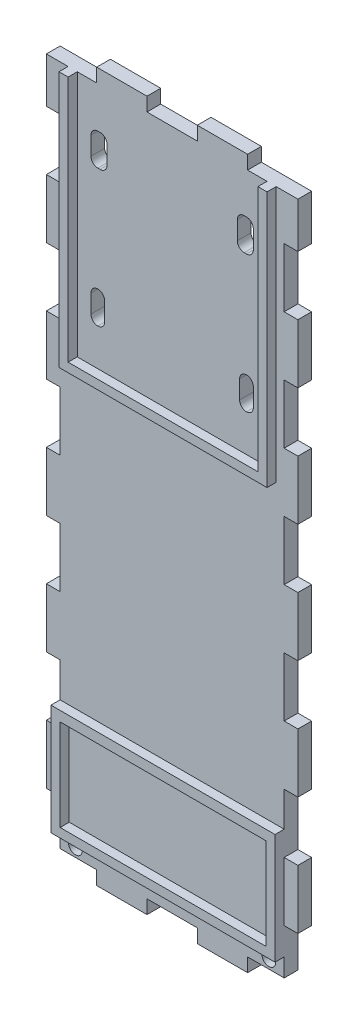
ISO-10303-21;
HEADER;
FILE_DESCRIPTION(('STEP AP214'),'2;1');
FILE_NAME('part.step','',(''),(''),'','','');
FILE_SCHEMA(('AUTOMOTIVE_DESIGN { 1 0 10303 214 1 1 1 1 }'));
ENDSEC;
DATA;
#1=APPLICATION_CONTEXT('core data for automotive mechanical design processes');
#2=APPLICATION_PROTOCOL_DEFINITION('international standard','automotive_design',2000,#1);
#3=PRODUCT_CONTEXT('',#1,'mechanical');
#4=PRODUCT('Part','Part','',(#3));
#5=PRODUCT_RELATED_PRODUCT_CATEGORY('part','',(#4));
#6=PRODUCT_DEFINITION_FORMATION('','',#4);
#7=PRODUCT_DEFINITION_CONTEXT('part definition',#1,'design');
#8=PRODUCT_DEFINITION('design','',#6,#7);
#9=PRODUCT_DEFINITION_SHAPE('','',#8);
#10=(LENGTH_UNIT() NAMED_UNIT(*) SI_UNIT(.MILLI.,.METRE.));
#11=(NAMED_UNIT(*) PLANE_ANGLE_UNIT() SI_UNIT($,.RADIAN.));
#12=(NAMED_UNIT(*) SI_UNIT($,.STERADIAN.) SOLID_ANGLE_UNIT());
#13=UNCERTAINTY_MEASURE_WITH_UNIT(LENGTH_MEASURE(1.E-05),#10,'distance_accuracy_value','');
#14=(GEOMETRIC_REPRESENTATION_CONTEXT(3) GLOBAL_UNCERTAINTY_ASSIGNED_CONTEXT((#13)) GLOBAL_UNIT_ASSIGNED_CONTEXT((#10,
#11,#12)) REPRESENTATION_CONTEXT('',''));
#15=CARTESIAN_POINT('',(0.,0.,0.));
#16=DIRECTION('',(0.,0.,1.));
#17=DIRECTION('',(1.,0.,0.));
#18=AXIS2_PLACEMENT_3D('',#15,#16,#17);
#19=CARTESIAN_POINT('',(0.,0.,3.));
#20=DIRECTION('',(0.,0.,1.));
#21=DIRECTION('',(1.,0.,0.));
#22=AXIS2_PLACEMENT_3D('',#19,#20,#21);
#23=PLANE('',#22);
#24=DIRECTION('',(1.,0.,0.));
#25=VECTOR('',#24,1.);
#26=CARTESIAN_POINT('',(0.,-64.5833333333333,3.));
#27=LINE('',#26,#25);
#28=CARTESIAN_POINT('',(-27.5,-64.5833333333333,3.));
#29=VERTEX_POINT('',#28);
#30=CARTESIAN_POINT('',(-24.5,-64.5833333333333,3.));
#31=VERTEX_POINT('',#30);
#32=EDGE_CURVE('E1083',#29,#31,#27,.T.);
#33=ORIENTED_EDGE('',*,*,#32,.T.);
#34=DIRECTION('',(0.,-1.,0.));
#35=VECTOR('',#34,1.);
#36=CARTESIAN_POINT('',(-24.5,-48.5,3.));
#37=LINE('',#36,#35);
#38=CARTESIAN_POINT('',(-24.5,-51.6666666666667,3.));
#39=VERTEX_POINT('',#38);
#40=EDGE_CURVE('E1721',#39,#31,#37,.T.);
#41=ORIENTED_EDGE('',*,*,#40,.F.);
#42=DIRECTION('',(-1.,0.,0.));
#43=VECTOR('',#42,1.);
#44=CARTESIAN_POINT('',(0.,-51.6666666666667,3.));
#45=LINE('',#44,#43);
#46=CARTESIAN_POINT('',(-27.5,-51.6666666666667,3.));
#47=VERTEX_POINT('',#46);
#48=EDGE_CURVE('E1037',#39,#47,#45,.T.);
#49=ORIENTED_EDGE('',*,*,#48,.T.);
#50=DIRECTION('',(0.,-1.,0.));
#51=VECTOR('',#50,1.);
#52=CARTESIAN_POINT('',(-27.5,77.5,3.));
#53=LINE('',#52,#51);
#54=EDGE_CURVE('E1274',#47,#29,#53,.T.);
#55=ORIENTED_EDGE('',*,*,#54,.T.);
#56=EDGE_LOOP('',(#33,#41,#49,#55));
#57=FACE_BOUND('',#56,.T.);
#58=ADVANCED_FACE('F38',(#57),#23,.T.);
#59=CARTESIAN_POINT('',(21.147444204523,-72.5000000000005,3.));
#60=DIRECTION('',(0.,0.,1.));
#61=DIRECTION('',(-1.,0.,0.));
#62=AXIS2_PLACEMENT_3D('',#59,#60,#61);
#63=CIRCLE('',#62,1.5);
#64=CARTESIAN_POINT('',(19.647444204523,-72.5000000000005,3.));
#65=VERTEX_POINT('',#64);
#66=EDGE_CURVE('E1776',#65,#65,#63,.T.);
#67=ORIENTED_EDGE('',*,*,#66,.F.);
#68=EDGE_LOOP('',(#67));
#69=FACE_BOUND('',#68,.T.);
#70=CARTESIAN_POINT('',(-21.147444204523,-72.5,3.));
#71=DIRECTION('',(0.,0.,1.));
#72=DIRECTION('',(1.,0.,0.));
#73=AXIS2_PLACEMENT_3D('',#70,#71,#72);
#74=CIRCLE('',#73,1.5);
#75=CARTESIAN_POINT('',(-19.647444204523,-72.5,3.));
#76=VERTEX_POINT('',#75);
#77=EDGE_CURVE('E1738',#76,#76,#74,.T.);
#78=ORIENTED_EDGE('',*,*,#77,.F.);
#79=EDGE_LOOP('',(#78));
#80=FACE_BOUND('',#79,.T.);
#81=DIRECTION('',(0.,-1.,0.));
#82=VECTOR('',#81,1.);
#83=CARTESIAN_POINT('',(24.5000000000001,0.,3.));
#84=LINE('',#83,#82);
#85=CARTESIAN_POINT('',(24.5000000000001,-70.5,3.));
#86=VERTEX_POINT('',#85);
#87=CARTESIAN_POINT('',(24.5000000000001,-74.5,3.));
#88=VERTEX_POINT('',#87);
#89=EDGE_CURVE('E1098',#86,#88,#84,.T.);
#90=ORIENTED_EDGE('',*,*,#89,.F.);
#91=DIRECTION('',(1.,0.,0.));
#92=VECTOR('',#91,1.);
#93=CARTESIAN_POINT('',(-24.5,-70.5,3.));
#94=LINE('',#93,#92);
#95=CARTESIAN_POINT('',(-24.5,-70.5,3.));
#96=VERTEX_POINT('',#95);
#97=EDGE_CURVE('E1732',#96,#86,#94,.T.);
#98=ORIENTED_EDGE('',*,*,#97,.F.);
#99=DIRECTION('',(0.,-1.,0.));
#100=VECTOR('',#99,1.);
#101=CARTESIAN_POINT('',(-24.5,0.,3.));
#102=LINE('',#101,#100);
#103=CARTESIAN_POINT('',(-24.5,-74.5,3.));
#104=VERTEX_POINT('',#103);
#105=EDGE_CURVE('E732',#96,#104,#102,.T.);
#106=ORIENTED_EDGE('',*,*,#105,.T.);
#107=DIRECTION('',(1.,0.,0.));
#108=VECTOR('',#107,1.);
#109=CARTESIAN_POINT('',(0.,-74.5,3.));
#110=LINE('',#109,#108);
#111=CARTESIAN_POINT('',(-16.5,-74.5,3.));
#112=VERTEX_POINT('',#111);
#113=EDGE_CURVE('E925',#104,#112,#110,.T.);
#114=ORIENTED_EDGE('',*,*,#113,.T.);
#115=DIRECTION('',(0.,-1.,0.));
#116=VECTOR('',#115,1.);
#117=CARTESIAN_POINT('',(-16.5,0.,3.));
#118=LINE('',#117,#116);
#119=CARTESIAN_POINT('',(-16.5,-77.5,3.));
#120=VERTEX_POINT('',#119);
#121=EDGE_CURVE('E946',#112,#120,#118,.T.);
#122=ORIENTED_EDGE('',*,*,#121,.T.);
#123=DIRECTION('',(1.,0.,0.));
#124=VECTOR('',#123,1.);
#125=CARTESIAN_POINT('',(-27.5,-77.5,3.));
#126=LINE('',#125,#124);
#127=CARTESIAN_POINT('',(-5.50000000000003,-77.5,3.));
#128=VERTEX_POINT('',#127);
#129=EDGE_CURVE('E1277',#120,#128,#126,.T.);
#130=ORIENTED_EDGE('',*,*,#129,.T.);
#131=DIRECTION('',(0.,1.,0.));
#132=VECTOR('',#131,1.);
#133=CARTESIAN_POINT('',(-5.50000000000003,0.,3.));
#134=LINE('',#133,#132);
#135=CARTESIAN_POINT('',(-5.50000000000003,-74.5,3.));
#136=VERTEX_POINT('',#135);
#137=EDGE_CURVE('E905',#128,#136,#134,.T.);
#138=ORIENTED_EDGE('',*,*,#137,.T.);
#139=DIRECTION('',(1.,0.,0.));
#140=VECTOR('',#139,1.);
#141=CARTESIAN_POINT('',(0.,-74.5,3.));
#142=LINE('',#141,#140);
#143=CARTESIAN_POINT('',(5.49999999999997,-74.5,3.));
#144=VERTEX_POINT('',#143);
#145=EDGE_CURVE('E926',#136,#144,#142,.T.);
#146=ORIENTED_EDGE('',*,*,#145,.T.);
#147=DIRECTION('',(0.,-1.,0.));
#148=VECTOR('',#147,1.);
#149=CARTESIAN_POINT('',(5.49999999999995,0.,3.));
#150=LINE('',#149,#148);
#151=CARTESIAN_POINT('',(5.49999999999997,-77.5,3.));
#152=VERTEX_POINT('',#151);
#153=EDGE_CURVE('E929',#144,#152,#150,.T.);
#154=ORIENTED_EDGE('',*,*,#153,.T.);
#155=CARTESIAN_POINT('',(16.5,-77.5,3.));
#156=VERTEX_POINT('',#155);
#157=EDGE_CURVE('E1272',#152,#156,#126,.T.);
#158=ORIENTED_EDGE('',*,*,#157,.T.);
#159=DIRECTION('',(0.,1.,0.));
#160=VECTOR('',#159,1.);
#161=CARTESIAN_POINT('',(16.5,0.,3.));
#162=LINE('',#161,#160);
#163=CARTESIAN_POINT('',(16.5,-74.5,3.));
#164=VERTEX_POINT('',#163);
#165=EDGE_CURVE('E879',#156,#164,#162,.T.);
#166=ORIENTED_EDGE('',*,*,#165,.T.);
#167=DIRECTION('',(1.,0.,0.));
#168=VECTOR('',#167,1.);
#169=CARTESIAN_POINT('',(0.,-74.5,3.));
#170=LINE('',#169,#168);
#171=EDGE_CURVE('E906',#164,#88,#170,.T.);
#172=ORIENTED_EDGE('',*,*,#171,.T.);
#173=EDGE_LOOP('',(#90,#98,#106,#114,#122,#130,#138,#146,#154,#158,#166,#172));
#174=FACE_BOUND('',#173,.T.);
#175=ADVANCED_FACE('F1546',(#69,#80,#174),#23,.T.);
#176=DIRECTION('',(1.,0.,0.));
#177=VECTOR('',#176,1.);
#178=CARTESIAN_POINT('',(0.,-51.6666666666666,3.));
#179=LINE('',#178,#177);
#180=CARTESIAN_POINT('',(24.5000000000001,-51.6666666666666,3.));
#181=VERTEX_POINT('',#180);
#182=CARTESIAN_POINT('',(27.5,-51.6666666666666,3.));
#183=VERTEX_POINT('',#182);
#184=EDGE_CURVE('E1119',#181,#183,#179,.T.);
#185=ORIENTED_EDGE('',*,*,#184,.F.);
#186=DIRECTION('',(0.,1.,0.));
#187=VECTOR('',#186,1.);
#188=CARTESIAN_POINT('',(24.5000000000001,-48.5,3.));
#189=LINE('',#188,#187);
#190=CARTESIAN_POINT('',(24.5000000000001,-64.5833333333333,3.));
#191=VERTEX_POINT('',#190);
#192=EDGE_CURVE('E1735',#191,#181,#189,.T.);
#193=ORIENTED_EDGE('',*,*,#192,.F.);
#194=DIRECTION('',(-1.,0.,0.));
#195=VECTOR('',#194,1.);
#196=CARTESIAN_POINT('',(0.,-64.5833333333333,3.));
#197=LINE('',#196,#195);
#198=CARTESIAN_POINT('',(27.5,-64.5833333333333,3.));
#199=VERTEX_POINT('',#198);
#200=EDGE_CURVE('E1082',#199,#191,#197,.T.);
#201=ORIENTED_EDGE('',*,*,#200,.F.);
#202=DIRECTION('',(0.,1.,0.));
#203=VECTOR('',#202,1.);
#204=CARTESIAN_POINT('',(27.5,77.5,3.));
#205=LINE('',#204,#203);
#206=EDGE_CURVE('E1266',#199,#183,#205,.T.);
#207=ORIENTED_EDGE('',*,*,#206,.T.);
#208=EDGE_LOOP('',(#185,#193,#201,#207));
#209=FACE_BOUND('',#208,.T.);
#210=ADVANCED_FACE('F1551',(#209),#23,.T.);
#211=DIRECTION('',(-1.,0.,0.));
#212=VECTOR('',#211,1.);
#213=CARTESIAN_POINT('',(-22.5,-68.5,3.));
#214=LINE('',#213,#212);
#215=CARTESIAN_POINT('',(22.5,-68.5,3.));
#216=VERTEX_POINT('',#215);
#217=CARTESIAN_POINT('',(-22.5,-68.5,3.));
#218=VERTEX_POINT('',#217);
#219=EDGE_CURVE('E1747',#216,#218,#214,.T.);
#220=ORIENTED_EDGE('',*,*,#219,.F.);
#221=DIRECTION('',(0.,-1.,0.));
#222=VECTOR('',#221,1.);
#223=CARTESIAN_POINT('',(22.5,-48.5,3.));
#224=LINE('',#223,#222);
#225=CARTESIAN_POINT('',(22.5,-48.5,3.));
#226=VERTEX_POINT('',#225);
#227=EDGE_CURVE('E1745',#226,#216,#224,.T.);
#228=ORIENTED_EDGE('',*,*,#227,.F.);
#229=DIRECTION('',(1.,0.,0.));
#230=VECTOR('',#229,1.);
#231=CARTESIAN_POINT('',(-24.5,-48.5,3.));
#232=LINE('',#231,#230);
#233=CARTESIAN_POINT('',(-22.5,-48.5,3.));
#234=VERTEX_POINT('',#233);
#235=EDGE_CURVE('E776',#234,#226,#232,.T.);
#236=ORIENTED_EDGE('',*,*,#235,.F.);
#237=DIRECTION('',(0.,1.,0.));
#238=VECTOR('',#237,1.);
#239=CARTESIAN_POINT('',(-22.5,-48.5,3.));
#240=LINE('',#239,#238);
#241=EDGE_CURVE('E726',#218,#234,#240,.T.);
#242=ORIENTED_EDGE('',*,*,#241,.F.);
#243=EDGE_LOOP('',(#220,#228,#236,#242));
#244=FACE_BOUND('',#243,.T.);
#245=ADVANCED_FACE('F1488',(#244),#23,.T.);
#246=CARTESIAN_POINT('',(-24.5,-48.5,5.));
#247=DIRECTION('',(0.,1.,0.));
#248=DIRECTION('',(0.,0.,1.));
#249=AXIS2_PLACEMENT_3D('',#246,#247,#248);
#250=PLANE('',#249);
#251=DIRECTION('',(0.,0.,-1.));
#252=VECTOR('',#251,1.);
#253=CARTESIAN_POINT('',(22.5,-48.5,5.));
#254=LINE('',#253,#252);
#255=CARTESIAN_POINT('',(22.5,-48.5,5.));
#256=VERTEX_POINT('',#255);
#257=EDGE_CURVE('E736',#256,#226,#254,.T.);
#258=ORIENTED_EDGE('',*,*,#257,.F.);
#259=DIRECTION('',(1.,0.,0.));
#260=VECTOR('',#259,1.);
#261=CARTESIAN_POINT('',(-24.5,-48.5,5.));
#262=LINE('',#261,#260);
#263=CARTESIAN_POINT('',(-22.5,-48.5,5.));
#264=VERTEX_POINT('',#263);
#265=EDGE_CURVE('E716',#264,#256,#262,.T.);
#266=ORIENTED_EDGE('',*,*,#265,.F.);
#267=DIRECTION('',(0.,0.,-1.));
#268=VECTOR('',#267,1.);
#269=CARTESIAN_POINT('',(-22.5,-48.5,5.));
#270=LINE('',#269,#268);
#271=EDGE_CURVE('E55',#264,#234,#270,.T.);
#272=ORIENTED_EDGE('',*,*,#271,.T.);
#273=ORIENTED_EDGE('',*,*,#235,.T.);
#274=EDGE_LOOP('',(#258,#266,#272,#273));
#275=FACE_BOUND('',#274,.T.);
#276=ADVANCED_FACE('F1485',(#275),#250,.F.);
#277=DIRECTION('',(0.,-1.,0.));
#278=VECTOR('',#277,1.);
#279=CARTESIAN_POINT('',(14.7506979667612,35.6,3.));
#280=LINE('',#279,#278);
#281=CARTESIAN_POINT('',(14.7506979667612,34.1,3.));
#282=VERTEX_POINT('',#281);
#283=CARTESIAN_POINT('',(14.7506979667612,30.1,3.));
#284=VERTEX_POINT('',#283);
#285=EDGE_CURVE('E757',#282,#284,#280,.T.);
#286=ORIENTED_EDGE('',*,*,#285,.F.);
#287=CARTESIAN_POINT('',(16.2506979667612,34.1,3.));
#288=DIRECTION('',(0.,0.,1.));
#289=DIRECTION('',(1.,0.,0.));
#290=AXIS2_PLACEMENT_3D('',#287,#288,#289);
#291=CIRCLE('',#290,1.5);
#292=CARTESIAN_POINT('',(16.2506979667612,35.6,3.));
#293=VERTEX_POINT('',#292);
#294=EDGE_CURVE('E1415',#282,#293,#291,.F.);
#295=ORIENTED_EDGE('',*,*,#294,.T.);
#296=CARTESIAN_POINT('',(16.2506979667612,34.1,3.));
#297=DIRECTION('',(0.,0.,1.));
#298=DIRECTION('',(1.,0.,0.));
#299=AXIS2_PLACEMENT_3D('',#296,#297,#298);
#300=CIRCLE('',#299,1.5);
#301=CARTESIAN_POINT('',(17.7506979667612,34.1,3.));
#302=VERTEX_POINT('',#301);
#303=EDGE_CURVE('E1412',#293,#302,#300,.F.);
#304=ORIENTED_EDGE('',*,*,#303,.T.);
#305=DIRECTION('',(0.,-1.,0.));
#306=VECTOR('',#305,1.);
#307=CARTESIAN_POINT('',(17.7506979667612,35.6000000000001,3.));
#308=LINE('',#307,#306);
#309=CARTESIAN_POINT('',(17.7506979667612,30.1,3.));
#310=VERTEX_POINT('',#309);
#311=EDGE_CURVE('E760',#302,#310,#308,.T.);
#312=ORIENTED_EDGE('',*,*,#311,.T.);
#313=CARTESIAN_POINT('',(16.2506979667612,30.1,3.));
#314=DIRECTION('',(0.,0.,1.));
#315=DIRECTION('',(1.,0.,0.));
#316=AXIS2_PLACEMENT_3D('',#313,#314,#315);
#317=CIRCLE('',#316,1.5);
#318=CARTESIAN_POINT('',(16.2506979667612,28.6,3.));
#319=VERTEX_POINT('',#318);
#320=EDGE_CURVE('E1408',#310,#319,#317,.F.);
#321=ORIENTED_EDGE('',*,*,#320,.T.);
#322=CARTESIAN_POINT('',(16.2506979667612,30.1,3.));
#323=DIRECTION('',(0.,0.,1.));
#324=DIRECTION('',(1.,0.,0.));
#325=AXIS2_PLACEMENT_3D('',#322,#323,#324);
#326=CIRCLE('',#325,1.5);
#327=EDGE_CURVE('E1404',#319,#284,#326,.F.);
#328=ORIENTED_EDGE('',*,*,#327,.T.);
#329=EDGE_LOOP('',(#286,#295,#304,#312,#321,#328));
#330=FACE_BOUND('',#329,.T.);
#331=DIRECTION('',(1.,0.,0.));
#332=VECTOR('',#331,1.);
#333=CARTESIAN_POINT('',(0.,20.5,3.));
#334=LINE('',#333,#332);
#335=CARTESIAN_POINT('',(-20.75,20.5,3.));
#336=VERTEX_POINT('',#335);
#337=CARTESIAN_POINT('',(20.75,20.5,3.));
#338=VERTEX_POINT('',#337);
#339=EDGE_CURVE('E819',#336,#338,#334,.T.);
#340=ORIENTED_EDGE('',*,*,#339,.T.);
#341=DIRECTION('',(0.,-1.,0.));
#342=VECTOR('',#341,1.);
#343=CARTESIAN_POINT('',(20.75,0.,3.));
#344=LINE('',#343,#342);
#345=CARTESIAN_POINT('',(20.75,74.5,3.));
#346=VERTEX_POINT('',#345);
#347=EDGE_CURVE('E816',#346,#338,#344,.T.);
#348=ORIENTED_EDGE('',*,*,#347,.F.);
#349=DIRECTION('',(1.,0.,0.));
#350=VECTOR('',#349,1.);
#351=CARTESIAN_POINT('',(0.,74.5,3.));
#352=LINE('',#351,#350);
#353=CARTESIAN_POINT('',(16.5,74.5,3.));
#354=VERTEX_POINT('',#353);
#355=EDGE_CURVE('E856',#354,#346,#352,.T.);
#356=ORIENTED_EDGE('',*,*,#355,.F.);
#357=DIRECTION('',(0.,-1.,0.));
#358=VECTOR('',#357,1.);
#359=CARTESIAN_POINT('',(16.5,0.,3.));
#360=LINE('',#359,#358);
#361=CARTESIAN_POINT('',(16.5,77.5,3.));
#362=VERTEX_POINT('',#361);
#363=EDGE_CURVE('E859',#362,#354,#360,.T.);
#364=ORIENTED_EDGE('',*,*,#363,.F.);
#365=DIRECTION('',(-1.,0.,0.));
#366=VECTOR('',#365,1.);
#367=CARTESIAN_POINT('',(-27.5,77.5,3.));
#368=LINE('',#367,#366);
#369=CARTESIAN_POINT('',(5.49999999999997,77.5,3.));
#370=VERTEX_POINT('',#369);
#371=EDGE_CURVE('E1269',#362,#370,#368,.T.);
#372=ORIENTED_EDGE('',*,*,#371,.T.);
#373=DIRECTION('',(0.,1.,0.));
#374=VECTOR('',#373,1.);
#375=CARTESIAN_POINT('',(5.49999999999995,0.,3.));
#376=LINE('',#375,#374);
#377=CARTESIAN_POINT('',(5.49999999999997,74.5,3.));
#378=VERTEX_POINT('',#377);
#379=EDGE_CURVE('E883',#378,#370,#376,.T.);
#380=ORIENTED_EDGE('',*,*,#379,.F.);
#381=DIRECTION('',(1.,0.,0.));
#382=VECTOR('',#381,1.);
#383=CARTESIAN_POINT('',(0.,74.5,3.));
#384=LINE('',#383,#382);
#385=CARTESIAN_POINT('',(-5.50000000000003,74.5,3.));
#386=VERTEX_POINT('',#385);
#387=EDGE_CURVE('E855',#386,#378,#384,.T.);
#388=ORIENTED_EDGE('',*,*,#387,.F.);
#389=DIRECTION('',(0.,-1.,0.));
#390=VECTOR('',#389,1.);
#391=CARTESIAN_POINT('',(-5.50000000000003,0.,3.));
#392=LINE('',#391,#390);
#393=CARTESIAN_POINT('',(-5.50000000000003,77.5,3.));
#394=VERTEX_POINT('',#393);
#395=EDGE_CURVE('E880',#394,#386,#392,.T.);
#396=ORIENTED_EDGE('',*,*,#395,.F.);
#397=CARTESIAN_POINT('',(-16.5,77.5,3.));
#398=VERTEX_POINT('',#397);
#399=EDGE_CURVE('E1267',#394,#398,#368,.T.);
#400=ORIENTED_EDGE('',*,*,#399,.T.);
#401=DIRECTION('',(0.,1.,0.));
#402=VECTOR('',#401,1.);
#403=CARTESIAN_POINT('',(-16.5,0.,3.));
#404=LINE('',#403,#402);
#405=CARTESIAN_POINT('',(-16.5,74.5,3.));
#406=VERTEX_POINT('',#405);
#407=EDGE_CURVE('E958',#406,#398,#404,.T.);
#408=ORIENTED_EDGE('',*,*,#407,.F.);
#409=DIRECTION('',(1.,0.,0.));
#410=VECTOR('',#409,1.);
#411=CARTESIAN_POINT('',(0.,74.5,3.));
#412=LINE('',#411,#410);
#413=CARTESIAN_POINT('',(-20.75,74.5,3.));
#414=VERTEX_POINT('',#413);
#415=EDGE_CURVE('E863',#414,#406,#412,.T.);
#416=ORIENTED_EDGE('',*,*,#415,.F.);
#417=DIRECTION('',(0.,-1.,0.));
#418=VECTOR('',#417,1.);
#419=CARTESIAN_POINT('',(-20.75,0.,3.));
#420=LINE('',#419,#418);
#421=EDGE_CURVE('E822',#414,#336,#420,.T.);
#422=ORIENTED_EDGE('',*,*,#421,.T.);
#423=EDGE_LOOP('',(#340,#348,#356,#364,#372,#380,#388,#396,#400,#408,#416,#422));
#424=FACE_BOUND('',#423,.T.);
#425=DIRECTION('',(0.,-1.,0.));
#426=VECTOR('',#425,1.);
#427=CARTESIAN_POINT('',(-17.7506979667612,0.,3.));
#428=LINE('',#427,#426);
#429=CARTESIAN_POINT('',(-17.7506979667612,64.,3.));
#430=VERTEX_POINT('',#429);
#431=CARTESIAN_POINT('',(-17.7506979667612,60.,3.));
#432=VERTEX_POINT('',#431);
#433=EDGE_CURVE('E771',#430,#432,#428,.T.);
#434=ORIENTED_EDGE('',*,*,#433,.F.);
#435=CARTESIAN_POINT('',(-16.2506979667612,64.,3.));
#436=DIRECTION('',(0.,0.,1.));
#437=DIRECTION('',(1.,0.,0.));
#438=AXIS2_PLACEMENT_3D('',#435,#436,#437);
#439=CIRCLE('',#438,1.5);
#440=CARTESIAN_POINT('',(-16.2506979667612,65.5,3.));
#441=VERTEX_POINT('',#440);
#442=EDGE_CURVE('E1435',#430,#441,#439,.F.);
#443=ORIENTED_EDGE('',*,*,#442,.T.);
#444=DIRECTION('',(1.,0.,0.));
#445=VECTOR('',#444,1.);
#446=CARTESIAN_POINT('',(0.,65.5,3.));
#447=LINE('',#446,#445);
#448=CARTESIAN_POINT('',(-15.7506979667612,65.5,3.));
#449=VERTEX_POINT('',#448);
#450=EDGE_CURVE('E768',#441,#449,#447,.T.);
#451=ORIENTED_EDGE('',*,*,#450,.T.);
#452=CARTESIAN_POINT('',(-15.7506979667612,64.,3.));
#453=DIRECTION('',(0.,0.,1.));
#454=DIRECTION('',(1.,0.,0.));
#455=AXIS2_PLACEMENT_3D('',#452,#453,#454);
#456=CIRCLE('',#455,1.5);
#457=CARTESIAN_POINT('',(-14.2506979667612,64.,3.));
#458=VERTEX_POINT('',#457);
#459=EDGE_CURVE('E1443',#449,#458,#456,.F.);
#460=ORIENTED_EDGE('',*,*,#459,.T.);
#461=DIRECTION('',(0.,-1.,0.));
#462=VECTOR('',#461,1.);
#463=CARTESIAN_POINT('',(-14.2506979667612,0.,3.));
#464=LINE('',#463,#462);
#465=CARTESIAN_POINT('',(-14.2506979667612,60.,3.));
#466=VERTEX_POINT('',#465);
#467=EDGE_CURVE('E753',#458,#466,#464,.T.);
#468=ORIENTED_EDGE('',*,*,#467,.T.);
#469=CARTESIAN_POINT('',(-15.7506979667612,60.,3.));
#470=DIRECTION('',(0.,0.,1.));
#471=DIRECTION('',(1.,0.,0.));
#472=AXIS2_PLACEMENT_3D('',#469,#470,#471);
#473=CIRCLE('',#472,1.5);
#474=CARTESIAN_POINT('',(-15.7506979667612,58.5,3.));
#475=VERTEX_POINT('',#474);
#476=EDGE_CURVE('E1439',#466,#475,#473,.F.);
#477=ORIENTED_EDGE('',*,*,#476,.T.);
#478=DIRECTION('',(1.,0.,0.));
#479=VECTOR('',#478,1.);
#480=CARTESIAN_POINT('',(0.,58.5,3.));
#481=LINE('',#480,#479);
#482=CARTESIAN_POINT('',(-16.2506979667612,58.5,3.));
#483=VERTEX_POINT('',#482);
#484=EDGE_CURVE('E774',#483,#475,#481,.T.);
#485=ORIENTED_EDGE('',*,*,#484,.F.);
#486=CARTESIAN_POINT('',(-16.2506979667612,60.,3.));
#487=DIRECTION('',(0.,0.,1.));
#488=DIRECTION('',(1.,0.,0.));
#489=AXIS2_PLACEMENT_3D('',#486,#487,#488);
#490=CIRCLE('',#489,1.5);
#491=EDGE_CURVE('E47',#483,#432,#490,.F.);
#492=ORIENTED_EDGE('',*,*,#491,.T.);
#493=EDGE_LOOP('',(#434,#443,#451,#460,#468,#477,#485,#492));
#494=FACE_BOUND('',#493,.T.);
#495=DIRECTION('',(0.,-1.,0.));
#496=VECTOR('',#495,1.);
#497=CARTESIAN_POINT('',(-17.7506979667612,35.6,3.));
#498=LINE('',#497,#496);
#499=CARTESIAN_POINT('',(-17.7506979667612,34.1,3.));
#500=VERTEX_POINT('',#499);
#501=CARTESIAN_POINT('',(-17.7506979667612,30.1,3.));
#502=VERTEX_POINT('',#501);
#503=EDGE_CURVE('E754',#500,#502,#498,.T.);
#504=ORIENTED_EDGE('',*,*,#503,.F.);
#505=CARTESIAN_POINT('',(-16.2506979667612,34.1,3.));
#506=DIRECTION('',(0.,0.,1.));
#507=DIRECTION('',(1.,0.,0.));
#508=AXIS2_PLACEMENT_3D('',#505,#506,#507);
#509=CIRCLE('',#508,1.5);
#510=CARTESIAN_POINT('',(-16.2506979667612,35.6,3.));
#511=VERTEX_POINT('',#510);
#512=EDGE_CURVE('E1396',#500,#511,#509,.F.);
#513=ORIENTED_EDGE('',*,*,#512,.T.);
#514=CARTESIAN_POINT('',(-16.2506979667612,34.1,3.));
#515=DIRECTION('',(0.,0.,1.));
#516=DIRECTION('',(1.,0.,0.));
#517=AXIS2_PLACEMENT_3D('',#514,#515,#516);
#518=CIRCLE('',#517,1.5);
#519=CARTESIAN_POINT('',(-14.7506979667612,34.1,3.));
#520=VERTEX_POINT('',#519);
#521=EDGE_CURVE('E1392',#511,#520,#518,.F.);
#522=ORIENTED_EDGE('',*,*,#521,.T.);
#523=DIRECTION('',(0.,-1.,0.));
#524=VECTOR('',#523,1.);
#525=CARTESIAN_POINT('',(-14.7506979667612,35.6,3.));
#526=LINE('',#525,#524);
#527=CARTESIAN_POINT('',(-14.7506979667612,30.1,3.));
#528=VERTEX_POINT('',#527);
#529=EDGE_CURVE('E744',#520,#528,#526,.T.);
#530=ORIENTED_EDGE('',*,*,#529,.T.);
#531=CARTESIAN_POINT('',(-16.2506979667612,30.1,3.));
#532=DIRECTION('',(0.,0.,1.));
#533=DIRECTION('',(1.,0.,0.));
#534=AXIS2_PLACEMENT_3D('',#531,#532,#533);
#535=CIRCLE('',#534,1.5);
#536=CARTESIAN_POINT('',(-16.2506979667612,28.6,3.));
#537=VERTEX_POINT('',#536);
#538=EDGE_CURVE('E1400',#528,#537,#535,.F.);
#539=ORIENTED_EDGE('',*,*,#538,.T.);
#540=CARTESIAN_POINT('',(-16.2506979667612,30.1,3.));
#541=DIRECTION('',(0.,0.,1.));
#542=DIRECTION('',(1.,0.,0.));
#543=AXIS2_PLACEMENT_3D('',#540,#541,#542);
#544=CIRCLE('',#543,1.5);
#545=EDGE_CURVE('E1388',#537,#502,#544,.F.);
#546=ORIENTED_EDGE('',*,*,#545,.T.);
#547=EDGE_LOOP('',(#504,#513,#522,#530,#539,#546));
#548=FACE_BOUND('',#547,.T.);
#549=DIRECTION('',(-1.,0.,0.));
#550=VECTOR('',#549,1.);
#551=CARTESIAN_POINT('',(0.,65.5,3.));
#552=LINE('',#551,#550);
#553=CARTESIAN_POINT('',(16.2506979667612,65.5,3.));
#554=VERTEX_POINT('',#553);
#555=CARTESIAN_POINT('',(15.7506979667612,65.5,3.));
#556=VERTEX_POINT('',#555);
#557=EDGE_CURVE('E747',#554,#556,#552,.T.);
#558=ORIENTED_EDGE('',*,*,#557,.F.);
#559=CARTESIAN_POINT('',(16.2506979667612,64.,3.));
#560=DIRECTION('',(0.,0.,1.));
#561=DIRECTION('',(1.,0.,0.));
#562=AXIS2_PLACEMENT_3D('',#559,#560,#561);
#563=CIRCLE('',#562,1.5);
#564=CARTESIAN_POINT('',(17.7506979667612,64.,3.));
#565=VERTEX_POINT('',#564);
#566=EDGE_CURVE('E1431',#554,#565,#563,.F.);
#567=ORIENTED_EDGE('',*,*,#566,.T.);
#568=DIRECTION('',(0.,-1.,0.));
#569=VECTOR('',#568,1.);
#570=CARTESIAN_POINT('',(17.7506979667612,0.,3.));
#571=LINE('',#570,#569);
#572=CARTESIAN_POINT('',(17.7506979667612,60.,3.));
#573=VERTEX_POINT('',#572);
#574=EDGE_CURVE('E750',#565,#573,#571,.T.);
#575=ORIENTED_EDGE('',*,*,#574,.T.);
#576=CARTESIAN_POINT('',(16.2506979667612,60.,3.));
#577=DIRECTION('',(0.,0.,1.));
#578=DIRECTION('',(1.,0.,0.));
#579=AXIS2_PLACEMENT_3D('',#576,#577,#578);
#580=CIRCLE('',#579,1.5);
#581=CARTESIAN_POINT('',(16.2506979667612,58.5,3.));
#582=VERTEX_POINT('',#581);
#583=EDGE_CURVE('E1423',#573,#582,#580,.F.);
#584=ORIENTED_EDGE('',*,*,#583,.T.);
#585=DIRECTION('',(-1.,0.,0.));
#586=VECTOR('',#585,1.);
#587=CARTESIAN_POINT('',(0.,58.5,3.));
#588=LINE('',#587,#586);
#589=CARTESIAN_POINT('',(15.7506979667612,58.5,3.));
#590=VERTEX_POINT('',#589);
#591=EDGE_CURVE('E740',#582,#590,#588,.T.);
#592=ORIENTED_EDGE('',*,*,#591,.T.);
#593=CARTESIAN_POINT('',(15.7506979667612,60.,3.));
#594=DIRECTION('',(0.,0.,1.));
#595=DIRECTION('',(1.,0.,0.));
#596=AXIS2_PLACEMENT_3D('',#593,#594,#595);
#597=CIRCLE('',#596,1.5);
#598=CARTESIAN_POINT('',(14.2506979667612,60.,3.));
#599=VERTEX_POINT('',#598);
#600=EDGE_CURVE('E1419',#590,#599,#597,.F.);
#601=ORIENTED_EDGE('',*,*,#600,.T.);
#602=DIRECTION('',(0.,-1.,0.));
#603=VECTOR('',#602,1.);
#604=CARTESIAN_POINT('',(14.2506979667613,0.,3.));
#605=LINE('',#604,#603);
#606=CARTESIAN_POINT('',(14.2506979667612,64.,3.));
#607=VERTEX_POINT('',#606);
#608=EDGE_CURVE('E743',#607,#599,#605,.T.);
#609=ORIENTED_EDGE('',*,*,#608,.F.);
#610=CARTESIAN_POINT('',(15.7506979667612,64.,3.));
#611=DIRECTION('',(0.,0.,1.));
#612=DIRECTION('',(1.,0.,0.));
#613=AXIS2_PLACEMENT_3D('',#610,#611,#612);
#614=CIRCLE('',#613,1.5);
#615=EDGE_CURVE('E1427',#607,#556,#614,.F.);
#616=ORIENTED_EDGE('',*,*,#615,.T.);
#617=EDGE_LOOP('',(#558,#567,#575,#584,#592,#601,#609,#616));
#618=FACE_BOUND('',#617,.T.);
#619=ADVANCED_FACE('F1482',(#330,#424,#494,#548,#618),#23,.T.);
#620=CARTESIAN_POINT('',(0.,0.,0.));
#621=DIRECTION('',(0.,0.,1.));
#622=DIRECTION('',(1.,0.,0.));
#623=AXIS2_PLACEMENT_3D('',#620,#621,#622);
#624=PLANE('',#623);
#625=CARTESIAN_POINT('',(21.147444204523,-72.5000000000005,0.));
#626=DIRECTION('',(0.,0.,1.));
#627=DIRECTION('',(-1.,0.,0.));
#628=AXIS2_PLACEMENT_3D('',#625,#626,#627);
#629=CIRCLE('',#628,1.5);
#630=CARTESIAN_POINT('',(19.647444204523,-72.5000000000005,0.));
#631=VERTEX_POINT('',#630);
#632=EDGE_CURVE('E1774',#631,#631,#629,.T.);
#633=ORIENTED_EDGE('',*,*,#632,.T.);
#634=EDGE_LOOP('',(#633));
#635=FACE_BOUND('',#634,.T.);
#636=CARTESIAN_POINT('',(-21.147444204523,-72.5,0.));
#637=DIRECTION('',(0.,0.,1.));
#638=DIRECTION('',(1.,0.,0.));
#639=AXIS2_PLACEMENT_3D('',#636,#637,#638);
#640=CIRCLE('',#639,1.5);
#641=CARTESIAN_POINT('',(-19.647444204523,-72.5,0.));
#642=VERTEX_POINT('',#641);
#643=EDGE_CURVE('E1733',#642,#642,#640,.T.);
#644=ORIENTED_EDGE('',*,*,#643,.T.);
#645=EDGE_LOOP('',(#644));
#646=FACE_BOUND('',#645,.T.);
#647=CARTESIAN_POINT('',(-16.2506979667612,34.1,0.));
#648=DIRECTION('',(0.,0.,1.));
#649=DIRECTION('',(1.,0.,0.));
#650=AXIS2_PLACEMENT_3D('',#647,#648,#649);
#651=CIRCLE('',#650,1.5);
#652=CARTESIAN_POINT('',(-14.7506979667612,34.1,0.));
#653=VERTEX_POINT('',#652);
#654=CARTESIAN_POINT('',(-16.2506979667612,35.6,0.));
#655=VERTEX_POINT('',#654);
#656=EDGE_CURVE('E1394',#653,#655,#651,.T.);
#657=ORIENTED_EDGE('',*,*,#656,.T.);
#658=CARTESIAN_POINT('',(-16.2506979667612,34.1,0.));
#659=DIRECTION('',(0.,0.,1.));
#660=DIRECTION('',(1.,0.,0.));
#661=AXIS2_PLACEMENT_3D('',#658,#659,#660);
#662=CIRCLE('',#661,1.5);
#663=CARTESIAN_POINT('',(-17.7506979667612,34.1,0.));
#664=VERTEX_POINT('',#663);
#665=EDGE_CURVE('E1398',#655,#664,#662,.T.);
#666=ORIENTED_EDGE('',*,*,#665,.T.);
#667=DIRECTION('',(0.,-1.,0.));
#668=VECTOR('',#667,1.);
#669=CARTESIAN_POINT('',(-17.7506979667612,0.,0.));
#670=LINE('',#669,#668);
#671=CARTESIAN_POINT('',(-17.7506979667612,30.1,0.));
#672=VERTEX_POINT('',#671);
#673=EDGE_CURVE('E1310',#664,#672,#670,.T.);
#674=ORIENTED_EDGE('',*,*,#673,.T.);
#675=CARTESIAN_POINT('',(-16.2506979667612,30.1,0.));
#676=DIRECTION('',(0.,0.,1.));
#677=DIRECTION('',(1.,0.,0.));
#678=AXIS2_PLACEMENT_3D('',#675,#676,#677);
#679=CIRCLE('',#678,1.5);
#680=CARTESIAN_POINT('',(-16.2506979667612,28.6,0.));
#681=VERTEX_POINT('',#680);
#682=EDGE_CURVE('E1390',#672,#681,#679,.T.);
#683=ORIENTED_EDGE('',*,*,#682,.T.);
#684=CARTESIAN_POINT('',(-16.2506979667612,30.1,0.));
#685=DIRECTION('',(0.,0.,1.));
#686=DIRECTION('',(1.,0.,0.));
#687=AXIS2_PLACEMENT_3D('',#684,#685,#686);
#688=CIRCLE('',#687,1.5);
#689=CARTESIAN_POINT('',(-14.7506979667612,30.1,0.));
#690=VERTEX_POINT('',#689);
#691=EDGE_CURVE('E1402',#681,#690,#688,.T.);
#692=ORIENTED_EDGE('',*,*,#691,.T.);
#693=DIRECTION('',(0.,-1.,0.));
#694=VECTOR('',#693,1.);
#695=CARTESIAN_POINT('',(-14.7506979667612,0.,0.));
#696=LINE('',#695,#694);
#697=EDGE_CURVE('E1313',#653,#690,#696,.T.);
#698=ORIENTED_EDGE('',*,*,#697,.F.);
#699=EDGE_LOOP('',(#657,#666,#674,#683,#692,#698));
#700=FACE_BOUND('',#699,.T.);
#701=CARTESIAN_POINT('',(16.2506979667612,34.1,0.));
#702=DIRECTION('',(0.,0.,1.));
#703=DIRECTION('',(1.,0.,0.));
#704=AXIS2_PLACEMENT_3D('',#701,#702,#703);
#705=CIRCLE('',#704,1.5);
#706=CARTESIAN_POINT('',(17.7506979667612,34.1,0.));
#707=VERTEX_POINT('',#706);
#708=CARTESIAN_POINT('',(16.2506979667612,35.6,0.));
#709=VERTEX_POINT('',#708);
#710=EDGE_CURVE('E63',#707,#709,#705,.T.);
#711=ORIENTED_EDGE('',*,*,#710,.T.);
#712=CARTESIAN_POINT('',(16.2506979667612,34.1,0.));
#713=DIRECTION('',(0.,0.,1.));
#714=DIRECTION('',(1.,0.,0.));
#715=AXIS2_PLACEMENT_3D('',#712,#713,#714);
#716=CIRCLE('',#715,1.5);
#717=CARTESIAN_POINT('',(14.7506979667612,34.1,0.));
#718=VERTEX_POINT('',#717);
#719=EDGE_CURVE('E1417',#709,#718,#716,.T.);
#720=ORIENTED_EDGE('',*,*,#719,.T.);
#721=DIRECTION('',(0.,-1.,0.));
#722=VECTOR('',#721,1.);
#723=CARTESIAN_POINT('',(14.7506979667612,0.,0.));
#724=LINE('',#723,#722);
#725=CARTESIAN_POINT('',(14.7506979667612,30.1,0.));
#726=VERTEX_POINT('',#725);
#727=EDGE_CURVE('E1304',#718,#726,#724,.T.);
#728=ORIENTED_EDGE('',*,*,#727,.T.);
#729=CARTESIAN_POINT('',(16.2506979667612,30.1,0.));
#730=DIRECTION('',(0.,0.,1.));
#731=DIRECTION('',(1.,0.,0.));
#732=AXIS2_PLACEMENT_3D('',#729,#730,#731);
#733=CIRCLE('',#732,1.5);
#734=CARTESIAN_POINT('',(16.2506979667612,28.6,0.));
#735=VERTEX_POINT('',#734);
#736=EDGE_CURVE('E1406',#726,#735,#733,.T.);
#737=ORIENTED_EDGE('',*,*,#736,.T.);
#738=CARTESIAN_POINT('',(16.2506979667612,30.1,0.));
#739=DIRECTION('',(0.,0.,1.));
#740=DIRECTION('',(1.,0.,0.));
#741=AXIS2_PLACEMENT_3D('',#738,#739,#740);
#742=CIRCLE('',#741,1.5);
#743=CARTESIAN_POINT('',(17.7506979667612,30.1,0.));
#744=VERTEX_POINT('',#743);
#745=EDGE_CURVE('E1410',#735,#744,#742,.T.);
#746=ORIENTED_EDGE('',*,*,#745,.T.);
#747=DIRECTION('',(0.,-1.,0.));
#748=VECTOR('',#747,1.);
#749=CARTESIAN_POINT('',(17.7506979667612,0.,0.));
#750=LINE('',#749,#748);
#751=EDGE_CURVE('E1307',#707,#744,#750,.T.);
#752=ORIENTED_EDGE('',*,*,#751,.F.);
#753=EDGE_LOOP('',(#711,#720,#728,#737,#746,#752));
#754=FACE_BOUND('',#753,.T.);
#755=DIRECTION('',(-1.,0.,0.));
#756=VECTOR('',#755,1.);
#757=CARTESIAN_POINT('',(-27.5,77.5,0.));
#758=LINE('',#757,#756);
#759=CARTESIAN_POINT('',(16.5,77.5,0.));
#760=VERTEX_POINT('',#759);
#761=CARTESIAN_POINT('',(5.49999999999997,77.5,0.));
#762=VERTEX_POINT('',#761);
#763=EDGE_CURVE('E1284',#760,#762,#758,.T.);
#764=ORIENTED_EDGE('',*,*,#763,.F.);
#765=DIRECTION('',(0.,-1.,0.));
#766=VECTOR('',#765,1.);
#767=CARTESIAN_POINT('',(16.5,0.,0.));
#768=LINE('',#767,#766);
#769=CARTESIAN_POINT('',(16.5,74.5,0.));
#770=VERTEX_POINT('',#769);
#771=EDGE_CURVE('E866',#760,#770,#768,.T.);
#772=ORIENTED_EDGE('',*,*,#771,.T.);
#773=DIRECTION('',(1.,0.,0.));
#774=VECTOR('',#773,1.);
#775=CARTESIAN_POINT('',(0.,74.5,0.));
#776=LINE('',#775,#774);
#777=CARTESIAN_POINT('',(27.5,74.5,0.));
#778=VERTEX_POINT('',#777);
#779=EDGE_CURVE('E849',#770,#778,#776,.T.);
#780=ORIENTED_EDGE('',*,*,#779,.T.);
#781=DIRECTION('',(0.,1.,0.));
#782=VECTOR('',#781,1.);
#783=CARTESIAN_POINT('',(27.5,77.5,0.));
#784=LINE('',#783,#782);
#785=CARTESIAN_POINT('',(27.5,64.5833333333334,0.));
#786=VERTEX_POINT('',#785);
#787=EDGE_CURVE('E1254',#786,#778,#784,.T.);
#788=ORIENTED_EDGE('',*,*,#787,.F.);
#789=DIRECTION('',(-1.,0.,0.));
#790=VECTOR('',#789,1.);
#791=CARTESIAN_POINT('',(0.,64.5833333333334,0.));
#792=LINE('',#791,#790);
#793=CARTESIAN_POINT('',(24.5,64.5833333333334,0.));
#794=VERTEX_POINT('',#793);
#795=EDGE_CURVE('E1224',#786,#794,#792,.T.);
#796=ORIENTED_EDGE('',*,*,#795,.T.);
#797=DIRECTION('',(0.,-1.,0.));
#798=VECTOR('',#797,1.);
#799=CARTESIAN_POINT('',(24.5000000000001,0.,0.));
#800=LINE('',#799,#798);
#801=CARTESIAN_POINT('',(24.5,51.6666666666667,0.));
#802=VERTEX_POINT('',#801);
#803=EDGE_CURVE('E1231',#794,#802,#800,.T.);
#804=ORIENTED_EDGE('',*,*,#803,.T.);
#805=DIRECTION('',(1.,0.,0.));
#806=VECTOR('',#805,1.);
#807=CARTESIAN_POINT('',(0.,51.6666666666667,0.));
#808=LINE('',#807,#806);
#809=CARTESIAN_POINT('',(27.5,51.6666666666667,0.));
#810=VERTEX_POINT('',#809);
#811=EDGE_CURVE('E1214',#802,#810,#808,.T.);
#812=ORIENTED_EDGE('',*,*,#811,.T.);
#813=CARTESIAN_POINT('',(27.5,38.75,0.));
#814=VERTEX_POINT('',#813);
#815=EDGE_CURVE('E1280',#814,#810,#784,.T.);
#816=ORIENTED_EDGE('',*,*,#815,.F.);
#817=DIRECTION('',(-1.,0.,0.));
#818=VECTOR('',#817,1.);
#819=CARTESIAN_POINT('',(0.,38.75,0.));
#820=LINE('',#819,#818);
#821=CARTESIAN_POINT('',(24.5,38.75,0.));
#822=VERTEX_POINT('',#821);
#823=EDGE_CURVE('E1200',#814,#822,#820,.T.);
#824=ORIENTED_EDGE('',*,*,#823,.T.);
#825=DIRECTION('',(0.,-1.,0.));
#826=VECTOR('',#825,1.);
#827=CARTESIAN_POINT('',(24.5000000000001,0.,0.));
#828=LINE('',#827,#826);
#829=CARTESIAN_POINT('',(24.5,25.8333333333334,0.));
#830=VERTEX_POINT('',#829);
#831=EDGE_CURVE('E1207',#822,#830,#828,.T.);
#832=ORIENTED_EDGE('',*,*,#831,.T.);
#833=DIRECTION('',(1.,0.,0.));
#834=VECTOR('',#833,1.);
#835=CARTESIAN_POINT('',(0.,25.8333333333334,0.));
#836=LINE('',#835,#834);
#837=CARTESIAN_POINT('',(27.5,25.8333333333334,0.));
#838=VERTEX_POINT('',#837);
#839=EDGE_CURVE('E1188',#830,#838,#836,.T.);
#840=ORIENTED_EDGE('',*,*,#839,.T.);
#841=CARTESIAN_POINT('',(27.5,12.9166666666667,0.));
#842=VERTEX_POINT('',#841);
#843=EDGE_CURVE('E2905',#842,#838,#784,.T.);
#844=ORIENTED_EDGE('',*,*,#843,.F.);
#845=DIRECTION('',(-1.,0.,0.));
#846=VECTOR('',#845,1.);
#847=CARTESIAN_POINT('',(0.,12.9166666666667,0.));
#848=LINE('',#847,#846);
#849=CARTESIAN_POINT('',(24.5,12.9166666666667,0.));
#850=VERTEX_POINT('',#849);
#851=EDGE_CURVE('E1174',#842,#850,#848,.T.);
#852=ORIENTED_EDGE('',*,*,#851,.T.);
#853=DIRECTION('',(0.,-1.,0.));
#854=VECTOR('',#853,1.);
#855=CARTESIAN_POINT('',(24.5,0.,0.));
#856=LINE('',#855,#854);
#857=CARTESIAN_POINT('',(24.5,0.,0.));
#858=VERTEX_POINT('',#857);
#859=EDGE_CURVE('E1181',#850,#858,#856,.T.);
#860=ORIENTED_EDGE('',*,*,#859,.T.);
#861=DIRECTION('',(1.,0.,0.));
#862=VECTOR('',#861,1.);
#863=CARTESIAN_POINT('',(0.,0.,0.));
#864=LINE('',#863,#862);
#865=CARTESIAN_POINT('',(27.5,0.,0.));
#866=VERTEX_POINT('',#865);
#867=EDGE_CURVE('E1162',#858,#866,#864,.T.);
#868=ORIENTED_EDGE('',*,*,#867,.T.);
#869=CARTESIAN_POINT('',(27.5,-12.9166666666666,0.));
#870=VERTEX_POINT('',#869);
#871=EDGE_CURVE('E2898',#870,#866,#784,.T.);
#872=ORIENTED_EDGE('',*,*,#871,.F.);
#873=DIRECTION('',(-1.,0.,0.));
#874=VECTOR('',#873,1.);
#875=CARTESIAN_POINT('',(0.,-12.9166666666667,0.));
#876=LINE('',#875,#874);
#877=CARTESIAN_POINT('',(24.5,-12.9166666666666,0.));
#878=VERTEX_POINT('',#877);
#879=EDGE_CURVE('E1148',#870,#878,#876,.T.);
#880=ORIENTED_EDGE('',*,*,#879,.T.);
#881=DIRECTION('',(0.,-1.,0.));
#882=VECTOR('',#881,1.);
#883=CARTESIAN_POINT('',(24.5,0.,0.));
#884=LINE('',#883,#882);
#885=CARTESIAN_POINT('',(24.5,-25.8333333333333,0.));
#886=VERTEX_POINT('',#885);
#887=EDGE_CURVE('E1155',#878,#886,#884,.T.);
#888=ORIENTED_EDGE('',*,*,#887,.T.);
#889=DIRECTION('',(1.,0.,0.));
#890=VECTOR('',#889,1.);
#891=CARTESIAN_POINT('',(0.,-25.8333333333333,0.));
#892=LINE('',#891,#890);
#893=CARTESIAN_POINT('',(27.5,-25.8333333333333,0.));
#894=VERTEX_POINT('',#893);
#895=EDGE_CURVE('E1136',#886,#894,#892,.T.);
#896=ORIENTED_EDGE('',*,*,#895,.T.);
#897=CARTESIAN_POINT('',(27.5,-38.75,0.));
#898=VERTEX_POINT('',#897);
#899=EDGE_CURVE('E1815',#898,#894,#784,.T.);
#900=ORIENTED_EDGE('',*,*,#899,.F.);
#901=DIRECTION('',(-1.,0.,0.));
#902=VECTOR('',#901,1.);
#903=CARTESIAN_POINT('',(0.,-38.75,0.));
#904=LINE('',#903,#902);
#905=CARTESIAN_POINT('',(24.5000000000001,-38.75,0.));
#906=VERTEX_POINT('',#905);
#907=EDGE_CURVE('E1122',#898,#906,#904,.T.);
#908=ORIENTED_EDGE('',*,*,#907,.T.);
#909=DIRECTION('',(0.,-1.,0.));
#910=VECTOR('',#909,1.);
#911=CARTESIAN_POINT('',(24.5,0.,0.));
#912=LINE('',#911,#910);
#913=CARTESIAN_POINT('',(24.5000000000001,-51.6666666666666,0.));
#914=VERTEX_POINT('',#913);
#915=EDGE_CURVE('E1129',#906,#914,#912,.T.);
#916=ORIENTED_EDGE('',*,*,#915,.T.);
#917=DIRECTION('',(1.,0.,0.));
#918=VECTOR('',#917,1.);
#919=CARTESIAN_POINT('',(0.,-51.6666666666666,0.));
#920=LINE('',#919,#918);
#921=CARTESIAN_POINT('',(27.5,-51.6666666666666,0.));
#922=VERTEX_POINT('',#921);
#923=EDGE_CURVE('E1109',#914,#922,#920,.T.);
#924=ORIENTED_EDGE('',*,*,#923,.T.);
#925=CARTESIAN_POINT('',(27.5,-64.5833333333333,0.));
#926=VERTEX_POINT('',#925);
#927=EDGE_CURVE('E1281',#926,#922,#784,.T.);
#928=ORIENTED_EDGE('',*,*,#927,.F.);
#929=DIRECTION('',(-1.,0.,0.));
#930=VECTOR('',#929,1.);
#931=CARTESIAN_POINT('',(0.,-64.5833333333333,0.));
#932=LINE('',#931,#930);
#933=CARTESIAN_POINT('',(24.5000000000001,-64.5833333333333,0.));
#934=VERTEX_POINT('',#933);
#935=EDGE_CURVE('E1100',#926,#934,#932,.T.);
#936=ORIENTED_EDGE('',*,*,#935,.T.);
#937=DIRECTION('',(0.,-1.,0.));
#938=VECTOR('',#937,1.);
#939=CARTESIAN_POINT('',(24.5000000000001,0.,0.));
#940=LINE('',#939,#938);
#941=CARTESIAN_POINT('',(24.5000000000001,-74.5,0.));
#942=VERTEX_POINT('',#941);
#943=EDGE_CURVE('E1093',#934,#942,#940,.T.);
#944=ORIENTED_EDGE('',*,*,#943,.T.);
#945=DIRECTION('',(1.,0.,0.));
#946=VECTOR('',#945,1.);
#947=CARTESIAN_POINT('',(0.,-74.5,0.));
#948=LINE('',#947,#946);
#949=CARTESIAN_POINT('',(16.5,-74.5,0.));
#950=VERTEX_POINT('',#949);
#951=EDGE_CURVE('E898',#950,#942,#948,.T.);
#952=ORIENTED_EDGE('',*,*,#951,.F.);
#953=DIRECTION('',(0.,1.,0.));
#954=VECTOR('',#953,1.);
#955=CARTESIAN_POINT('',(16.5,0.,0.));
#956=LINE('',#955,#954);
#957=CARTESIAN_POINT('',(16.5,-77.5,0.));
#958=VERTEX_POINT('',#957);
#959=EDGE_CURVE('E909',#958,#950,#956,.T.);
#960=ORIENTED_EDGE('',*,*,#959,.F.);
#961=DIRECTION('',(1.,0.,0.));
#962=VECTOR('',#961,1.);
#963=CARTESIAN_POINT('',(-27.5,-77.5,0.));
#964=LINE('',#963,#962);
#965=CARTESIAN_POINT('',(5.49999999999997,-77.5,0.));
#966=VERTEX_POINT('',#965);
#967=EDGE_CURVE('E1287',#966,#958,#964,.T.);
#968=ORIENTED_EDGE('',*,*,#967,.F.);
#969=DIRECTION('',(0.,-1.,0.));
#970=VECTOR('',#969,1.);
#971=CARTESIAN_POINT('',(5.49999999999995,0.,0.));
#972=LINE('',#971,#970);
#973=CARTESIAN_POINT('',(5.49999999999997,-74.5,0.));
#974=VERTEX_POINT('',#973);
#975=EDGE_CURVE('E936',#974,#966,#972,.T.);
#976=ORIENTED_EDGE('',*,*,#975,.F.);
#977=DIRECTION('',(1.,0.,0.));
#978=VECTOR('',#977,1.);
#979=CARTESIAN_POINT('',(0.,-74.5,0.));
#980=LINE('',#979,#978);
#981=CARTESIAN_POINT('',(-5.50000000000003,-74.5,0.));
#982=VERTEX_POINT('',#981);
#983=EDGE_CURVE('E917',#982,#974,#980,.T.);
#984=ORIENTED_EDGE('',*,*,#983,.F.);
#985=DIRECTION('',(0.,1.,0.));
#986=VECTOR('',#985,1.);
#987=CARTESIAN_POINT('',(-5.50000000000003,0.,0.));
#988=LINE('',#987,#986);
#989=CARTESIAN_POINT('',(-5.50000000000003,-77.5,0.));
#990=VERTEX_POINT('',#989);
#991=EDGE_CURVE('E930',#990,#982,#988,.T.);
#992=ORIENTED_EDGE('',*,*,#991,.F.);
#993=CARTESIAN_POINT('',(-16.5,-77.5,0.));
#994=VERTEX_POINT('',#993);
#995=EDGE_CURVE('E1265',#994,#990,#964,.T.);
#996=ORIENTED_EDGE('',*,*,#995,.F.);
#997=DIRECTION('',(0.,-1.,0.));
#998=VECTOR('',#997,1.);
#999=CARTESIAN_POINT('',(-16.5,0.,0.));
#1000=LINE('',#999,#998);
#1001=CARTESIAN_POINT('',(-16.5,-74.5,0.));
#1002=VERTEX_POINT('',#1001);
#1003=EDGE_CURVE('E941',#1002,#994,#1000,.T.);
#1004=ORIENTED_EDGE('',*,*,#1003,.F.);
#1005=DIRECTION('',(1.,0.,0.));
#1006=VECTOR('',#1005,1.);
#1007=CARTESIAN_POINT('',(0.,-74.5,0.));
#1008=LINE('',#1007,#1006);
#1009=CARTESIAN_POINT('',(-24.5,-74.5,0.));
#1010=VERTEX_POINT('',#1009);
#1011=EDGE_CURVE('E949',#1010,#1002,#1008,.T.);
#1012=ORIENTED_EDGE('',*,*,#1011,.F.);
#1013=DIRECTION('',(0.,-1.,0.));
#1014=VECTOR('',#1013,1.);
#1015=CARTESIAN_POINT('',(-24.5,0.,0.));
#1016=LINE('',#1015,#1014);
#1017=CARTESIAN_POINT('',(-24.5,-64.5833333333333,0.));
#1018=VERTEX_POINT('',#1017);
#1019=EDGE_CURVE('E1086',#1018,#1010,#1016,.T.);
#1020=ORIENTED_EDGE('',*,*,#1019,.F.);
#1021=DIRECTION('',(1.,0.,0.));
#1022=VECTOR('',#1021,1.);
#1023=CARTESIAN_POINT('',(0.,-64.5833333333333,0.));
#1024=LINE('',#1023,#1022);
#1025=CARTESIAN_POINT('',(-27.5,-64.5833333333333,0.));
#1026=VERTEX_POINT('',#1025);
#1027=EDGE_CURVE('E1078',#1026,#1018,#1024,.T.);
#1028=ORIENTED_EDGE('',*,*,#1027,.F.);
#1029=DIRECTION('',(0.,-1.,0.));
#1030=VECTOR('',#1029,1.);
#1031=CARTESIAN_POINT('',(-27.5,77.5,0.));
#1032=LINE('',#1031,#1030);
#1033=CARTESIAN_POINT('',(-27.5,-51.6666666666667,0.));
#1034=VERTEX_POINT('',#1033);
#1035=EDGE_CURVE('E1289',#1034,#1026,#1032,.T.);
#1036=ORIENTED_EDGE('',*,*,#1035,.F.);
#1037=DIRECTION('',(-1.,0.,0.));
#1038=VECTOR('',#1037,1.);
#1039=CARTESIAN_POINT('',(0.,-51.6666666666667,0.));
#1040=LINE('',#1039,#1038);
#1041=CARTESIAN_POINT('',(-24.5,-51.6666666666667,0.));
#1042=VERTEX_POINT('',#1041);
#1043=EDGE_CURVE('E1066',#1042,#1034,#1040,.T.);
#1044=ORIENTED_EDGE('',*,*,#1043,.F.);
#1045=DIRECTION('',(0.,-1.,0.));
#1046=VECTOR('',#1045,1.);
#1047=CARTESIAN_POINT('',(-24.5,0.,0.));
#1048=LINE('',#1047,#1046);
#1049=CARTESIAN_POINT('',(-24.5,-38.75,0.));
#1050=VERTEX_POINT('',#1049);
#1051=EDGE_CURVE('E1072',#1050,#1042,#1048,.T.);
#1052=ORIENTED_EDGE('',*,*,#1051,.F.);
#1053=DIRECTION('',(1.,0.,0.));
#1054=VECTOR('',#1053,1.);
#1055=CARTESIAN_POINT('',(0.,-38.75,0.));
#1056=LINE('',#1055,#1054);
#1057=CARTESIAN_POINT('',(-27.5,-38.75,0.));
#1058=VERTEX_POINT('',#1057);
#1059=EDGE_CURVE('E1054',#1058,#1050,#1056,.T.);
#1060=ORIENTED_EDGE('',*,*,#1059,.F.);
#1061=CARTESIAN_POINT('',(-27.5,-25.8333333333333,0.));
#1062=VERTEX_POINT('',#1061);
#1063=EDGE_CURVE('E1709',#1062,#1058,#1032,.T.);
#1064=ORIENTED_EDGE('',*,*,#1063,.F.);
#1065=DIRECTION('',(-1.,0.,0.));
#1066=VECTOR('',#1065,1.);
#1067=CARTESIAN_POINT('',(0.,-25.8333333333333,0.));
#1068=LINE('',#1067,#1066);
#1069=CARTESIAN_POINT('',(-24.5,-25.8333333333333,0.));
#1070=VERTEX_POINT('',#1069);
#1071=EDGE_CURVE('E1042',#1070,#1062,#1068,.T.);
#1072=ORIENTED_EDGE('',*,*,#1071,.F.);
#1073=DIRECTION('',(0.,-1.,0.));
#1074=VECTOR('',#1073,1.);
#1075=CARTESIAN_POINT('',(-24.5,0.,0.));
#1076=LINE('',#1075,#1074);
#1077=CARTESIAN_POINT('',(-24.5,-12.9166666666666,0.));
#1078=VERTEX_POINT('',#1077);
#1079=EDGE_CURVE('E1049',#1078,#1070,#1076,.T.);
#1080=ORIENTED_EDGE('',*,*,#1079,.F.);
#1081=DIRECTION('',(1.,0.,0.));
#1082=VECTOR('',#1081,1.);
#1083=CARTESIAN_POINT('',(0.,-12.9166666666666,0.));
#1084=LINE('',#1083,#1082);
#1085=CARTESIAN_POINT('',(-27.5,-12.9166666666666,0.));
#1086=VERTEX_POINT('',#1085);
#1087=EDGE_CURVE('E1029',#1086,#1078,#1084,.T.);
#1088=ORIENTED_EDGE('',*,*,#1087,.F.);
#1089=CARTESIAN_POINT('',(-27.5,0.,0.));
#1090=VERTEX_POINT('',#1089);
#1091=EDGE_CURVE('E1691',#1090,#1086,#1032,.T.);
#1092=ORIENTED_EDGE('',*,*,#1091,.F.);
#1093=DIRECTION('',(-1.,0.,0.));
#1094=VECTOR('',#1093,1.);
#1095=CARTESIAN_POINT('',(0.,0.,0.));
#1096=LINE('',#1095,#1094);
#1097=CARTESIAN_POINT('',(-24.5,0.,0.));
#1098=VERTEX_POINT('',#1097);
#1099=EDGE_CURVE('E1017',#1098,#1090,#1096,.T.);
#1100=ORIENTED_EDGE('',*,*,#1099,.F.);
#1101=DIRECTION('',(0.,-1.,0.));
#1102=VECTOR('',#1101,1.);
#1103=CARTESIAN_POINT('',(-24.5,0.,0.));
#1104=LINE('',#1103,#1102);
#1105=CARTESIAN_POINT('',(-24.5,12.9166666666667,0.));
#1106=VERTEX_POINT('',#1105);
#1107=EDGE_CURVE('E1024',#1106,#1098,#1104,.T.);
#1108=ORIENTED_EDGE('',*,*,#1107,.F.);
#1109=DIRECTION('',(1.,0.,0.));
#1110=VECTOR('',#1109,1.);
#1111=CARTESIAN_POINT('',(0.,12.9166666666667,0.));
#1112=LINE('',#1111,#1110);
#1113=CARTESIAN_POINT('',(-27.5,12.9166666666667,0.));
#1114=VERTEX_POINT('',#1113);
#1115=EDGE_CURVE('E1004',#1114,#1106,#1112,.T.);
#1116=ORIENTED_EDGE('',*,*,#1115,.F.);
#1117=CARTESIAN_POINT('',(-27.5,25.8333333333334,0.));
#1118=VERTEX_POINT('',#1117);
#1119=EDGE_CURVE('E1673',#1118,#1114,#1032,.T.);
#1120=ORIENTED_EDGE('',*,*,#1119,.F.);
#1121=DIRECTION('',(-1.,0.,0.));
#1122=VECTOR('',#1121,1.);
#1123=CARTESIAN_POINT('',(0.,25.8333333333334,0.));
#1124=LINE('',#1123,#1122);
#1125=CARTESIAN_POINT('',(-24.5,25.8333333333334,0.));
#1126=VERTEX_POINT('',#1125);
#1127=EDGE_CURVE('E990',#1126,#1118,#1124,.T.);
#1128=ORIENTED_EDGE('',*,*,#1127,.F.);
#1129=DIRECTION('',(0.,-1.,0.));
#1130=VECTOR('',#1129,1.);
#1131=CARTESIAN_POINT('',(-24.5,0.,0.));
#1132=LINE('',#1131,#1130);
#1133=CARTESIAN_POINT('',(-24.5,38.75,0.));
#1134=VERTEX_POINT('',#1133);
#1135=EDGE_CURVE('E999',#1134,#1126,#1132,.T.);
#1136=ORIENTED_EDGE('',*,*,#1135,.F.);
#1137=DIRECTION('',(1.,0.,0.));
#1138=VECTOR('',#1137,1.);
#1139=CARTESIAN_POINT('',(0.,38.75,0.));
#1140=LINE('',#1139,#1138);
#1141=CARTESIAN_POINT('',(-27.5,38.75,0.));
#1142=VERTEX_POINT('',#1141);
#1143=EDGE_CURVE('E977',#1142,#1134,#1140,.T.);
#1144=ORIENTED_EDGE('',*,*,#1143,.F.);
#1145=CARTESIAN_POINT('',(-27.5,51.6666666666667,0.));
#1146=VERTEX_POINT('',#1145);
#1147=EDGE_CURVE('E1288',#1146,#1142,#1032,.T.);
#1148=ORIENTED_EDGE('',*,*,#1147,.F.);
#1149=DIRECTION('',(-1.,0.,0.));
#1150=VECTOR('',#1149,1.);
#1151=CARTESIAN_POINT('',(0.,51.6666666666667,0.));
#1152=LINE('',#1151,#1150);
#1153=CARTESIAN_POINT('',(-24.5,51.6666666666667,0.));
#1154=VERTEX_POINT('',#1153);
#1155=EDGE_CURVE('E1236',#1154,#1146,#1152,.T.);
#1156=ORIENTED_EDGE('',*,*,#1155,.F.);
#1157=DIRECTION('',(0.,-1.,0.));
#1158=VECTOR('',#1157,1.);
#1159=CARTESIAN_POINT('',(-24.5,0.,0.));
#1160=LINE('',#1159,#1158);
#1161=CARTESIAN_POINT('',(-24.5,64.5833333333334,0.));
#1162=VERTEX_POINT('',#1161);
#1163=EDGE_CURVE('E1238',#1162,#1154,#1160,.T.);
#1164=ORIENTED_EDGE('',*,*,#1163,.F.);
#1165=DIRECTION('',(1.,0.,0.));
#1166=VECTOR('',#1165,1.);
#1167=CARTESIAN_POINT('',(0.,64.5833333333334,0.));
#1168=LINE('',#1167,#1166);
#1169=CARTESIAN_POINT('',(-27.5,64.5833333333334,0.));
#1170=VERTEX_POINT('',#1169);
#1171=EDGE_CURVE('E1241',#1170,#1162,#1168,.T.);
#1172=ORIENTED_EDGE('',*,*,#1171,.F.);
#1173=CARTESIAN_POINT('',(-27.5,74.5,0.));
#1174=VERTEX_POINT('',#1173);
#1175=EDGE_CURVE('E1285',#1174,#1170,#1032,.T.);
#1176=ORIENTED_EDGE('',*,*,#1175,.F.);
#1177=DIRECTION('',(1.,0.,0.));
#1178=VECTOR('',#1177,1.);
#1179=CARTESIAN_POINT('',(0.,74.5,0.));
#1180=LINE('',#1179,#1178);
#1181=CARTESIAN_POINT('',(-16.5,74.5,0.));
#1182=VERTEX_POINT('',#1181);
#1183=EDGE_CURVE('E954',#1174,#1182,#1180,.T.);
#1184=ORIENTED_EDGE('',*,*,#1183,.T.);
#1185=DIRECTION('',(0.,1.,0.));
#1186=VECTOR('',#1185,1.);
#1187=CARTESIAN_POINT('',(-16.5,0.,0.));
#1188=LINE('',#1187,#1186);
#1189=CARTESIAN_POINT('',(-16.5,77.5,0.));
#1190=VERTEX_POINT('',#1189);
#1191=EDGE_CURVE('E957',#1182,#1190,#1188,.T.);
#1192=ORIENTED_EDGE('',*,*,#1191,.T.);
#1193=CARTESIAN_POINT('',(-5.50000000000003,77.5,0.));
#1194=VERTEX_POINT('',#1193);
#1195=EDGE_CURVE('E1282',#1194,#1190,#758,.T.);
#1196=ORIENTED_EDGE('',*,*,#1195,.F.);
#1197=DIRECTION('',(0.,-1.,0.));
#1198=VECTOR('',#1197,1.);
#1199=CARTESIAN_POINT('',(-5.50000000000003,0.,0.));
#1200=LINE('',#1199,#1198);
#1201=CARTESIAN_POINT('',(-5.50000000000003,74.5,0.));
#1202=VERTEX_POINT('',#1201);
#1203=EDGE_CURVE('E871',#1194,#1202,#1200,.T.);
#1204=ORIENTED_EDGE('',*,*,#1203,.T.);
#1205=DIRECTION('',(1.,0.,0.));
#1206=VECTOR('',#1205,1.);
#1207=CARTESIAN_POINT('',(0.,74.5,0.));
#1208=LINE('',#1207,#1206);
#1209=CARTESIAN_POINT('',(5.49999999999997,74.5,0.));
#1210=VERTEX_POINT('',#1209);
#1211=EDGE_CURVE('E884',#1202,#1210,#1208,.T.);
#1212=ORIENTED_EDGE('',*,*,#1211,.T.);
#1213=DIRECTION('',(0.,1.,0.));
#1214=VECTOR('',#1213,1.);
#1215=CARTESIAN_POINT('',(5.49999999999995,0.,0.));
#1216=LINE('',#1215,#1214);
#1217=EDGE_CURVE('E890',#1210,#762,#1216,.T.);
#1218=ORIENTED_EDGE('',*,*,#1217,.T.);
#1219=EDGE_LOOP('',(#764,#772,#780,#788,#796,#804,#812,#816,#824,#832,#840,#844,#852,#860,#868,
#872,#880,#888,#896,#900,#908,#916,#924,#928,#936,#944,#952,#960,#968,#976,#984,#992,#996,#1004,
#1012,#1020,#1028,#1036,#1044,#1052,#1060,#1064,#1072,#1080,#1088,#1092,#1100,#1108,#1116,#1120,
#1128,#1136,#1144,#1148,#1156,#1164,#1172,#1176,#1184,#1192,#1196,#1204,#1212,#1218));
#1220=FACE_BOUND('',#1219,.T.);
#1221=DIRECTION('',(0.,-1.,0.));
#1222=VECTOR('',#1221,1.);
#1223=CARTESIAN_POINT('',(-14.2506979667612,0.,0.));
#1224=LINE('',#1223,#1222);
#1225=CARTESIAN_POINT('',(-14.2506979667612,64.,0.));
#1226=VERTEX_POINT('',#1225);
#1227=CARTESIAN_POINT('',(-14.2506979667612,60.,0.));
#1228=VERTEX_POINT('',#1227);
#1229=EDGE_CURVE('E1301',#1226,#1228,#1224,.T.);
#1230=ORIENTED_EDGE('',*,*,#1229,.F.);
#1231=CARTESIAN_POINT('',(-15.7506979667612,64.,0.));
#1232=DIRECTION('',(0.,0.,1.));
#1233=DIRECTION('',(1.,0.,0.));
#1234=AXIS2_PLACEMENT_3D('',#1231,#1232,#1233);
#1235=CIRCLE('',#1234,1.5);
#1236=CARTESIAN_POINT('',(-15.7506979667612,65.5,0.));
#1237=VERTEX_POINT('',#1236);
#1238=EDGE_CURVE('E1445',#1226,#1237,#1235,.T.);
#1239=ORIENTED_EDGE('',*,*,#1238,.T.);
#1240=DIRECTION('',(1.,0.,0.));
#1241=VECTOR('',#1240,1.);
#1242=CARTESIAN_POINT('',(0.,65.5,0.));
#1243=LINE('',#1242,#1241);
#1244=CARTESIAN_POINT('',(-16.2506979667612,65.5,0.));
#1245=VERTEX_POINT('',#1244);
#1246=EDGE_CURVE('E1292',#1245,#1237,#1243,.T.);
#1247=ORIENTED_EDGE('',*,*,#1246,.F.);
#1248=CARTESIAN_POINT('',(-16.2506979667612,64.,0.));
#1249=DIRECTION('',(0.,0.,1.));
#1250=DIRECTION('',(1.,0.,0.));
#1251=AXIS2_PLACEMENT_3D('',#1248,#1249,#1250);
#1252=CIRCLE('',#1251,1.5);
#1253=CARTESIAN_POINT('',(-17.7506979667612,64.,0.));
#1254=VERTEX_POINT('',#1253);
#1255=EDGE_CURVE('E1437',#1245,#1254,#1252,.T.);
#1256=ORIENTED_EDGE('',*,*,#1255,.T.);
#1257=DIRECTION('',(0.,-1.,0.));
#1258=VECTOR('',#1257,1.);
#1259=CARTESIAN_POINT('',(-17.7506979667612,0.,0.));
#1260=LINE('',#1259,#1258);
#1261=CARTESIAN_POINT('',(-17.7506979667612,60.,0.));
#1262=VERTEX_POINT('',#1261);
#1263=EDGE_CURVE('E1295',#1254,#1262,#1260,.T.);
#1264=ORIENTED_EDGE('',*,*,#1263,.T.);
#1265=CARTESIAN_POINT('',(-16.2506979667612,60.,0.));
#1266=DIRECTION('',(0.,0.,1.));
#1267=DIRECTION('',(1.,0.,0.));
#1268=AXIS2_PLACEMENT_3D('',#1265,#1266,#1267);
#1269=CIRCLE('',#1268,1.5);
#1270=CARTESIAN_POINT('',(-16.2506979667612,58.5,0.));
#1271=VERTEX_POINT('',#1270);
#1272=EDGE_CURVE('E12',#1262,#1271,#1269,.T.);
#1273=ORIENTED_EDGE('',*,*,#1272,.T.);
#1274=DIRECTION('',(1.,0.,0.));
#1275=VECTOR('',#1274,1.);
#1276=CARTESIAN_POINT('',(0.,58.5,0.));
#1277=LINE('',#1276,#1275);
#1278=CARTESIAN_POINT('',(-15.7506979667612,58.5,0.));
#1279=VERTEX_POINT('',#1278);
#1280=EDGE_CURVE('E1298',#1271,#1279,#1277,.T.);
#1281=ORIENTED_EDGE('',*,*,#1280,.T.);
#1282=CARTESIAN_POINT('',(-15.7506979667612,60.,0.));
#1283=DIRECTION('',(0.,0.,1.));
#1284=DIRECTION('',(1.,0.,0.));
#1285=AXIS2_PLACEMENT_3D('',#1282,#1283,#1284);
#1286=CIRCLE('',#1285,1.5);
#1287=EDGE_CURVE('E1441',#1279,#1228,#1286,.T.);
#1288=ORIENTED_EDGE('',*,*,#1287,.T.);
#1289=EDGE_LOOP('',(#1230,#1239,#1247,#1256,#1264,#1273,#1281,#1288));
#1290=FACE_BOUND('',#1289,.T.);
#1291=DIRECTION('',(0.,-1.,0.));
#1292=VECTOR('',#1291,1.);
#1293=CARTESIAN_POINT('',(17.7506979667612,0.,0.));
#1294=LINE('',#1293,#1292);
#1295=CARTESIAN_POINT('',(17.7506979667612,64.,0.));
#1296=VERTEX_POINT('',#1295);
#1297=CARTESIAN_POINT('',(17.7506979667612,60.,0.));
#1298=VERTEX_POINT('',#1297);
#1299=EDGE_CURVE('E1325',#1296,#1298,#1294,.T.);
#1300=ORIENTED_EDGE('',*,*,#1299,.F.);
#1301=CARTESIAN_POINT('',(16.2506979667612,64.,0.));
#1302=DIRECTION('',(0.,0.,1.));
#1303=DIRECTION('',(1.,0.,0.));
#1304=AXIS2_PLACEMENT_3D('',#1301,#1302,#1303);
#1305=CIRCLE('',#1304,1.5);
#1306=CARTESIAN_POINT('',(16.2506979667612,65.5,0.));
#1307=VERTEX_POINT('',#1306);
#1308=EDGE_CURVE('E1433',#1296,#1307,#1305,.T.);
#1309=ORIENTED_EDGE('',*,*,#1308,.T.);
#1310=DIRECTION('',(-1.,0.,0.));
#1311=VECTOR('',#1310,1.);
#1312=CARTESIAN_POINT('',(0.,65.5,0.));
#1313=LINE('',#1312,#1311);
#1314=CARTESIAN_POINT('',(15.7506979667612,65.5,0.));
#1315=VERTEX_POINT('',#1314);
#1316=EDGE_CURVE('E1316',#1307,#1315,#1313,.T.);
#1317=ORIENTED_EDGE('',*,*,#1316,.T.);
#1318=CARTESIAN_POINT('',(15.7506979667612,64.,0.));
#1319=DIRECTION('',(0.,0.,1.));
#1320=DIRECTION('',(1.,0.,0.));
#1321=AXIS2_PLACEMENT_3D('',#1318,#1319,#1320);
#1322=CIRCLE('',#1321,1.5);
#1323=CARTESIAN_POINT('',(14.2506979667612,64.,0.));
#1324=VERTEX_POINT('',#1323);
#1325=EDGE_CURVE('E1429',#1315,#1324,#1322,.T.);
#1326=ORIENTED_EDGE('',*,*,#1325,.T.);
#1327=DIRECTION('',(0.,-1.,0.));
#1328=VECTOR('',#1327,1.);
#1329=CARTESIAN_POINT('',(14.2506979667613,0.,0.));
#1330=LINE('',#1329,#1328);
#1331=CARTESIAN_POINT('',(14.2506979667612,60.,0.));
#1332=VERTEX_POINT('',#1331);
#1333=EDGE_CURVE('E1319',#1324,#1332,#1330,.T.);
#1334=ORIENTED_EDGE('',*,*,#1333,.T.);
#1335=CARTESIAN_POINT('',(15.7506979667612,60.,0.));
#1336=DIRECTION('',(0.,0.,1.));
#1337=DIRECTION('',(1.,0.,0.));
#1338=AXIS2_PLACEMENT_3D('',#1335,#1336,#1337);
#1339=CIRCLE('',#1338,1.5);
#1340=CARTESIAN_POINT('',(15.7506979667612,58.5,0.));
#1341=VERTEX_POINT('',#1340);
#1342=EDGE_CURVE('E1421',#1332,#1341,#1339,.T.);
#1343=ORIENTED_EDGE('',*,*,#1342,.T.);
#1344=DIRECTION('',(-1.,0.,0.));
#1345=VECTOR('',#1344,1.);
#1346=CARTESIAN_POINT('',(0.,58.5,0.));
#1347=LINE('',#1346,#1345);
#1348=CARTESIAN_POINT('',(16.2506979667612,58.5,0.));
#1349=VERTEX_POINT('',#1348);
#1350=EDGE_CURVE('E1322',#1349,#1341,#1347,.T.);
#1351=ORIENTED_EDGE('',*,*,#1350,.F.);
#1352=CARTESIAN_POINT('',(16.2506979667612,60.,0.));
#1353=DIRECTION('',(0.,0.,1.));
#1354=DIRECTION('',(1.,0.,0.));
#1355=AXIS2_PLACEMENT_3D('',#1352,#1353,#1354);
#1356=CIRCLE('',#1355,1.5);
#1357=EDGE_CURVE('E1425',#1349,#1298,#1356,.T.);
#1358=ORIENTED_EDGE('',*,*,#1357,.T.);
#1359=EDGE_LOOP('',(#1300,#1309,#1317,#1326,#1334,#1343,#1351,#1358));
#1360=FACE_BOUND('',#1359,.T.);
#1361=ADVANCED_FACE('F1463',(#635,#646,#700,#754,#1220,#1290,#1360),#624,.F.);
#1362=DIRECTION('',(0.,-1.,0.));
#1363=VECTOR('',#1362,1.);
#1364=CARTESIAN_POINT('',(-24.5,0.,3.));
#1365=LINE('',#1364,#1363);
#1366=CARTESIAN_POINT('',(-24.5,-38.75,3.));
#1367=VERTEX_POINT('',#1366);
#1368=CARTESIAN_POINT('',(-24.5,-46.3230026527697,3.));
#1369=VERTEX_POINT('',#1368);
#1370=EDGE_CURVE('E1065',#1367,#1369,#1365,.T.);
#1371=ORIENTED_EDGE('',*,*,#1370,.T.);
#1372=DIRECTION('',(-1.,0.,0.));
#1373=VECTOR('',#1372,1.);
#1374=CARTESIAN_POINT('',(-24.5,-46.3230026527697,3.));
#1375=LINE('',#1374,#1373);
#1376=CARTESIAN_POINT('',(24.5000000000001,-46.3230026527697,3.));
#1377=VERTEX_POINT('',#1376);
#1378=EDGE_CURVE('E717',#1377,#1369,#1375,.T.);
#1379=ORIENTED_EDGE('',*,*,#1378,.F.);
#1380=DIRECTION('',(0.,-1.,0.));
#1381=VECTOR('',#1380,1.);
#1382=CARTESIAN_POINT('',(24.5,0.,3.));
#1383=LINE('',#1382,#1381);
#1384=CARTESIAN_POINT('',(24.5000000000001,-38.75,3.));
#1385=VERTEX_POINT('',#1384);
#1386=EDGE_CURVE('E1121',#1385,#1377,#1383,.T.);
#1387=ORIENTED_EDGE('',*,*,#1386,.F.);
#1388=DIRECTION('',(-1.,0.,0.));
#1389=VECTOR('',#1388,1.);
#1390=CARTESIAN_POINT('',(0.,-38.75,3.));
#1391=LINE('',#1390,#1389);
#1392=CARTESIAN_POINT('',(27.5,-38.75,3.));
#1393=VERTEX_POINT('',#1392);
#1394=EDGE_CURVE('E1097',#1393,#1385,#1391,.T.);
#1395=ORIENTED_EDGE('',*,*,#1394,.F.);
#1396=CARTESIAN_POINT('',(27.5,-25.8333333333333,3.));
#1397=VERTEX_POINT('',#1396);
#1398=EDGE_CURVE('E1579',#1393,#1397,#205,.T.);
#1399=ORIENTED_EDGE('',*,*,#1398,.T.);
#1400=DIRECTION('',(1.,0.,0.));
#1401=VECTOR('',#1400,1.);
#1402=CARTESIAN_POINT('',(0.,-25.8333333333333,3.));
#1403=LINE('',#1402,#1401);
#1404=CARTESIAN_POINT('',(24.5,-25.8333333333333,3.));
#1405=VERTEX_POINT('',#1404);
#1406=EDGE_CURVE('E1145',#1405,#1397,#1403,.T.);
#1407=ORIENTED_EDGE('',*,*,#1406,.F.);
#1408=DIRECTION('',(0.,-1.,0.));
#1409=VECTOR('',#1408,1.);
#1410=CARTESIAN_POINT('',(24.5,0.,3.));
#1411=LINE('',#1410,#1409);
#1412=CARTESIAN_POINT('',(24.5,-12.9166666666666,3.));
#1413=VERTEX_POINT('',#1412);
#1414=EDGE_CURVE('E1147',#1413,#1405,#1411,.T.);
#1415=ORIENTED_EDGE('',*,*,#1414,.F.);
#1416=DIRECTION('',(-1.,0.,0.));
#1417=VECTOR('',#1416,1.);
#1418=CARTESIAN_POINT('',(0.,-12.9166666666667,3.));
#1419=LINE('',#1418,#1417);
#1420=CARTESIAN_POINT('',(27.5,-12.9166666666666,3.));
#1421=VERTEX_POINT('',#1420);
#1422=EDGE_CURVE('E1118',#1421,#1413,#1419,.T.);
#1423=ORIENTED_EDGE('',*,*,#1422,.F.);
#1424=CARTESIAN_POINT('',(27.5,0.,3.));
#1425=VERTEX_POINT('',#1424);
#1426=EDGE_CURVE('E1586',#1421,#1425,#205,.T.);
#1427=ORIENTED_EDGE('',*,*,#1426,.T.);
#1428=DIRECTION('',(1.,0.,0.));
#1429=VECTOR('',#1428,1.);
#1430=CARTESIAN_POINT('',(0.,0.,3.));
#1431=LINE('',#1430,#1429);
#1432=CARTESIAN_POINT('',(24.5,0.,3.));
#1433=VERTEX_POINT('',#1432);
#1434=EDGE_CURVE('E1171',#1433,#1425,#1431,.T.);
#1435=ORIENTED_EDGE('',*,*,#1434,.F.);
#1436=DIRECTION('',(0.,-1.,0.));
#1437=VECTOR('',#1436,1.);
#1438=CARTESIAN_POINT('',(24.5,0.,3.));
#1439=LINE('',#1438,#1437);
#1440=CARTESIAN_POINT('',(24.5,12.9166666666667,3.));
#1441=VERTEX_POINT('',#1440);
#1442=EDGE_CURVE('E1173',#1441,#1433,#1439,.T.);
#1443=ORIENTED_EDGE('',*,*,#1442,.F.);
#1444=DIRECTION('',(-1.,0.,0.));
#1445=VECTOR('',#1444,1.);
#1446=CARTESIAN_POINT('',(0.,12.9166666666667,3.));
#1447=LINE('',#1446,#1445);
#1448=CARTESIAN_POINT('',(27.5,12.9166666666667,3.));
#1449=VERTEX_POINT('',#1448);
#1450=EDGE_CURVE('E1144',#1449,#1441,#1447,.T.);
#1451=ORIENTED_EDGE('',*,*,#1450,.F.);
#1452=CARTESIAN_POINT('',(27.5,25.8333333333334,3.));
#1453=VERTEX_POINT('',#1452);
#1454=EDGE_CURVE('E1589',#1449,#1453,#205,.T.);
#1455=ORIENTED_EDGE('',*,*,#1454,.T.);
#1456=DIRECTION('',(1.,0.,0.));
#1457=VECTOR('',#1456,1.);
#1458=CARTESIAN_POINT('',(0.,25.8333333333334,3.));
#1459=LINE('',#1458,#1457);
#1460=CARTESIAN_POINT('',(24.5,25.8333333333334,3.));
#1461=VERTEX_POINT('',#1460);
#1462=EDGE_CURVE('E1197',#1461,#1453,#1459,.T.);
#1463=ORIENTED_EDGE('',*,*,#1462,.F.);
#1464=DIRECTION('',(0.,-1.,0.));
#1465=VECTOR('',#1464,1.);
#1466=CARTESIAN_POINT('',(24.5000000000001,0.,3.));
#1467=LINE('',#1466,#1465);
#1468=CARTESIAN_POINT('',(24.5,38.75,3.));
#1469=VERTEX_POINT('',#1468);
#1470=EDGE_CURVE('E1199',#1469,#1461,#1467,.T.);
#1471=ORIENTED_EDGE('',*,*,#1470,.F.);
#1472=DIRECTION('',(-1.,0.,0.));
#1473=VECTOR('',#1472,1.);
#1474=CARTESIAN_POINT('',(0.,38.75,3.));
#1475=LINE('',#1474,#1473);
#1476=CARTESIAN_POINT('',(27.5,38.75,3.));
#1477=VERTEX_POINT('',#1476);
#1478=EDGE_CURVE('E1170',#1477,#1469,#1475,.T.);
#1479=ORIENTED_EDGE('',*,*,#1478,.F.);
#1480=CARTESIAN_POINT('',(27.5,51.6666666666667,3.));
#1481=VERTEX_POINT('',#1480);
#1482=EDGE_CURVE('E1264',#1477,#1481,#205,.T.);
#1483=ORIENTED_EDGE('',*,*,#1482,.T.);
#1484=DIRECTION('',(1.,0.,0.));
#1485=VECTOR('',#1484,1.);
#1486=CARTESIAN_POINT('',(0.,51.6666666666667,3.));
#1487=LINE('',#1486,#1485);
#1488=CARTESIAN_POINT('',(24.5,51.6666666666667,3.));
#1489=VERTEX_POINT('',#1488);
#1490=EDGE_CURVE('E1221',#1489,#1481,#1487,.T.);
#1491=ORIENTED_EDGE('',*,*,#1490,.F.);
#1492=DIRECTION('',(0.,-1.,0.));
#1493=VECTOR('',#1492,1.);
#1494=CARTESIAN_POINT('',(24.5000000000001,0.,3.));
#1495=LINE('',#1494,#1493);
#1496=CARTESIAN_POINT('',(24.5,64.5833333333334,3.));
#1497=VERTEX_POINT('',#1496);
#1498=EDGE_CURVE('E1223',#1497,#1489,#1495,.T.);
#1499=ORIENTED_EDGE('',*,*,#1498,.F.);
#1500=DIRECTION('',(-1.,0.,0.));
#1501=VECTOR('',#1500,1.);
#1502=CARTESIAN_POINT('',(0.,64.5833333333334,3.));
#1503=LINE('',#1502,#1501);
#1504=CARTESIAN_POINT('',(27.5,64.5833333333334,3.));
#1505=VERTEX_POINT('',#1504);
#1506=EDGE_CURVE('E1196',#1505,#1497,#1503,.T.);
#1507=ORIENTED_EDGE('',*,*,#1506,.F.);
#1508=CARTESIAN_POINT('',(27.5,74.5,3.));
#1509=VERTEX_POINT('',#1508);
#1510=EDGE_CURVE('E1261',#1505,#1509,#205,.T.);
#1511=ORIENTED_EDGE('',*,*,#1510,.T.);
#1512=CARTESIAN_POINT('',(22.75,74.5,3.));
#1513=VERTEX_POINT('',#1512);
#1514=EDGE_CURVE('E860',#1513,#1509,#352,.T.);
#1515=ORIENTED_EDGE('',*,*,#1514,.F.);
#1516=DIRECTION('',(0.,-1.,0.));
#1517=VECTOR('',#1516,1.);
#1518=CARTESIAN_POINT('',(22.75,0.,3.));
#1519=LINE('',#1518,#1517);
#1520=CARTESIAN_POINT('',(22.75,18.5,3.));
#1521=VERTEX_POINT('',#1520);
#1522=EDGE_CURVE('E792',#1513,#1521,#1519,.T.);
#1523=ORIENTED_EDGE('',*,*,#1522,.T.);
#1524=DIRECTION('',(1.,0.,0.));
#1525=VECTOR('',#1524,1.);
#1526=CARTESIAN_POINT('',(0.,18.5,3.));
#1527=LINE('',#1526,#1525);
#1528=CARTESIAN_POINT('',(-22.75,18.5,3.));
#1529=VERTEX_POINT('',#1528);
#1530=EDGE_CURVE('E797',#1529,#1521,#1527,.T.);
#1531=ORIENTED_EDGE('',*,*,#1530,.F.);
#1532=DIRECTION('',(0.,-1.,0.));
#1533=VECTOR('',#1532,1.);
#1534=CARTESIAN_POINT('',(-22.75,0.,3.));
#1535=LINE('',#1534,#1533);
#1536=CARTESIAN_POINT('',(-22.75,74.5,3.));
#1537=VERTEX_POINT('',#1536);
#1538=EDGE_CURVE('E825',#1537,#1529,#1535,.T.);
#1539=ORIENTED_EDGE('',*,*,#1538,.F.);
#1540=CARTESIAN_POINT('',(-27.5,74.5,3.));
#1541=VERTEX_POINT('',#1540);
#1542=EDGE_CURVE('E962',#1541,#1537,#412,.T.);
#1543=ORIENTED_EDGE('',*,*,#1542,.F.);
#1544=CARTESIAN_POINT('',(-27.5,64.5833333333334,3.));
#1545=VERTEX_POINT('',#1544);
#1546=EDGE_CURVE('E1270',#1541,#1545,#53,.T.);
#1547=ORIENTED_EDGE('',*,*,#1546,.T.);
#1548=DIRECTION('',(1.,0.,0.));
#1549=VECTOR('',#1548,1.);
#1550=CARTESIAN_POINT('',(0.,64.5833333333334,3.));
#1551=LINE('',#1550,#1549);
#1552=CARTESIAN_POINT('',(-24.5,64.5833333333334,3.));
#1553=VERTEX_POINT('',#1552);
#1554=EDGE_CURVE('E1239',#1545,#1553,#1551,.T.);
#1555=ORIENTED_EDGE('',*,*,#1554,.T.);
#1556=DIRECTION('',(0.,-1.,0.));
#1557=VECTOR('',#1556,1.);
#1558=CARTESIAN_POINT('',(-24.5,0.,3.));
#1559=LINE('',#1558,#1557);
#1560=CARTESIAN_POINT('',(-24.5,51.6666666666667,3.));
#1561=VERTEX_POINT('',#1560);
#1562=EDGE_CURVE('E1247',#1553,#1561,#1559,.T.);
#1563=ORIENTED_EDGE('',*,*,#1562,.T.);
#1564=DIRECTION('',(-1.,0.,0.));
#1565=VECTOR('',#1564,1.);
#1566=CARTESIAN_POINT('',(0.,51.6666666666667,3.));
#1567=LINE('',#1566,#1565);
#1568=CARTESIAN_POINT('',(-27.5,51.6666666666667,3.));
#1569=VERTEX_POINT('',#1568);
#1570=EDGE_CURVE('E996',#1561,#1569,#1567,.T.);
#1571=ORIENTED_EDGE('',*,*,#1570,.T.);
#1572=CARTESIAN_POINT('',(-27.5,38.75,3.));
#1573=VERTEX_POINT('',#1572);
#1574=EDGE_CURVE('E1273',#1569,#1573,#53,.T.);
#1575=ORIENTED_EDGE('',*,*,#1574,.T.);
#1576=DIRECTION('',(1.,0.,0.));
#1577=VECTOR('',#1576,1.);
#1578=CARTESIAN_POINT('',(0.,38.75,3.));
#1579=LINE('',#1578,#1577);
#1580=CARTESIAN_POINT('',(-24.5,38.75,3.));
#1581=VERTEX_POINT('',#1580);
#1582=EDGE_CURVE('E986',#1573,#1581,#1579,.T.);
#1583=ORIENTED_EDGE('',*,*,#1582,.T.);
#1584=DIRECTION('',(0.,-1.,0.));
#1585=VECTOR('',#1584,1.);
#1586=CARTESIAN_POINT('',(-24.5,0.,3.));
#1587=LINE('',#1586,#1585);
#1588=CARTESIAN_POINT('',(-24.5,25.8333333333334,3.));
#1589=VERTEX_POINT('',#1588);
#1590=EDGE_CURVE('E989',#1581,#1589,#1587,.T.);
#1591=ORIENTED_EDGE('',*,*,#1590,.T.);
#1592=DIRECTION('',(-1.,0.,0.));
#1593=VECTOR('',#1592,1.);
#1594=CARTESIAN_POINT('',(0.,25.8333333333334,3.));
#1595=LINE('',#1594,#1593);
#1596=CARTESIAN_POINT('',(-27.5,25.8333333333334,3.));
#1597=VERTEX_POINT('',#1596);
#1598=EDGE_CURVE('E993',#1589,#1597,#1595,.T.);
#1599=ORIENTED_EDGE('',*,*,#1598,.T.);
#1600=CARTESIAN_POINT('',(-27.5,12.9166666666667,3.));
#1601=VERTEX_POINT('',#1600);
#1602=EDGE_CURVE('E1643',#1597,#1601,#53,.T.);
#1603=ORIENTED_EDGE('',*,*,#1602,.T.);
#1604=DIRECTION('',(1.,0.,0.));
#1605=VECTOR('',#1604,1.);
#1606=CARTESIAN_POINT('',(0.,12.9166666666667,3.));
#1607=LINE('',#1606,#1605);
#1608=CARTESIAN_POINT('',(-24.5,12.9166666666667,3.));
#1609=VERTEX_POINT('',#1608);
#1610=EDGE_CURVE('E1013',#1601,#1609,#1607,.T.);
#1611=ORIENTED_EDGE('',*,*,#1610,.T.);
#1612=DIRECTION('',(0.,-1.,0.));
#1613=VECTOR('',#1612,1.);
#1614=CARTESIAN_POINT('',(-24.5,0.,3.));
#1615=LINE('',#1614,#1613);
#1616=CARTESIAN_POINT('',(-24.5,0.,3.));
#1617=VERTEX_POINT('',#1616);
#1618=EDGE_CURVE('E1016',#1609,#1617,#1615,.T.);
#1619=ORIENTED_EDGE('',*,*,#1618,.T.);
#1620=DIRECTION('',(-1.,0.,0.));
#1621=VECTOR('',#1620,1.);
#1622=CARTESIAN_POINT('',(0.,0.,3.));
#1623=LINE('',#1622,#1621);
#1624=CARTESIAN_POINT('',(-27.5,0.,3.));
#1625=VERTEX_POINT('',#1624);
#1626=EDGE_CURVE('E985',#1617,#1625,#1623,.T.);
#1627=ORIENTED_EDGE('',*,*,#1626,.T.);
#1628=CARTESIAN_POINT('',(-27.5,-12.9166666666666,3.));
#1629=VERTEX_POINT('',#1628);
#1630=EDGE_CURVE('E1640',#1625,#1629,#53,.T.);
#1631=ORIENTED_EDGE('',*,*,#1630,.T.);
#1632=DIRECTION('',(1.,0.,0.));
#1633=VECTOR('',#1632,1.);
#1634=CARTESIAN_POINT('',(0.,-12.9166666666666,3.));
#1635=LINE('',#1634,#1633);
#1636=CARTESIAN_POINT('',(-24.5,-12.9166666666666,3.));
#1637=VERTEX_POINT('',#1636);
#1638=EDGE_CURVE('E1038',#1629,#1637,#1635,.T.);
#1639=ORIENTED_EDGE('',*,*,#1638,.T.);
#1640=DIRECTION('',(0.,-1.,0.));
#1641=VECTOR('',#1640,1.);
#1642=CARTESIAN_POINT('',(-24.5,0.,3.));
#1643=LINE('',#1642,#1641);
#1644=CARTESIAN_POINT('',(-24.5,-25.8333333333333,3.));
#1645=VERTEX_POINT('',#1644);
#1646=EDGE_CURVE('E1041',#1637,#1645,#1643,.T.);
#1647=ORIENTED_EDGE('',*,*,#1646,.T.);
#1648=DIRECTION('',(-1.,0.,0.));
#1649=VECTOR('',#1648,1.);
#1650=CARTESIAN_POINT('',(0.,-25.8333333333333,3.));
#1651=LINE('',#1650,#1649);
#1652=CARTESIAN_POINT('',(-27.5,-25.8333333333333,3.));
#1653=VERTEX_POINT('',#1652);
#1654=EDGE_CURVE('E1012',#1645,#1653,#1651,.T.);
#1655=ORIENTED_EDGE('',*,*,#1654,.T.);
#1656=CARTESIAN_POINT('',(-27.5,-38.75,3.));
#1657=VERTEX_POINT('',#1656);
#1658=EDGE_CURVE('E1638',#1653,#1657,#53,.T.);
#1659=ORIENTED_EDGE('',*,*,#1658,.T.);
#1660=DIRECTION('',(1.,0.,0.));
#1661=VECTOR('',#1660,1.);
#1662=CARTESIAN_POINT('',(0.,-38.75,3.));
#1663=LINE('',#1662,#1661);
#1664=EDGE_CURVE('E1062',#1657,#1367,#1663,.T.);
#1665=ORIENTED_EDGE('',*,*,#1664,.T.);
#1666=EDGE_LOOP('',(#1371,#1379,#1387,#1395,#1399,#1407,#1415,#1423,#1427,#1435,#1443,#1451,
#1455,#1463,#1471,#1479,#1483,#1491,#1499,#1507,#1511,#1515,#1523,#1531,#1539,#1543,#1547,#1555,
#1563,#1571,#1575,#1583,#1591,#1599,#1603,#1611,#1619,#1627,#1631,#1639,#1647,#1655,#1659,#1665));
#1667=FACE_BOUND('',#1666,.T.);
#1668=ADVANCED_FACE('F1487',(#1667),#23,.T.);
#1669=CARTESIAN_POINT('',(-27.5,-77.5,3.));
#1670=DIRECTION('',(0.,1.,0.));
#1671=DIRECTION('',(0.,0.,1.));
#1672=AXIS2_PLACEMENT_3D('',#1669,#1670,#1671);
#1673=PLANE('',#1672);
#1674=DIRECTION('',(0.,0.,1.));
#1675=VECTOR('',#1674,1.);
#1676=CARTESIAN_POINT('',(16.5,-77.5,0.));
#1677=LINE('',#1676,#1675);
#1678=EDGE_CURVE('E895',#958,#156,#1677,.T.);
#1679=ORIENTED_EDGE('',*,*,#1678,.T.);
#1680=ORIENTED_EDGE('',*,*,#157,.F.);
#1681=DIRECTION('',(0.,0.,1.));
#1682=VECTOR('',#1681,1.);
#1683=CARTESIAN_POINT('',(5.49999999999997,-77.5,0.));
#1684=LINE('',#1683,#1682);
#1685=EDGE_CURVE('E918',#966,#152,#1684,.T.);
#1686=ORIENTED_EDGE('',*,*,#1685,.F.);
#1687=ORIENTED_EDGE('',*,*,#967,.T.);
#1688=EDGE_LOOP('',(#1679,#1680,#1686,#1687));
#1689=FACE_BOUND('',#1688,.T.);
#1690=ADVANCED_FACE('F1556',(#1689),#1673,.F.);
#1691=DIRECTION('',(0.,0.,1.));
#1692=VECTOR('',#1691,1.);
#1693=CARTESIAN_POINT('',(-5.50000000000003,-77.5,0.));
#1694=LINE('',#1693,#1692);
#1695=EDGE_CURVE('E914',#990,#128,#1694,.T.);
#1696=ORIENTED_EDGE('',*,*,#1695,.T.);
#1697=ORIENTED_EDGE('',*,*,#129,.F.);
#1698=DIRECTION('',(0.,0.,1.));
#1699=VECTOR('',#1698,1.);
#1700=CARTESIAN_POINT('',(-16.5,-77.5,0.));
#1701=LINE('',#1700,#1699);
#1702=EDGE_CURVE('E942',#994,#120,#1701,.T.);
#1703=ORIENTED_EDGE('',*,*,#1702,.F.);
#1704=ORIENTED_EDGE('',*,*,#995,.T.);
#1705=EDGE_LOOP('',(#1696,#1697,#1703,#1704));
#1706=FACE_BOUND('',#1705,.T.);
#1707=ADVANCED_FACE('F1562',(#1706),#1673,.F.);
#1708=CARTESIAN_POINT('',(-27.5,77.5,3.));
#1709=DIRECTION('',(0.,-1.,0.));
#1710=DIRECTION('',(0.,0.,-1.));
#1711=AXIS2_PLACEMENT_3D('',#1708,#1709,#1710);
#1712=PLANE('',#1711);
#1713=ORIENTED_EDGE('',*,*,#399,.F.);
#1714=DIRECTION('',(0.,0.,1.));
#1715=VECTOR('',#1714,1.);
#1716=CARTESIAN_POINT('',(-5.50000000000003,77.5,0.));
#1717=LINE('',#1716,#1715);
#1718=EDGE_CURVE('E875',#1194,#394,#1717,.T.);
#1719=ORIENTED_EDGE('',*,*,#1718,.F.);
#1720=ORIENTED_EDGE('',*,*,#1195,.T.);
#1721=DIRECTION('',(0.,0.,1.));
#1722=VECTOR('',#1721,1.);
#1723=CARTESIAN_POINT('',(-16.5,77.5,0.));
#1724=LINE('',#1723,#1722);
#1725=EDGE_CURVE('E970',#1190,#398,#1724,.T.);
#1726=ORIENTED_EDGE('',*,*,#1725,.T.);
#1727=EDGE_LOOP('',(#1713,#1719,#1720,#1726));
#1728=FACE_BOUND('',#1727,.T.);
#1729=ADVANCED_FACE('F1887',(#1728),#1712,.F.);
#1730=CARTESIAN_POINT('',(-27.5,77.5,3.));
#1731=DIRECTION('',(1.,0.,0.));
#1732=DIRECTION('',(0.,1.,0.));
#1733=AXIS2_PLACEMENT_3D('',#1730,#1731,#1732);
#1734=PLANE('',#1733);
#1735=DIRECTION('',(0.,0.,1.));
#1736=VECTOR('',#1735,1.);
#1737=CARTESIAN_POINT('',(-27.5,25.8333333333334,0.));
#1738=LINE('',#1737,#1736);
#1739=EDGE_CURVE('E983',#1118,#1597,#1738,.T.);
#1740=ORIENTED_EDGE('',*,*,#1739,.F.);
#1741=ORIENTED_EDGE('',*,*,#1119,.T.);
#1742=DIRECTION('',(0.,0.,1.));
#1743=VECTOR('',#1742,1.);
#1744=CARTESIAN_POINT('',(-27.5,12.9166666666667,0.));
#1745=LINE('',#1744,#1743);
#1746=EDGE_CURVE('E1007',#1114,#1601,#1745,.T.);
#1747=ORIENTED_EDGE('',*,*,#1746,.T.);
#1748=ORIENTED_EDGE('',*,*,#1602,.F.);
#1749=EDGE_LOOP('',(#1740,#1741,#1747,#1748));
#1750=FACE_BOUND('',#1749,.T.);
#1751=ADVANCED_FACE('F1671',(#1750),#1734,.F.);
#1752=DIRECTION('',(0.,0.,1.));
#1753=VECTOR('',#1752,1.);
#1754=CARTESIAN_POINT('',(-27.5,38.75,0.));
#1755=LINE('',#1754,#1753);
#1756=EDGE_CURVE('E980',#1142,#1573,#1755,.T.);
#1757=ORIENTED_EDGE('',*,*,#1756,.T.);
#1758=ORIENTED_EDGE('',*,*,#1574,.F.);
#1759=DIRECTION('',(0.,0.,1.));
#1760=VECTOR('',#1759,1.);
#1761=CARTESIAN_POINT('',(-27.5,51.6666666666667,0.));
#1762=LINE('',#1761,#1760);
#1763=EDGE_CURVE('E1252',#1146,#1569,#1762,.T.);
#1764=ORIENTED_EDGE('',*,*,#1763,.F.);
#1765=ORIENTED_EDGE('',*,*,#1147,.T.);
#1766=EDGE_LOOP('',(#1757,#1758,#1764,#1765));
#1767=FACE_BOUND('',#1766,.T.);
#1768=ADVANCED_FACE('F1652',(#1767),#1734,.F.);
#1769=DIRECTION('',(0.,0.,1.));
#1770=VECTOR('',#1769,1.);
#1771=CARTESIAN_POINT('',(-27.5,0.,0.));
#1772=LINE('',#1771,#1770);
#1773=EDGE_CURVE('E1010',#1090,#1625,#1772,.T.);
#1774=ORIENTED_EDGE('',*,*,#1773,.F.);
#1775=ORIENTED_EDGE('',*,*,#1091,.T.);
#1776=DIRECTION('',(0.,0.,1.));
#1777=VECTOR('',#1776,1.);
#1778=CARTESIAN_POINT('',(-27.5,-12.9166666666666,0.));
#1779=LINE('',#1778,#1777);
#1780=EDGE_CURVE('E1032',#1086,#1629,#1779,.T.);
#1781=ORIENTED_EDGE('',*,*,#1780,.T.);
#1782=ORIENTED_EDGE('',*,*,#1630,.F.);
#1783=EDGE_LOOP('',(#1774,#1775,#1781,#1782));
#1784=FACE_BOUND('',#1783,.T.);
#1785=ADVANCED_FACE('F1689',(#1784),#1734,.F.);
#1786=DIRECTION('',(0.,0.,1.));
#1787=VECTOR('',#1786,1.);
#1788=CARTESIAN_POINT('',(-27.5,-25.8333333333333,0.));
#1789=LINE('',#1788,#1787);
#1790=EDGE_CURVE('E1035',#1062,#1653,#1789,.T.);
#1791=ORIENTED_EDGE('',*,*,#1790,.F.);
#1792=ORIENTED_EDGE('',*,*,#1063,.T.);
#1793=DIRECTION('',(0.,0.,1.));
#1794=VECTOR('',#1793,1.);
#1795=CARTESIAN_POINT('',(-27.5,-38.75,0.));
#1796=LINE('',#1795,#1794);
#1797=EDGE_CURVE('E1057',#1058,#1657,#1796,.T.);
#1798=ORIENTED_EDGE('',*,*,#1797,.T.);
#1799=ORIENTED_EDGE('',*,*,#1658,.F.);
#1800=EDGE_LOOP('',(#1791,#1792,#1798,#1799));
#1801=FACE_BOUND('',#1800,.T.);
#1802=ADVANCED_FACE('F1707',(#1801),#1734,.F.);
#1803=DIRECTION('',(0.,0.,1.));
#1804=VECTOR('',#1803,1.);
#1805=CARTESIAN_POINT('',(-27.5,-51.6666666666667,0.));
#1806=LINE('',#1805,#1804);
#1807=EDGE_CURVE('E1060',#1034,#47,#1806,.T.);
#1808=ORIENTED_EDGE('',*,*,#1807,.F.);
#1809=ORIENTED_EDGE('',*,*,#1035,.T.);
#1810=DIRECTION('',(0.,0.,1.));
#1811=VECTOR('',#1810,1.);
#1812=CARTESIAN_POINT('',(-27.5,-64.5833333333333,0.));
#1813=LINE('',#1812,#1811);
#1814=EDGE_CURVE('E1079',#1026,#29,#1813,.T.);
#1815=ORIENTED_EDGE('',*,*,#1814,.T.);
#1816=ORIENTED_EDGE('',*,*,#54,.F.);
#1817=EDGE_LOOP('',(#1808,#1809,#1815,#1816));
#1818=FACE_BOUND('',#1817,.T.);
#1819=ADVANCED_FACE('F1723',(#1818),#1734,.F.);
#1820=CARTESIAN_POINT('',(27.5,77.5,3.));
#1821=DIRECTION('',(-1.,0.,0.));
#1822=DIRECTION('',(0.,-1.,0.));
#1823=AXIS2_PLACEMENT_3D('',#1820,#1821,#1822);
#1824=PLANE('',#1823);
#1825=ORIENTED_EDGE('',*,*,#206,.F.);
#1826=DIRECTION('',(0.,0.,1.));
#1827=VECTOR('',#1826,1.);
#1828=CARTESIAN_POINT('',(27.5,-64.5833333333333,0.));
#1829=LINE('',#1828,#1827);
#1830=EDGE_CURVE('E1091',#926,#199,#1829,.T.);
#1831=ORIENTED_EDGE('',*,*,#1830,.F.);
#1832=ORIENTED_EDGE('',*,*,#927,.T.);
#1833=DIRECTION('',(0.,0.,1.));
#1834=VECTOR('',#1833,1.);
#1835=CARTESIAN_POINT('',(27.5,-51.6666666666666,0.));
#1836=LINE('',#1835,#1834);
#1837=EDGE_CURVE('E1115',#922,#183,#1836,.T.);
#1838=ORIENTED_EDGE('',*,*,#1837,.T.);
#1839=EDGE_LOOP('',(#1825,#1831,#1832,#1838));
#1840=FACE_BOUND('',#1839,.T.);
#1841=ADVANCED_FACE('F1810',(#1840),#1824,.F.);
#1842=ORIENTED_EDGE('',*,*,#1398,.F.);
#1843=DIRECTION('',(0.,0.,1.));
#1844=VECTOR('',#1843,1.);
#1845=CARTESIAN_POINT('',(27.5,-38.75,0.));
#1846=LINE('',#1845,#1844);
#1847=EDGE_CURVE('E1107',#898,#1393,#1846,.T.);
#1848=ORIENTED_EDGE('',*,*,#1847,.F.);
#1849=ORIENTED_EDGE('',*,*,#899,.T.);
#1850=DIRECTION('',(0.,0.,1.));
#1851=VECTOR('',#1850,1.);
#1852=CARTESIAN_POINT('',(27.5,-25.8333333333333,0.));
#1853=LINE('',#1852,#1851);
#1854=EDGE_CURVE('E1141',#894,#1397,#1853,.T.);
#1855=ORIENTED_EDGE('',*,*,#1854,.T.);
#1856=EDGE_LOOP('',(#1842,#1848,#1849,#1855));
#1857=FACE_BOUND('',#1856,.T.);
#1858=ADVANCED_FACE('F1583',(#1857),#1824,.F.);
#1859=ORIENTED_EDGE('',*,*,#1426,.F.);
#1860=DIRECTION('',(0.,0.,1.));
#1861=VECTOR('',#1860,1.);
#1862=CARTESIAN_POINT('',(27.5,-12.9166666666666,0.));
#1863=LINE('',#1862,#1861);
#1864=EDGE_CURVE('E1134',#870,#1421,#1863,.T.);
#1865=ORIENTED_EDGE('',*,*,#1864,.F.);
#1866=ORIENTED_EDGE('',*,*,#871,.T.);
#1867=DIRECTION('',(0.,0.,1.));
#1868=VECTOR('',#1867,1.);
#1869=CARTESIAN_POINT('',(27.5,0.,0.));
#1870=LINE('',#1869,#1868);
#1871=EDGE_CURVE('E1167',#866,#1425,#1870,.T.);
#1872=ORIENTED_EDGE('',*,*,#1871,.T.);
#1873=EDGE_LOOP('',(#1859,#1865,#1866,#1872));
#1874=FACE_BOUND('',#1873,.T.);
#1875=ADVANCED_FACE('F2046',(#1874),#1824,.F.);
#1876=ORIENTED_EDGE('',*,*,#1454,.F.);
#1877=DIRECTION('',(0.,0.,1.));
#1878=VECTOR('',#1877,1.);
#1879=CARTESIAN_POINT('',(27.5,12.9166666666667,0.));
#1880=LINE('',#1879,#1878);
#1881=EDGE_CURVE('E1160',#842,#1449,#1880,.T.);
#1882=ORIENTED_EDGE('',*,*,#1881,.F.);
#1883=ORIENTED_EDGE('',*,*,#843,.T.);
#1884=DIRECTION('',(0.,0.,1.));
#1885=VECTOR('',#1884,1.);
#1886=CARTESIAN_POINT('',(27.5,25.8333333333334,0.));
#1887=LINE('',#1886,#1885);
#1888=EDGE_CURVE('E1193',#838,#1453,#1887,.T.);
#1889=ORIENTED_EDGE('',*,*,#1888,.T.);
#1890=EDGE_LOOP('',(#1876,#1882,#1883,#1889));
#1891=FACE_BOUND('',#1890,.T.);
#1892=ADVANCED_FACE('F2035',(#1891),#1824,.F.);
#1893=ORIENTED_EDGE('',*,*,#1482,.F.);
#1894=DIRECTION('',(0.,0.,1.));
#1895=VECTOR('',#1894,1.);
#1896=CARTESIAN_POINT('',(27.5,38.75,0.));
#1897=LINE('',#1896,#1895);
#1898=EDGE_CURVE('E1186',#814,#1477,#1897,.T.);
#1899=ORIENTED_EDGE('',*,*,#1898,.F.);
#1900=ORIENTED_EDGE('',*,*,#815,.T.);
#1901=DIRECTION('',(0.,0.,1.));
#1902=VECTOR('',#1901,1.);
#1903=CARTESIAN_POINT('',(27.5,51.6666666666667,0.));
#1904=LINE('',#1903,#1902);
#1905=EDGE_CURVE('E969',#810,#1481,#1904,.T.);
#1906=ORIENTED_EDGE('',*,*,#1905,.T.);
#1907=EDGE_LOOP('',(#1893,#1899,#1900,#1906));
#1908=FACE_BOUND('',#1907,.T.);
#1909=ADVANCED_FACE('F1605',(#1908),#1824,.F.);
#1910=ORIENTED_EDGE('',*,*,#1546,.F.);
#1911=DIRECTION('',(0.,0.,1.));
#1912=VECTOR('',#1911,1.);
#1913=CARTESIAN_POINT('',(-27.5,74.5,0.));
#1914=LINE('',#1913,#1912);
#1915=EDGE_CURVE('E967',#1174,#1541,#1914,.T.);
#1916=ORIENTED_EDGE('',*,*,#1915,.F.);
#1917=ORIENTED_EDGE('',*,*,#1175,.T.);
#1918=DIRECTION('',(0.,0.,1.));
#1919=VECTOR('',#1918,1.);
#1920=CARTESIAN_POINT('',(-27.5,64.5833333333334,0.));
#1921=LINE('',#1920,#1919);
#1922=EDGE_CURVE('E1255',#1170,#1545,#1921,.T.);
#1923=ORIENTED_EDGE('',*,*,#1922,.T.);
#1924=EDGE_LOOP('',(#1910,#1916,#1917,#1923));
#1925=FACE_BOUND('',#1924,.T.);
#1926=ADVANCED_FACE('F1897',(#1925),#1734,.F.);
#1927=ORIENTED_EDGE('',*,*,#787,.T.);
#1928=DIRECTION('',(0.,0.,1.));
#1929=VECTOR('',#1928,1.);
#1930=CARTESIAN_POINT('',(27.5,74.5,0.));
#1931=LINE('',#1930,#1929);
#1932=EDGE_CURVE('E850',#778,#1509,#1931,.T.);
#1933=ORIENTED_EDGE('',*,*,#1932,.T.);
#1934=ORIENTED_EDGE('',*,*,#1510,.F.);
#1935=DIRECTION('',(0.,0.,1.));
#1936=VECTOR('',#1935,1.);
#1937=CARTESIAN_POINT('',(27.5,64.5833333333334,0.));
#1938=LINE('',#1937,#1936);
#1939=EDGE_CURVE('E1212',#786,#1505,#1938,.T.);
#1940=ORIENTED_EDGE('',*,*,#1939,.F.);
#1941=EDGE_LOOP('',(#1927,#1933,#1934,#1940));
#1942=FACE_BOUND('',#1941,.T.);
#1943=ADVANCED_FACE('F1623',(#1942),#1824,.F.);
#1944=ORIENTED_EDGE('',*,*,#371,.F.);
#1945=DIRECTION('',(0.,0.,1.));
#1946=VECTOR('',#1945,1.);
#1947=CARTESIAN_POINT('',(16.5,77.5,0.));
#1948=LINE('',#1947,#1946);
#1949=EDGE_CURVE('E853',#760,#362,#1948,.T.);
#1950=ORIENTED_EDGE('',*,*,#1949,.F.);
#1951=ORIENTED_EDGE('',*,*,#763,.T.);
#1952=DIRECTION('',(0.,0.,1.));
#1953=VECTOR('',#1952,1.);
#1954=CARTESIAN_POINT('',(5.49999999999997,77.5,0.));
#1955=LINE('',#1954,#1953);
#1956=EDGE_CURVE('E872',#762,#370,#1955,.T.);
#1957=ORIENTED_EDGE('',*,*,#1956,.T.);
#1958=EDGE_LOOP('',(#1944,#1950,#1951,#1957));
#1959=FACE_BOUND('',#1958,.T.);
#1960=ADVANCED_FACE('F1634',(#1959),#1712,.F.);
#1961=CARTESIAN_POINT('',(0.,51.6666666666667,0.));
#1962=DIRECTION('',(0.,1.,0.));
#1963=DIRECTION('',(0.,0.,1.));
#1964=AXIS2_PLACEMENT_3D('',#1961,#1962,#1963);
#1965=PLANE('',#1964);
#1966=ORIENTED_EDGE('',*,*,#1570,.F.);
#1967=DIRECTION('',(0.,0.,1.));
#1968=VECTOR('',#1967,1.);
#1969=CARTESIAN_POINT('',(-24.5,51.6666666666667,0.));
#1970=LINE('',#1969,#1968);
#1971=EDGE_CURVE('E1244',#1154,#1561,#1970,.T.);
#1972=ORIENTED_EDGE('',*,*,#1971,.F.);
#1973=ORIENTED_EDGE('',*,*,#1155,.T.);
#1974=ORIENTED_EDGE('',*,*,#1763,.T.);
#1975=EDGE_LOOP('',(#1966,#1972,#1973,#1974));
#1976=FACE_BOUND('',#1975,.T.);
#1977=ADVANCED_FACE('F1877',(#1976),#1965,.T.);
#1978=CARTESIAN_POINT('',(0.,64.5833333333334,0.));
#1979=DIRECTION('',(0.,-1.,0.));
#1980=DIRECTION('',(0.,0.,-1.));
#1981=AXIS2_PLACEMENT_3D('',#1978,#1979,#1980);
#1982=PLANE('',#1981);
#1983=ORIENTED_EDGE('',*,*,#1554,.F.);
#1984=ORIENTED_EDGE('',*,*,#1922,.F.);
#1985=ORIENTED_EDGE('',*,*,#1171,.T.);
#1986=DIRECTION('',(0.,0.,1.));
#1987=VECTOR('',#1986,1.);
#1988=CARTESIAN_POINT('',(-24.5,64.5833333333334,0.));
#1989=LINE('',#1988,#1987);
#1990=EDGE_CURVE('E1258',#1162,#1553,#1989,.T.);
#1991=ORIENTED_EDGE('',*,*,#1990,.T.);
#1992=EDGE_LOOP('',(#1983,#1984,#1985,#1991));
#1993=FACE_BOUND('',#1992,.T.);
#1994=ADVANCED_FACE('F1873',(#1993),#1982,.T.);
#1995=CARTESIAN_POINT('',(-24.5,0.,0.));
#1996=DIRECTION('',(-1.,0.,0.));
#1997=DIRECTION('',(0.,0.,1.));
#1998=AXIS2_PLACEMENT_3D('',#1995,#1996,#1997);
#1999=PLANE('',#1998);
#2000=ORIENTED_EDGE('',*,*,#1562,.F.);
#2001=ORIENTED_EDGE('',*,*,#1990,.F.);
#2002=ORIENTED_EDGE('',*,*,#1163,.T.);
#2003=ORIENTED_EDGE('',*,*,#1971,.T.);
#2004=EDGE_LOOP('',(#2000,#2001,#2002,#2003));
#2005=FACE_BOUND('',#2004,.T.);
#2006=ADVANCED_FACE('F1876',(#2005),#1999,.T.);
#2007=CARTESIAN_POINT('',(0.,-64.5833333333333,0.));
#2008=DIRECTION('',(0.,1.,0.));
#2009=DIRECTION('',(0.,0.,1.));
#2010=AXIS2_PLACEMENT_3D('',#2007,#2008,#2009);
#2011=PLANE('',#2010);
#2012=ORIENTED_EDGE('',*,*,#200,.T.);
#2013=DIRECTION('',(0.,0.,1.));
#2014=VECTOR('',#2013,1.);
#2015=CARTESIAN_POINT('',(24.5000000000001,-64.5833333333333,0.));
#2016=LINE('',#2015,#2014);
#2017=EDGE_CURVE('E1094',#934,#191,#2016,.T.);
#2018=ORIENTED_EDGE('',*,*,#2017,.F.);
#2019=ORIENTED_EDGE('',*,*,#935,.F.);
#2020=ORIENTED_EDGE('',*,*,#1830,.T.);
#2021=EDGE_LOOP('',(#2012,#2018,#2019,#2020));
#2022=FACE_BOUND('',#2021,.T.);
#2023=ADVANCED_FACE('F1804',(#2022),#2011,.F.);
#2024=CARTESIAN_POINT('',(0.,-64.5833333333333,0.));
#2025=DIRECTION('',(0.,-1.,0.));
#2026=DIRECTION('',(0.,0.,-1.));
#2027=AXIS2_PLACEMENT_3D('',#2024,#2025,#2026);
#2028=PLANE('',#2027);
#2029=ORIENTED_EDGE('',*,*,#32,.F.);
#2030=ORIENTED_EDGE('',*,*,#1814,.F.);
#2031=ORIENTED_EDGE('',*,*,#1027,.T.);
#2032=DIRECTION('',(0.,0.,1.));
#2033=VECTOR('',#2032,1.);
#2034=CARTESIAN_POINT('',(-24.5,-64.5833333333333,0.));
#2035=LINE('',#2034,#2033);
#2036=EDGE_CURVE('E1075',#1018,#31,#2035,.T.);
#2037=ORIENTED_EDGE('',*,*,#2036,.T.);
#2038=EDGE_LOOP('',(#2029,#2030,#2031,#2037));
#2039=FACE_BOUND('',#2038,.T.);
#2040=ADVANCED_FACE('F1727',(#2039),#2028,.T.);
#2041=CARTESIAN_POINT('',(0.,51.6666666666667,0.));
#2042=DIRECTION('',(0.,-1.,0.));
#2043=DIRECTION('',(0.,0.,-1.));
#2044=AXIS2_PLACEMENT_3D('',#2041,#2042,#2043);
#2045=PLANE('',#2044);
#2046=ORIENTED_EDGE('',*,*,#1490,.T.);
#2047=ORIENTED_EDGE('',*,*,#1905,.F.);
#2048=ORIENTED_EDGE('',*,*,#811,.F.);
#2049=DIRECTION('',(0.,0.,1.));
#2050=VECTOR('',#2049,1.);
#2051=CARTESIAN_POINT('',(24.5,51.6666666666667,0.));
#2052=LINE('',#2051,#2050);
#2053=EDGE_CURVE('E1217',#802,#1489,#2052,.T.);
#2054=ORIENTED_EDGE('',*,*,#2053,.T.);
#2055=EDGE_LOOP('',(#2046,#2047,#2048,#2054));
#2056=FACE_BOUND('',#2055,.T.);
#2057=ADVANCED_FACE('F1610',(#2056),#2045,.F.);
#2058=CARTESIAN_POINT('',(24.5000000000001,0.,0.));
#2059=DIRECTION('',(-1.,0.,0.));
#2060=DIRECTION('',(0.,-1.,0.));
#2061=AXIS2_PLACEMENT_3D('',#2058,#2059,#2060);
#2062=PLANE('',#2061);
#2063=ORIENTED_EDGE('',*,*,#1498,.T.);
#2064=ORIENTED_EDGE('',*,*,#2053,.F.);
#2065=ORIENTED_EDGE('',*,*,#803,.F.);
#2066=DIRECTION('',(0.,0.,1.));
#2067=VECTOR('',#2066,1.);
#2068=CARTESIAN_POINT('',(24.5,64.5833333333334,0.));
#2069=LINE('',#2068,#2067);
#2070=EDGE_CURVE('E1215',#794,#1497,#2069,.T.);
#2071=ORIENTED_EDGE('',*,*,#2070,.T.);
#2072=EDGE_LOOP('',(#2063,#2064,#2065,#2071));
#2073=FACE_BOUND('',#2072,.T.);
#2074=ADVANCED_FACE('F1616',(#2073),#2062,.F.);
#2075=CARTESIAN_POINT('',(0.,64.5833333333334,0.));
#2076=DIRECTION('',(0.,1.,0.));
#2077=DIRECTION('',(0.,0.,1.));
#2078=AXIS2_PLACEMENT_3D('',#2075,#2076,#2077);
#2079=PLANE('',#2078);
#2080=ORIENTED_EDGE('',*,*,#1506,.T.);
#2081=ORIENTED_EDGE('',*,*,#2070,.F.);
#2082=ORIENTED_EDGE('',*,*,#795,.F.);
#2083=ORIENTED_EDGE('',*,*,#1939,.T.);
#2084=EDGE_LOOP('',(#2080,#2081,#2082,#2083));
#2085=FACE_BOUND('',#2084,.T.);
#2086=ADVANCED_FACE('F1865',(#2085),#2079,.F.);
#2087=CARTESIAN_POINT('',(0.,25.8333333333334,0.));
#2088=DIRECTION('',(0.,-1.,0.));
#2089=DIRECTION('',(0.,0.,-1.));
#2090=AXIS2_PLACEMENT_3D('',#2087,#2088,#2089);
#2091=PLANE('',#2090);
#2092=ORIENTED_EDGE('',*,*,#1462,.T.);
#2093=ORIENTED_EDGE('',*,*,#1888,.F.);
#2094=ORIENTED_EDGE('',*,*,#839,.F.);
#2095=DIRECTION('',(0.,0.,1.));
#2096=VECTOR('',#2095,1.);
#2097=CARTESIAN_POINT('',(24.5,25.8333333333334,0.));
#2098=LINE('',#2097,#2096);
#2099=EDGE_CURVE('E1191',#830,#1461,#2098,.T.);
#2100=ORIENTED_EDGE('',*,*,#2099,.T.);
#2101=EDGE_LOOP('',(#2092,#2093,#2094,#2100));
#2102=FACE_BOUND('',#2101,.T.);
#2103=ADVANCED_FACE('F1861',(#2102),#2091,.F.);
#2104=CARTESIAN_POINT('',(24.5000000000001,0.,0.));
#2105=DIRECTION('',(-1.,0.,0.));
#2106=DIRECTION('',(0.,-1.,0.));
#2107=AXIS2_PLACEMENT_3D('',#2104,#2105,#2106);
#2108=PLANE('',#2107);
#2109=ORIENTED_EDGE('',*,*,#1470,.T.);
#2110=ORIENTED_EDGE('',*,*,#2099,.F.);
#2111=ORIENTED_EDGE('',*,*,#831,.F.);
#2112=DIRECTION('',(0.,0.,1.));
#2113=VECTOR('',#2112,1.);
#2114=CARTESIAN_POINT('',(24.5,38.75,0.));
#2115=LINE('',#2114,#2113);
#2116=EDGE_CURVE('E1189',#822,#1469,#2115,.T.);
#2117=ORIENTED_EDGE('',*,*,#2116,.T.);
#2118=EDGE_LOOP('',(#2109,#2110,#2111,#2117));
#2119=FACE_BOUND('',#2118,.T.);
#2120=ADVANCED_FACE('F1857',(#2119),#2108,.F.);
#2121=CARTESIAN_POINT('',(0.,38.75,0.));
#2122=DIRECTION('',(0.,1.,0.));
#2123=DIRECTION('',(0.,0.,1.));
#2124=AXIS2_PLACEMENT_3D('',#2121,#2122,#2123);
#2125=PLANE('',#2124);
#2126=ORIENTED_EDGE('',*,*,#1478,.T.);
#2127=ORIENTED_EDGE('',*,*,#2116,.F.);
#2128=ORIENTED_EDGE('',*,*,#823,.F.);
#2129=ORIENTED_EDGE('',*,*,#1898,.T.);
#2130=EDGE_LOOP('',(#2126,#2127,#2128,#2129));
#2131=FACE_BOUND('',#2130,.T.);
#2132=ADVANCED_FACE('F1853',(#2131),#2125,.F.);
#2133=CARTESIAN_POINT('',(0.,0.,0.));
#2134=DIRECTION('',(0.,-1.,0.));
#2135=DIRECTION('',(1.,0.,0.));
#2136=AXIS2_PLACEMENT_3D('',#2133,#2134,#2135);
#2137=PLANE('',#2136);
#2138=ORIENTED_EDGE('',*,*,#1434,.T.);
#2139=ORIENTED_EDGE('',*,*,#1871,.F.);
#2140=ORIENTED_EDGE('',*,*,#867,.F.);
#2141=DIRECTION('',(0.,0.,1.));
#2142=VECTOR('',#2141,1.);
#2143=CARTESIAN_POINT('',(24.5,0.,0.));
#2144=LINE('',#2143,#2142);
#2145=EDGE_CURVE('E1165',#858,#1433,#2144,.T.);
#2146=ORIENTED_EDGE('',*,*,#2145,.T.);
#2147=EDGE_LOOP('',(#2138,#2139,#2140,#2146));
#2148=FACE_BOUND('',#2147,.T.);
#2149=ADVANCED_FACE('F1849',(#2148),#2137,.F.);
#2150=CARTESIAN_POINT('',(24.5,0.,0.));
#2151=DIRECTION('',(-1.,0.,0.));
#2152=DIRECTION('',(0.,-1.,0.));
#2153=AXIS2_PLACEMENT_3D('',#2150,#2151,#2152);
#2154=PLANE('',#2153);
#2155=ORIENTED_EDGE('',*,*,#1442,.T.);
#2156=ORIENTED_EDGE('',*,*,#2145,.F.);
#2157=ORIENTED_EDGE('',*,*,#859,.F.);
#2158=DIRECTION('',(0.,0.,1.));
#2159=VECTOR('',#2158,1.);
#2160=CARTESIAN_POINT('',(24.5,12.9166666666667,0.));
#2161=LINE('',#2160,#2159);
#2162=EDGE_CURVE('E1163',#850,#1441,#2161,.T.);
#2163=ORIENTED_EDGE('',*,*,#2162,.T.);
#2164=EDGE_LOOP('',(#2155,#2156,#2157,#2163));
#2165=FACE_BOUND('',#2164,.T.);
#2166=ADVANCED_FACE('F1845',(#2165),#2154,.F.);
#2167=CARTESIAN_POINT('',(0.,12.9166666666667,0.));
#2168=DIRECTION('',(0.,1.,0.));
#2169=DIRECTION('',(-1.,0.,0.));
#2170=AXIS2_PLACEMENT_3D('',#2167,#2168,#2169);
#2171=PLANE('',#2170);
#2172=ORIENTED_EDGE('',*,*,#1450,.T.);
#2173=ORIENTED_EDGE('',*,*,#2162,.F.);
#2174=ORIENTED_EDGE('',*,*,#851,.F.);
#2175=ORIENTED_EDGE('',*,*,#1881,.T.);
#2176=EDGE_LOOP('',(#2172,#2173,#2174,#2175));
#2177=FACE_BOUND('',#2176,.T.);
#2178=ADVANCED_FACE('F1841',(#2177),#2171,.F.);
#2179=CARTESIAN_POINT('',(0.,-25.8333333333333,0.));
#2180=DIRECTION('',(0.,-1.,0.));
#2181=DIRECTION('',(0.,0.,-1.));
#2182=AXIS2_PLACEMENT_3D('',#2179,#2180,#2181);
#2183=PLANE('',#2182);
#2184=ORIENTED_EDGE('',*,*,#1406,.T.);
#2185=ORIENTED_EDGE('',*,*,#1854,.F.);
#2186=ORIENTED_EDGE('',*,*,#895,.F.);
#2187=DIRECTION('',(0.,0.,1.));
#2188=VECTOR('',#2187,1.);
#2189=CARTESIAN_POINT('',(24.5,-25.8333333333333,0.));
#2190=LINE('',#2189,#2188);
#2191=EDGE_CURVE('E1139',#886,#1405,#2190,.T.);
#2192=ORIENTED_EDGE('',*,*,#2191,.T.);
#2193=EDGE_LOOP('',(#2184,#2185,#2186,#2192));
#2194=FACE_BOUND('',#2193,.T.);
#2195=ADVANCED_FACE('F1837',(#2194),#2183,.F.);
#2196=CARTESIAN_POINT('',(24.5,0.,0.));
#2197=DIRECTION('',(-1.,0.,0.));
#2198=DIRECTION('',(0.,-1.,0.));
#2199=AXIS2_PLACEMENT_3D('',#2196,#2197,#2198);
#2200=PLANE('',#2199);
#2201=ORIENTED_EDGE('',*,*,#1414,.T.);
#2202=ORIENTED_EDGE('',*,*,#2191,.F.);
#2203=ORIENTED_EDGE('',*,*,#887,.F.);
#2204=DIRECTION('',(0.,0.,1.));
#2205=VECTOR('',#2204,1.);
#2206=CARTESIAN_POINT('',(24.5,-12.9166666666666,0.));
#2207=LINE('',#2206,#2205);
#2208=EDGE_CURVE('E1137',#878,#1413,#2207,.T.);
#2209=ORIENTED_EDGE('',*,*,#2208,.T.);
#2210=EDGE_LOOP('',(#2201,#2202,#2203,#2209));
#2211=FACE_BOUND('',#2210,.T.);
#2212=ADVANCED_FACE('F1833',(#2211),#2200,.F.);
#2213=CARTESIAN_POINT('',(0.,-12.9166666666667,0.));
#2214=DIRECTION('',(0.,1.,0.));
#2215=DIRECTION('',(-1.,0.,0.));
#2216=AXIS2_PLACEMENT_3D('',#2213,#2214,#2215);
#2217=PLANE('',#2216);
#2218=ORIENTED_EDGE('',*,*,#1422,.T.);
#2219=ORIENTED_EDGE('',*,*,#2208,.F.);
#2220=ORIENTED_EDGE('',*,*,#879,.F.);
#2221=ORIENTED_EDGE('',*,*,#1864,.T.);
#2222=EDGE_LOOP('',(#2218,#2219,#2220,#2221));
#2223=FACE_BOUND('',#2222,.T.);
#2224=ADVANCED_FACE('F1830',(#2223),#2217,.F.);
#2225=CARTESIAN_POINT('',(0.,-51.6666666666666,0.));
#2226=DIRECTION('',(0.,-1.,0.));
#2227=DIRECTION('',(0.,0.,-1.));
#2228=AXIS2_PLACEMENT_3D('',#2225,#2226,#2227);
#2229=PLANE('',#2228);
#2230=ORIENTED_EDGE('',*,*,#184,.T.);
#2231=ORIENTED_EDGE('',*,*,#1837,.F.);
#2232=ORIENTED_EDGE('',*,*,#923,.F.);
#2233=DIRECTION('',(0.,0.,1.));
#2234=VECTOR('',#2233,1.);
#2235=CARTESIAN_POINT('',(24.5000000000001,-51.6666666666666,0.));
#2236=LINE('',#2235,#2234);
#2237=EDGE_CURVE('E1112',#914,#181,#2236,.T.);
#2238=ORIENTED_EDGE('',*,*,#2237,.T.);
#2239=EDGE_LOOP('',(#2230,#2231,#2232,#2238));
#2240=FACE_BOUND('',#2239,.T.);
#2241=ADVANCED_FACE('F1814',(#2240),#2229,.F.);
#2242=CARTESIAN_POINT('',(24.5,0.,0.));
#2243=DIRECTION('',(-1.,0.,0.));
#2244=DIRECTION('',(0.,-1.,0.));
#2245=AXIS2_PLACEMENT_3D('',#2242,#2243,#2244);
#2246=PLANE('',#2245);
#2247=ORIENTED_EDGE('',*,*,#192,.T.);
#2248=ORIENTED_EDGE('',*,*,#2237,.F.);
#2249=ORIENTED_EDGE('',*,*,#915,.F.);
#2250=DIRECTION('',(0.,0.,1.));
#2251=VECTOR('',#2250,1.);
#2252=CARTESIAN_POINT('',(24.5000000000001,-38.75,0.));
#2253=LINE('',#2252,#2251);
#2254=EDGE_CURVE('E1110',#906,#1385,#2253,.T.);
#2255=ORIENTED_EDGE('',*,*,#2254,.T.);
#2256=ORIENTED_EDGE('',*,*,#1386,.T.);
#2257=DIRECTION('',(0.,0.,-1.));
#2258=VECTOR('',#2257,1.);
#2259=CARTESIAN_POINT('',(24.5000000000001,-46.3230026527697,5.));
#2260=LINE('',#2259,#2258);
#2261=CARTESIAN_POINT('',(24.5000000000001,-46.3230026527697,5.));
#2262=VERTEX_POINT('',#2261);
#2263=EDGE_CURVE('E789',#2262,#1377,#2260,.T.);
#2264=ORIENTED_EDGE('',*,*,#2263,.F.);
#2265=DIRECTION('',(0.,1.,0.));
#2266=VECTOR('',#2265,1.);
#2267=CARTESIAN_POINT('',(24.5000000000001,-46.3230026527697,5.));
#2268=LINE('',#2267,#2266);
#2269=CARTESIAN_POINT('',(24.5000000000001,-70.5,5.));
#2270=VERTEX_POINT('',#2269);
#2271=EDGE_CURVE('E780',#2270,#2262,#2268,.T.);
#2272=ORIENTED_EDGE('',*,*,#2271,.F.);
#2273=DIRECTION('',(0.,0.,-1.));
#2274=VECTOR('',#2273,1.);
#2275=CARTESIAN_POINT('',(24.5000000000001,-70.5,5.));
#2276=LINE('',#2275,#2274);
#2277=EDGE_CURVE('E724',#2270,#86,#2276,.T.);
#2278=ORIENTED_EDGE('',*,*,#2277,.T.);
#2279=ORIENTED_EDGE('',*,*,#89,.T.);
#2280=DIRECTION('',(0.,0.,1.));
#2281=VECTOR('',#2280,1.);
#2282=CARTESIAN_POINT('',(24.5000000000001,-74.5,0.));
#2283=LINE('',#2282,#2281);
#2284=EDGE_CURVE('E899',#942,#88,#2283,.T.);
#2285=ORIENTED_EDGE('',*,*,#2284,.F.);
#2286=ORIENTED_EDGE('',*,*,#943,.F.);
#2287=ORIENTED_EDGE('',*,*,#2017,.T.);
#2288=EDGE_LOOP('',(#2247,#2248,#2249,#2255,#2256,#2264,#2272,#2278,#2279,#2285,#2286,#2287));
#2289=FACE_BOUND('',#2288,.T.);
#2290=ADVANCED_FACE('F1573',(#2289),#2246,.F.);
#2291=CARTESIAN_POINT('',(0.,-38.75,0.));
#2292=DIRECTION('',(0.,1.,0.));
#2293=DIRECTION('',(-1.,0.,0.));
#2294=AXIS2_PLACEMENT_3D('',#2291,#2292,#2293);
#2295=PLANE('',#2294);
#2296=ORIENTED_EDGE('',*,*,#1394,.T.);
#2297=ORIENTED_EDGE('',*,*,#2254,.F.);
#2298=ORIENTED_EDGE('',*,*,#907,.F.);
#2299=ORIENTED_EDGE('',*,*,#1847,.T.);
#2300=EDGE_LOOP('',(#2296,#2297,#2298,#2299));
#2301=FACE_BOUND('',#2300,.T.);
#2302=ADVANCED_FACE('F1816',(#2301),#2295,.F.);
#2303=CARTESIAN_POINT('',(0.,-51.6666666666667,0.));
#2304=DIRECTION('',(0.,1.,0.));
#2305=DIRECTION('',(0.,0.,1.));
#2306=AXIS2_PLACEMENT_3D('',#2303,#2304,#2305);
#2307=PLANE('',#2306);
#2308=ORIENTED_EDGE('',*,*,#48,.F.);
#2309=DIRECTION('',(0.,0.,1.));
#2310=VECTOR('',#2309,1.);
#2311=CARTESIAN_POINT('',(-24.5,-51.6666666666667,0.));
#2312=LINE('',#2311,#2310);
#2313=EDGE_CURVE('E1052',#1042,#39,#2312,.T.);
#2314=ORIENTED_EDGE('',*,*,#2313,.F.);
#2315=ORIENTED_EDGE('',*,*,#1043,.T.);
#2316=ORIENTED_EDGE('',*,*,#1807,.T.);
#2317=EDGE_LOOP('',(#2308,#2314,#2315,#2316));
#2318=FACE_BOUND('',#2317,.T.);
#2319=ADVANCED_FACE('F1719',(#2318),#2307,.T.);
#2320=CARTESIAN_POINT('',(0.,-38.75,0.));
#2321=DIRECTION('',(0.,-1.,0.));
#2322=DIRECTION('',(1.,0.,0.));
#2323=AXIS2_PLACEMENT_3D('',#2320,#2321,#2322);
#2324=PLANE('',#2323);
#2325=ORIENTED_EDGE('',*,*,#1664,.F.);
#2326=ORIENTED_EDGE('',*,*,#1797,.F.);
#2327=ORIENTED_EDGE('',*,*,#1059,.T.);
#2328=DIRECTION('',(0.,0.,1.));
#2329=VECTOR('',#2328,1.);
#2330=CARTESIAN_POINT('',(-24.5,-38.75,0.));
#2331=LINE('',#2330,#2329);
#2332=EDGE_CURVE('E1055',#1050,#1367,#2331,.T.);
#2333=ORIENTED_EDGE('',*,*,#2332,.T.);
#2334=EDGE_LOOP('',(#2325,#2326,#2327,#2333));
#2335=FACE_BOUND('',#2334,.T.);
#2336=ADVANCED_FACE('F1712',(#2335),#2324,.T.);
#2337=CARTESIAN_POINT('',(-24.5,0.,0.));
#2338=DIRECTION('',(-1.,0.,0.));
#2339=DIRECTION('',(0.,0.,1.));
#2340=AXIS2_PLACEMENT_3D('',#2337,#2338,#2339);
#2341=PLANE('',#2340);
#2342=ORIENTED_EDGE('',*,*,#2313,.T.);
#2343=ORIENTED_EDGE('',*,*,#40,.T.);
#2344=ORIENTED_EDGE('',*,*,#2036,.F.);
#2345=ORIENTED_EDGE('',*,*,#1019,.T.);
#2346=DIRECTION('',(0.,0.,1.));
#2347=VECTOR('',#2346,1.);
#2348=CARTESIAN_POINT('',(-24.5,-74.5,0.));
#2349=LINE('',#2348,#2347);
#2350=EDGE_CURVE('E939',#1010,#104,#2349,.T.);
#2351=ORIENTED_EDGE('',*,*,#2350,.T.);
#2352=ORIENTED_EDGE('',*,*,#105,.F.);
#2353=DIRECTION('',(0.,0.,-1.));
#2354=VECTOR('',#2353,1.);
#2355=CARTESIAN_POINT('',(-24.5,-70.5,5.));
#2356=LINE('',#2355,#2354);
#2357=CARTESIAN_POINT('',(-24.5,-70.5,5.));
#2358=VERTEX_POINT('',#2357);
#2359=EDGE_CURVE('E721',#2358,#96,#2356,.T.);
#2360=ORIENTED_EDGE('',*,*,#2359,.F.);
#2361=DIRECTION('',(0.,-1.,0.));
#2362=VECTOR('',#2361,1.);
#2363=CARTESIAN_POINT('',(-24.5,-48.5,5.));
#2364=LINE('',#2363,#2362);
#2365=CARTESIAN_POINT('',(-24.5,-46.3230026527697,5.));
#2366=VERTEX_POINT('',#2365);
#2367=EDGE_CURVE('E705',#2366,#2358,#2364,.T.);
#2368=ORIENTED_EDGE('',*,*,#2367,.F.);
#2369=DIRECTION('',(0.,0.,-1.));
#2370=VECTOR('',#2369,1.);
#2371=CARTESIAN_POINT('',(-24.5,-46.3230026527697,5.));
#2372=LINE('',#2371,#2370);
#2373=EDGE_CURVE('E783',#2366,#1369,#2372,.T.);
#2374=ORIENTED_EDGE('',*,*,#2373,.T.);
#2375=ORIENTED_EDGE('',*,*,#1370,.F.);
#2376=ORIENTED_EDGE('',*,*,#2332,.F.);
#2377=ORIENTED_EDGE('',*,*,#1051,.T.);
#2378=EDGE_LOOP('',(#2342,#2343,#2344,#2345,#2351,#2352,#2360,#2368,#2374,#2375,#2376,#2377));
#2379=FACE_BOUND('',#2378,.T.);
#2380=ADVANCED_FACE('F730',(#2379),#2341,.T.);
#2381=CARTESIAN_POINT('',(0.,-25.8333333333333,0.));
#2382=DIRECTION('',(0.,1.,0.));
#2383=DIRECTION('',(0.,0.,1.));
#2384=AXIS2_PLACEMENT_3D('',#2381,#2382,#2383);
#2385=PLANE('',#2384);
#2386=ORIENTED_EDGE('',*,*,#1654,.F.);
#2387=DIRECTION('',(0.,0.,1.));
#2388=VECTOR('',#2387,1.);
#2389=CARTESIAN_POINT('',(-24.5,-25.8333333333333,0.));
#2390=LINE('',#2389,#2388);
#2391=EDGE_CURVE('E1027',#1070,#1645,#2390,.T.);
#2392=ORIENTED_EDGE('',*,*,#2391,.F.);
#2393=ORIENTED_EDGE('',*,*,#1071,.T.);
#2394=ORIENTED_EDGE('',*,*,#1790,.T.);
#2395=EDGE_LOOP('',(#2386,#2392,#2393,#2394));
#2396=FACE_BOUND('',#2395,.T.);
#2397=ADVANCED_FACE('F1704',(#2396),#2385,.T.);
#2398=CARTESIAN_POINT('',(0.,-12.9166666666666,0.));
#2399=DIRECTION('',(0.,-1.,0.));
#2400=DIRECTION('',(0.,0.,-1.));
#2401=AXIS2_PLACEMENT_3D('',#2398,#2399,#2400);
#2402=PLANE('',#2401);
#2403=ORIENTED_EDGE('',*,*,#1638,.F.);
#2404=ORIENTED_EDGE('',*,*,#1780,.F.);
#2405=ORIENTED_EDGE('',*,*,#1087,.T.);
#2406=DIRECTION('',(0.,0.,1.));
#2407=VECTOR('',#2406,1.);
#2408=CARTESIAN_POINT('',(-24.5,-12.9166666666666,0.));
#2409=LINE('',#2408,#2407);
#2410=EDGE_CURVE('E1030',#1078,#1637,#2409,.T.);
#2411=ORIENTED_EDGE('',*,*,#2410,.T.);
#2412=EDGE_LOOP('',(#2403,#2404,#2405,#2411));
#2413=FACE_BOUND('',#2412,.T.);
#2414=ADVANCED_FACE('F1694',(#2413),#2402,.T.);
#2415=CARTESIAN_POINT('',(-24.5,0.,0.));
#2416=DIRECTION('',(-1.,0.,0.));
#2417=DIRECTION('',(0.,-1.,0.));
#2418=AXIS2_PLACEMENT_3D('',#2415,#2416,#2417);
#2419=PLANE('',#2418);
#2420=ORIENTED_EDGE('',*,*,#1646,.F.);
#2421=ORIENTED_EDGE('',*,*,#2410,.F.);
#2422=ORIENTED_EDGE('',*,*,#1079,.T.);
#2423=ORIENTED_EDGE('',*,*,#2391,.T.);
#2424=EDGE_LOOP('',(#2420,#2421,#2422,#2423));
#2425=FACE_BOUND('',#2424,.T.);
#2426=ADVANCED_FACE('F1701',(#2425),#2419,.T.);
#2427=CARTESIAN_POINT('',(0.,0.,0.));
#2428=DIRECTION('',(0.,1.,0.));
#2429=DIRECTION('',(-1.,0.,0.));
#2430=AXIS2_PLACEMENT_3D('',#2427,#2428,#2429);
#2431=PLANE('',#2430);
#2432=ORIENTED_EDGE('',*,*,#1626,.F.);
#2433=DIRECTION('',(0.,0.,1.));
#2434=VECTOR('',#2433,1.);
#2435=CARTESIAN_POINT('',(-24.5,0.,0.));
#2436=LINE('',#2435,#2434);
#2437=EDGE_CURVE('E1002',#1098,#1617,#2436,.T.);
#2438=ORIENTED_EDGE('',*,*,#2437,.F.);
#2439=ORIENTED_EDGE('',*,*,#1099,.T.);
#2440=ORIENTED_EDGE('',*,*,#1773,.T.);
#2441=EDGE_LOOP('',(#2432,#2438,#2439,#2440));
#2442=FACE_BOUND('',#2441,.T.);
#2443=ADVANCED_FACE('F1686',(#2442),#2431,.T.);
#2444=CARTESIAN_POINT('',(0.,12.9166666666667,0.));
#2445=DIRECTION('',(0.,-1.,0.));
#2446=DIRECTION('',(0.,0.,-1.));
#2447=AXIS2_PLACEMENT_3D('',#2444,#2445,#2446);
#2448=PLANE('',#2447);
#2449=ORIENTED_EDGE('',*,*,#1610,.F.);
#2450=ORIENTED_EDGE('',*,*,#1746,.F.);
#2451=ORIENTED_EDGE('',*,*,#1115,.T.);
#2452=DIRECTION('',(0.,0.,1.));
#2453=VECTOR('',#2452,1.);
#2454=CARTESIAN_POINT('',(-24.5,12.9166666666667,0.));
#2455=LINE('',#2454,#2453);
#2456=EDGE_CURVE('E1005',#1106,#1609,#2455,.T.);
#2457=ORIENTED_EDGE('',*,*,#2456,.T.);
#2458=EDGE_LOOP('',(#2449,#2450,#2451,#2457));
#2459=FACE_BOUND('',#2458,.T.);
#2460=ADVANCED_FACE('F1676',(#2459),#2448,.T.);
#2461=CARTESIAN_POINT('',(-24.5,0.,0.));
#2462=DIRECTION('',(-1.,0.,0.));
#2463=DIRECTION('',(0.,-1.,0.));
#2464=AXIS2_PLACEMENT_3D('',#2461,#2462,#2463);
#2465=PLANE('',#2464);
#2466=ORIENTED_EDGE('',*,*,#1618,.F.);
#2467=ORIENTED_EDGE('',*,*,#2456,.F.);
#2468=ORIENTED_EDGE('',*,*,#1107,.T.);
#2469=ORIENTED_EDGE('',*,*,#2437,.T.);
#2470=EDGE_LOOP('',(#2466,#2467,#2468,#2469));
#2471=FACE_BOUND('',#2470,.T.);
#2472=ADVANCED_FACE('F1683',(#2471),#2465,.T.);
#2473=CARTESIAN_POINT('',(0.,25.8333333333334,0.));
#2474=DIRECTION('',(0.,1.,0.));
#2475=DIRECTION('',(0.,0.,1.));
#2476=AXIS2_PLACEMENT_3D('',#2473,#2474,#2475);
#2477=PLANE('',#2476);
#2478=ORIENTED_EDGE('',*,*,#1598,.F.);
#2479=DIRECTION('',(0.,0.,1.));
#2480=VECTOR('',#2479,1.);
#2481=CARTESIAN_POINT('',(-24.5,25.8333333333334,0.));
#2482=LINE('',#2481,#2480);
#2483=EDGE_CURVE('E975',#1126,#1589,#2482,.T.);
#2484=ORIENTED_EDGE('',*,*,#2483,.F.);
#2485=ORIENTED_EDGE('',*,*,#1127,.T.);
#2486=ORIENTED_EDGE('',*,*,#1739,.T.);
#2487=EDGE_LOOP('',(#2478,#2484,#2485,#2486));
#2488=FACE_BOUND('',#2487,.T.);
#2489=ADVANCED_FACE('F1668',(#2488),#2477,.T.);
#2490=CARTESIAN_POINT('',(0.,38.75,0.));
#2491=DIRECTION('',(0.,-1.,0.));
#2492=DIRECTION('',(0.,0.,-1.));
#2493=AXIS2_PLACEMENT_3D('',#2490,#2491,#2492);
#2494=PLANE('',#2493);
#2495=ORIENTED_EDGE('',*,*,#1582,.F.);
#2496=ORIENTED_EDGE('',*,*,#1756,.F.);
#2497=ORIENTED_EDGE('',*,*,#1143,.T.);
#2498=DIRECTION('',(0.,0.,1.));
#2499=VECTOR('',#2498,1.);
#2500=CARTESIAN_POINT('',(-24.5,38.75,0.));
#2501=LINE('',#2500,#2499);
#2502=EDGE_CURVE('E978',#1134,#1581,#2501,.T.);
#2503=ORIENTED_EDGE('',*,*,#2502,.T.);
#2504=EDGE_LOOP('',(#2495,#2496,#2497,#2503));
#2505=FACE_BOUND('',#2504,.T.);
#2506=ADVANCED_FACE('F1657',(#2505),#2494,.T.);
#2507=CARTESIAN_POINT('',(-24.5,0.,0.));
#2508=DIRECTION('',(-1.,0.,0.));
#2509=DIRECTION('',(0.,-1.,0.));
#2510=AXIS2_PLACEMENT_3D('',#2507,#2508,#2509);
#2511=PLANE('',#2510);
#2512=ORIENTED_EDGE('',*,*,#1590,.F.);
#2513=ORIENTED_EDGE('',*,*,#2502,.F.);
#2514=ORIENTED_EDGE('',*,*,#1135,.T.);
#2515=ORIENTED_EDGE('',*,*,#2483,.T.);
#2516=EDGE_LOOP('',(#2512,#2513,#2514,#2515));
#2517=FACE_BOUND('',#2516,.T.);
#2518=ADVANCED_FACE('F1665',(#2517),#2511,.T.);
#2519=CARTESIAN_POINT('',(0.,74.5,0.));
#2520=DIRECTION('',(0.,-1.,0.));
#2521=DIRECTION('',(0.,0.,-1.));
#2522=AXIS2_PLACEMENT_3D('',#2519,#2520,#2521);
#2523=PLANE('',#2522);
#2524=ORIENTED_EDGE('',*,*,#1542,.T.);
#2525=DIRECTION('',(0.,0.,-1.));
#2526=VECTOR('',#2525,1.);
#2527=CARTESIAN_POINT('',(-22.75,74.5,5.));
#2528=LINE('',#2527,#2526);
#2529=CARTESIAN_POINT('',(-22.75,74.5,5.));
#2530=VERTEX_POINT('',#2529);
#2531=EDGE_CURVE('E833',#2530,#1537,#2528,.T.);
#2532=ORIENTED_EDGE('',*,*,#2531,.F.);
#2533=DIRECTION('',(-1.,0.,0.));
#2534=VECTOR('',#2533,1.);
#2535=CARTESIAN_POINT('',(0.,74.5,5.));
#2536=LINE('',#2535,#2534);
#2537=CARTESIAN_POINT('',(-20.75,74.5,5.));
#2538=VERTEX_POINT('',#2537);
#2539=EDGE_CURVE('E807',#2538,#2530,#2536,.T.);
#2540=ORIENTED_EDGE('',*,*,#2539,.F.);
#2541=DIRECTION('',(0.,0.,-1.));
#2542=VECTOR('',#2541,1.);
#2543=CARTESIAN_POINT('',(-20.75,74.5,5.));
#2544=LINE('',#2543,#2542);
#2545=EDGE_CURVE('E835',#2538,#414,#2544,.T.);
#2546=ORIENTED_EDGE('',*,*,#2545,.T.);
#2547=ORIENTED_EDGE('',*,*,#415,.T.);
#2548=DIRECTION('',(0.,0.,1.));
#2549=VECTOR('',#2548,1.);
#2550=CARTESIAN_POINT('',(-16.5,74.5,0.));
#2551=LINE('',#2550,#2549);
#2552=EDGE_CURVE('E961',#1182,#406,#2551,.T.);
#2553=ORIENTED_EDGE('',*,*,#2552,.F.);
#2554=ORIENTED_EDGE('',*,*,#1183,.F.);
#2555=ORIENTED_EDGE('',*,*,#1915,.T.);
#2556=EDGE_LOOP('',(#2524,#2532,#2540,#2546,#2547,#2553,#2554,#2555));
#2557=FACE_BOUND('',#2556,.T.);
#2558=ADVANCED_FACE('F1901',(#2557),#2523,.F.);
#2559=CARTESIAN_POINT('',(-16.5,0.,0.));
#2560=DIRECTION('',(1.,0.,0.));
#2561=DIRECTION('',(0.,0.,-1.));
#2562=AXIS2_PLACEMENT_3D('',#2559,#2560,#2561);
#2563=PLANE('',#2562);
#2564=ORIENTED_EDGE('',*,*,#407,.T.);
#2565=ORIENTED_EDGE('',*,*,#1725,.F.);
#2566=ORIENTED_EDGE('',*,*,#1191,.F.);
#2567=ORIENTED_EDGE('',*,*,#2552,.T.);
#2568=EDGE_LOOP('',(#2564,#2565,#2566,#2567));
#2569=FACE_BOUND('',#2568,.T.);
#2570=ADVANCED_FACE('F1928',(#2569),#2563,.F.);
#2571=CARTESIAN_POINT('',(0.,-74.5,0.));
#2572=DIRECTION('',(0.,-1.,0.));
#2573=DIRECTION('',(0.,0.,-1.));
#2574=AXIS2_PLACEMENT_3D('',#2571,#2572,#2573);
#2575=PLANE('',#2574);
#2576=ORIENTED_EDGE('',*,*,#113,.F.);
#2577=ORIENTED_EDGE('',*,*,#2350,.F.);
#2578=ORIENTED_EDGE('',*,*,#1011,.T.);
#2579=DIRECTION('',(0.,0.,1.));
#2580=VECTOR('',#2579,1.);
#2581=CARTESIAN_POINT('',(-16.5,-74.5,0.));
#2582=LINE('',#2581,#2580);
#2583=EDGE_CURVE('E846',#1002,#112,#2582,.T.);
#2584=ORIENTED_EDGE('',*,*,#2583,.T.);
#2585=EDGE_LOOP('',(#2576,#2577,#2578,#2584));
#2586=FACE_BOUND('',#2585,.T.);
#2587=ADVANCED_FACE('F1973',(#2586),#2575,.T.);
#2588=CARTESIAN_POINT('',(-16.5,0.,0.));
#2589=DIRECTION('',(-1.,0.,0.));
#2590=DIRECTION('',(0.,0.,1.));
#2591=AXIS2_PLACEMENT_3D('',#2588,#2589,#2590);
#2592=PLANE('',#2591);
#2593=ORIENTED_EDGE('',*,*,#121,.F.);
#2594=ORIENTED_EDGE('',*,*,#2583,.F.);
#2595=ORIENTED_EDGE('',*,*,#1003,.T.);
#2596=ORIENTED_EDGE('',*,*,#1702,.T.);
#2597=EDGE_LOOP('',(#2593,#2594,#2595,#2596));
#2598=FACE_BOUND('',#2597,.T.);
#2599=ADVANCED_FACE('F1956',(#2598),#2592,.T.);
#2600=CARTESIAN_POINT('',(16.5,0.,0.));
#2601=DIRECTION('',(1.,0.,0.));
#2602=DIRECTION('',(0.,0.,-1.));
#2603=AXIS2_PLACEMENT_3D('',#2600,#2601,#2602);
#2604=PLANE('',#2603);
#2605=ORIENTED_EDGE('',*,*,#165,.F.);
#2606=ORIENTED_EDGE('',*,*,#1678,.F.);
#2607=ORIENTED_EDGE('',*,*,#959,.T.);
#2608=DIRECTION('',(0.,0.,1.));
#2609=VECTOR('',#2608,1.);
#2610=CARTESIAN_POINT('',(16.5,-74.5,0.));
#2611=LINE('',#2610,#2609);
#2612=EDGE_CURVE('E902',#950,#164,#2611,.T.);
#2613=ORIENTED_EDGE('',*,*,#2612,.T.);
#2614=EDGE_LOOP('',(#2605,#2606,#2607,#2613));
#2615=FACE_BOUND('',#2614,.T.);
#2616=ADVANCED_FACE('F1953',(#2615),#2604,.T.);
#2617=CARTESIAN_POINT('',(0.,-74.5,0.));
#2618=DIRECTION('',(0.,-1.,0.));
#2619=DIRECTION('',(0.,0.,-1.));
#2620=AXIS2_PLACEMENT_3D('',#2617,#2618,#2619);
#2621=PLANE('',#2620);
#2622=ORIENTED_EDGE('',*,*,#171,.F.);
#2623=ORIENTED_EDGE('',*,*,#2612,.F.);
#2624=ORIENTED_EDGE('',*,*,#951,.T.);
#2625=ORIENTED_EDGE('',*,*,#2284,.T.);
#2626=EDGE_LOOP('',(#2622,#2623,#2624,#2625));
#2627=FACE_BOUND('',#2626,.T.);
#2628=ADVANCED_FACE('F1796',(#2627),#2621,.T.);
#2629=CARTESIAN_POINT('',(0.,74.5,0.));
#2630=DIRECTION('',(0.,-1.,0.));
#2631=DIRECTION('',(0.,0.,-1.));
#2632=AXIS2_PLACEMENT_3D('',#2629,#2630,#2631);
#2633=PLANE('',#2632);
#2634=ORIENTED_EDGE('',*,*,#387,.T.);
#2635=DIRECTION('',(0.,0.,1.));
#2636=VECTOR('',#2635,1.);
#2637=CARTESIAN_POINT('',(5.49999999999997,74.5,0.));
#2638=LINE('',#2637,#2636);
#2639=EDGE_CURVE('E869',#1210,#378,#2638,.T.);
#2640=ORIENTED_EDGE('',*,*,#2639,.F.);
#2641=ORIENTED_EDGE('',*,*,#1211,.F.);
#2642=DIRECTION('',(0.,0.,1.));
#2643=VECTOR('',#2642,1.);
#2644=CARTESIAN_POINT('',(-5.50000000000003,74.5,0.));
#2645=LINE('',#2644,#2643);
#2646=EDGE_CURVE('E877',#1202,#386,#2645,.T.);
#2647=ORIENTED_EDGE('',*,*,#2646,.T.);
#2648=EDGE_LOOP('',(#2634,#2640,#2641,#2647));
#2649=FACE_BOUND('',#2648,.T.);
#2650=ADVANCED_FACE('F1938',(#2649),#2633,.F.);
#2651=CARTESIAN_POINT('',(-5.50000000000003,0.,0.));
#2652=DIRECTION('',(-1.,0.,0.));
#2653=DIRECTION('',(0.,0.,1.));
#2654=AXIS2_PLACEMENT_3D('',#2651,#2652,#2653);
#2655=PLANE('',#2654);
#2656=ORIENTED_EDGE('',*,*,#395,.T.);
#2657=ORIENTED_EDGE('',*,*,#2646,.F.);
#2658=ORIENTED_EDGE('',*,*,#1203,.F.);
#2659=ORIENTED_EDGE('',*,*,#1718,.T.);
#2660=EDGE_LOOP('',(#2656,#2657,#2658,#2659));
#2661=FACE_BOUND('',#2660,.T.);
#2662=ADVANCED_FACE('F1935',(#2661),#2655,.F.);
#2663=CARTESIAN_POINT('',(5.49999999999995,0.,0.));
#2664=DIRECTION('',(1.,0.,0.));
#2665=DIRECTION('',(0.,1.,0.));
#2666=AXIS2_PLACEMENT_3D('',#2663,#2664,#2665);
#2667=PLANE('',#2666);
#2668=ORIENTED_EDGE('',*,*,#379,.T.);
#2669=ORIENTED_EDGE('',*,*,#1956,.F.);
#2670=ORIENTED_EDGE('',*,*,#1217,.F.);
#2671=ORIENTED_EDGE('',*,*,#2639,.T.);
#2672=EDGE_LOOP('',(#2668,#2669,#2670,#2671));
#2673=FACE_BOUND('',#2672,.T.);
#2674=ADVANCED_FACE('F1941',(#2673),#2667,.F.);
#2675=CARTESIAN_POINT('',(16.5,0.,0.));
#2676=DIRECTION('',(-1.,0.,0.));
#2677=DIRECTION('',(0.,0.,1.));
#2678=AXIS2_PLACEMENT_3D('',#2675,#2676,#2677);
#2679=PLANE('',#2678);
#2680=ORIENTED_EDGE('',*,*,#363,.T.);
#2681=DIRECTION('',(0.,0.,1.));
#2682=VECTOR('',#2681,1.);
#2683=CARTESIAN_POINT('',(16.5,74.5,0.));
#2684=LINE('',#2683,#2682);
#2685=EDGE_CURVE('E847',#770,#354,#2684,.T.);
#2686=ORIENTED_EDGE('',*,*,#2685,.F.);
#2687=ORIENTED_EDGE('',*,*,#771,.F.);
#2688=ORIENTED_EDGE('',*,*,#1949,.T.);
#2689=EDGE_LOOP('',(#2680,#2686,#2687,#2688));
#2690=FACE_BOUND('',#2689,.T.);
#2691=ADVANCED_FACE('F1630',(#2690),#2679,.F.);
#2692=CARTESIAN_POINT('',(0.,74.5,0.));
#2693=DIRECTION('',(0.,-1.,0.));
#2694=DIRECTION('',(0.,0.,-1.));
#2695=AXIS2_PLACEMENT_3D('',#2692,#2693,#2694);
#2696=PLANE('',#2695);
#2697=ORIENTED_EDGE('',*,*,#355,.T.);
#2698=DIRECTION('',(0.,0.,-1.));
#2699=VECTOR('',#2698,1.);
#2700=CARTESIAN_POINT('',(20.75,74.5,5.));
#2701=LINE('',#2700,#2699);
#2702=CARTESIAN_POINT('',(20.75,74.5,5.));
#2703=VERTEX_POINT('',#2702);
#2704=EDGE_CURVE('E841',#2703,#346,#2701,.T.);
#2705=ORIENTED_EDGE('',*,*,#2704,.F.);
#2706=DIRECTION('',(-1.,0.,0.));
#2707=VECTOR('',#2706,1.);
#2708=CARTESIAN_POINT('',(0.,74.5,5.));
#2709=LINE('',#2708,#2707);
#2710=CARTESIAN_POINT('',(22.75,74.5,5.));
#2711=VERTEX_POINT('',#2710);
#2712=EDGE_CURVE('E796',#2711,#2703,#2709,.T.);
#2713=ORIENTED_EDGE('',*,*,#2712,.F.);
#2714=DIRECTION('',(0.,0.,-1.));
#2715=VECTOR('',#2714,1.);
#2716=CARTESIAN_POINT('',(22.75,74.5,5.));
#2717=LINE('',#2716,#2715);
#2718=EDGE_CURVE('E843',#2711,#1513,#2717,.T.);
#2719=ORIENTED_EDGE('',*,*,#2718,.T.);
#2720=ORIENTED_EDGE('',*,*,#1514,.T.);
#2721=ORIENTED_EDGE('',*,*,#1932,.F.);
#2722=ORIENTED_EDGE('',*,*,#779,.F.);
#2723=ORIENTED_EDGE('',*,*,#2685,.T.);
#2724=EDGE_LOOP('',(#2697,#2705,#2713,#2719,#2720,#2721,#2722,#2723));
#2725=FACE_BOUND('',#2724,.T.);
#2726=ADVANCED_FACE('F1626',(#2725),#2696,.F.);
#2727=CARTESIAN_POINT('',(-5.50000000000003,0.,0.));
#2728=DIRECTION('',(1.,0.,0.));
#2729=DIRECTION('',(0.,0.,-1.));
#2730=AXIS2_PLACEMENT_3D('',#2727,#2728,#2729);
#2731=PLANE('',#2730);
#2732=ORIENTED_EDGE('',*,*,#137,.F.);
#2733=ORIENTED_EDGE('',*,*,#1695,.F.);
#2734=ORIENTED_EDGE('',*,*,#991,.T.);
#2735=DIRECTION('',(0.,0.,1.));
#2736=VECTOR('',#2735,1.);
#2737=CARTESIAN_POINT('',(-5.50000000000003,-74.5,0.));
#2738=LINE('',#2737,#2736);
#2739=EDGE_CURVE('E922',#982,#136,#2738,.T.);
#2740=ORIENTED_EDGE('',*,*,#2739,.T.);
#2741=EDGE_LOOP('',(#2732,#2733,#2734,#2740));
#2742=FACE_BOUND('',#2741,.T.);
#2743=ADVANCED_FACE('F1960',(#2742),#2731,.T.);
#2744=CARTESIAN_POINT('',(0.,-74.5,0.));
#2745=DIRECTION('',(0.,-1.,0.));
#2746=DIRECTION('',(0.,0.,-1.));
#2747=AXIS2_PLACEMENT_3D('',#2744,#2745,#2746);
#2748=PLANE('',#2747);
#2749=ORIENTED_EDGE('',*,*,#145,.F.);
#2750=ORIENTED_EDGE('',*,*,#2739,.F.);
#2751=ORIENTED_EDGE('',*,*,#983,.T.);
#2752=DIRECTION('',(0.,0.,1.));
#2753=VECTOR('',#2752,1.);
#2754=CARTESIAN_POINT('',(5.49999999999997,-74.5,0.));
#2755=LINE('',#2754,#2753);
#2756=EDGE_CURVE('E920',#974,#144,#2755,.T.);
#2757=ORIENTED_EDGE('',*,*,#2756,.T.);
#2758=EDGE_LOOP('',(#2749,#2750,#2751,#2757));
#2759=FACE_BOUND('',#2758,.T.);
#2760=ADVANCED_FACE('F1963',(#2759),#2748,.T.);
#2761=CARTESIAN_POINT('',(5.49999999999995,0.,0.));
#2762=DIRECTION('',(-1.,0.,0.));
#2763=DIRECTION('',(0.,-1.,0.));
#2764=AXIS2_PLACEMENT_3D('',#2761,#2762,#2763);
#2765=PLANE('',#2764);
#2766=ORIENTED_EDGE('',*,*,#153,.F.);
#2767=ORIENTED_EDGE('',*,*,#2756,.F.);
#2768=ORIENTED_EDGE('',*,*,#975,.T.);
#2769=ORIENTED_EDGE('',*,*,#1685,.T.);
#2770=EDGE_LOOP('',(#2766,#2767,#2768,#2769));
#2771=FACE_BOUND('',#2770,.T.);
#2772=ADVANCED_FACE('F1965',(#2771),#2765,.T.);
#2773=CARTESIAN_POINT('',(22.75,0.,5.));
#2774=DIRECTION('',(1.,0.,0.));
#2775=DIRECTION('',(0.,0.,-1.));
#2776=AXIS2_PLACEMENT_3D('',#2773,#2774,#2775);
#2777=PLANE('',#2776);
#2778=ORIENTED_EDGE('',*,*,#1522,.F.);
#2779=ORIENTED_EDGE('',*,*,#2718,.F.);
#2780=DIRECTION('',(0.,-1.,0.));
#2781=VECTOR('',#2780,1.);
#2782=CARTESIAN_POINT('',(22.75,0.,5.));
#2783=LINE('',#2782,#2781);
#2784=CARTESIAN_POINT('',(22.75,18.5,5.));
#2785=VERTEX_POINT('',#2784);
#2786=EDGE_CURVE('E793',#2711,#2785,#2783,.T.);
#2787=ORIENTED_EDGE('',*,*,#2786,.T.);
#2788=DIRECTION('',(0.,0.,-1.));
#2789=VECTOR('',#2788,1.);
#2790=CARTESIAN_POINT('',(22.75,18.5,5.));
#2791=LINE('',#2790,#2789);
#2792=EDGE_CURVE('E813',#2785,#1521,#2791,.T.);
#2793=ORIENTED_EDGE('',*,*,#2792,.T.);
#2794=EDGE_LOOP('',(#2778,#2779,#2787,#2793));
#2795=FACE_BOUND('',#2794,.T.);
#2796=ADVANCED_FACE('F1968',(#2795),#2777,.T.);
#2797=CARTESIAN_POINT('',(20.75,0.,5.));
#2798=DIRECTION('',(1.,0.,0.));
#2799=DIRECTION('',(0.,1.,0.));
#2800=AXIS2_PLACEMENT_3D('',#2797,#2798,#2799);
#2801=PLANE('',#2800);
#2802=ORIENTED_EDGE('',*,*,#347,.T.);
#2803=DIRECTION('',(0.,0.,-1.));
#2804=VECTOR('',#2803,1.);
#2805=CARTESIAN_POINT('',(20.75,20.5,5.));
#2806=LINE('',#2805,#2804);
#2807=CARTESIAN_POINT('',(20.75,20.5,5.));
#2808=VERTEX_POINT('',#2807);
#2809=EDGE_CURVE('E839',#2808,#338,#2806,.T.);
#2810=ORIENTED_EDGE('',*,*,#2809,.F.);
#2811=DIRECTION('',(0.,-1.,0.));
#2812=VECTOR('',#2811,1.);
#2813=CARTESIAN_POINT('',(20.75,0.,5.));
#2814=LINE('',#2813,#2812);
#2815=EDGE_CURVE('E799',#2703,#2808,#2814,.T.);
#2816=ORIENTED_EDGE('',*,*,#2815,.F.);
#2817=ORIENTED_EDGE('',*,*,#2704,.T.);
#2818=EDGE_LOOP('',(#2802,#2810,#2816,#2817));
#2819=FACE_BOUND('',#2818,.T.);
#2820=ADVANCED_FACE('F2428',(#2819),#2801,.F.);
#2821=CARTESIAN_POINT('',(0.,20.5,5.));
#2822=DIRECTION('',(0.,1.,0.));
#2823=DIRECTION('',(0.,0.,1.));
#2824=AXIS2_PLACEMENT_3D('',#2821,#2822,#2823);
#2825=PLANE('',#2824);
#2826=ORIENTED_EDGE('',*,*,#339,.F.);
#2827=DIRECTION('',(0.,0.,-1.));
#2828=VECTOR('',#2827,1.);
#2829=CARTESIAN_POINT('',(-20.75,20.5,5.));
#2830=LINE('',#2829,#2828);
#2831=CARTESIAN_POINT('',(-20.75,20.5,5.));
#2832=VERTEX_POINT('',#2831);
#2833=EDGE_CURVE('E837',#2832,#336,#2830,.T.);
#2834=ORIENTED_EDGE('',*,*,#2833,.F.);
#2835=DIRECTION('',(1.,0.,0.));
#2836=VECTOR('',#2835,1.);
#2837=CARTESIAN_POINT('',(0.,20.5,5.));
#2838=LINE('',#2837,#2836);
#2839=EDGE_CURVE('E801',#2832,#2808,#2838,.T.);
#2840=ORIENTED_EDGE('',*,*,#2839,.T.);
#2841=ORIENTED_EDGE('',*,*,#2809,.T.);
#2842=EDGE_LOOP('',(#2826,#2834,#2840,#2841));
#2843=FACE_BOUND('',#2842,.T.);
#2844=ADVANCED_FACE('F2425',(#2843),#2825,.T.);
#2845=CARTESIAN_POINT('',(-20.75,0.,5.));
#2846=DIRECTION('',(1.,0.,0.));
#2847=DIRECTION('',(0.,1.,0.));
#2848=AXIS2_PLACEMENT_3D('',#2845,#2846,#2847);
#2849=PLANE('',#2848);
#2850=ORIENTED_EDGE('',*,*,#421,.F.);
#2851=ORIENTED_EDGE('',*,*,#2545,.F.);
#2852=DIRECTION('',(0.,-1.,0.));
#2853=VECTOR('',#2852,1.);
#2854=CARTESIAN_POINT('',(-20.75,0.,5.));
#2855=LINE('',#2854,#2853);
#2856=EDGE_CURVE('E804',#2538,#2832,#2855,.T.);
#2857=ORIENTED_EDGE('',*,*,#2856,.T.);
#2858=ORIENTED_EDGE('',*,*,#2833,.T.);
#2859=EDGE_LOOP('',(#2850,#2851,#2857,#2858));
#2860=FACE_BOUND('',#2859,.T.);
#2861=ADVANCED_FACE('F1922',(#2860),#2849,.T.);
#2862=CARTESIAN_POINT('',(-22.75,0.,5.));
#2863=DIRECTION('',(1.,0.,0.));
#2864=DIRECTION('',(0.,1.,0.));
#2865=AXIS2_PLACEMENT_3D('',#2862,#2863,#2864);
#2866=PLANE('',#2865);
#2867=ORIENTED_EDGE('',*,*,#1538,.T.);
#2868=DIRECTION('',(0.,0.,-1.));
#2869=VECTOR('',#2868,1.);
#2870=CARTESIAN_POINT('',(-22.75,18.5,5.));
#2871=LINE('',#2870,#2869);
#2872=CARTESIAN_POINT('',(-22.75,18.5,5.));
#2873=VERTEX_POINT('',#2872);
#2874=EDGE_CURVE('E830',#2873,#1529,#2871,.T.);
#2875=ORIENTED_EDGE('',*,*,#2874,.F.);
#2876=DIRECTION('',(0.,-1.,0.));
#2877=VECTOR('',#2876,1.);
#2878=CARTESIAN_POINT('',(-22.75,0.,5.));
#2879=LINE('',#2878,#2877);
#2880=EDGE_CURVE('E809',#2530,#2873,#2879,.T.);
#2881=ORIENTED_EDGE('',*,*,#2880,.F.);
#2882=ORIENTED_EDGE('',*,*,#2531,.T.);
#2883=EDGE_LOOP('',(#2867,#2875,#2881,#2882));
#2884=FACE_BOUND('',#2883,.T.);
#2885=ADVANCED_FACE('F1907',(#2884),#2866,.F.);
#2886=CARTESIAN_POINT('',(0.,18.5,5.));
#2887=DIRECTION('',(0.,1.,0.));
#2888=DIRECTION('',(-1.,0.,0.));
#2889=AXIS2_PLACEMENT_3D('',#2886,#2887,#2888);
#2890=PLANE('',#2889);
#2891=ORIENTED_EDGE('',*,*,#1530,.T.);
#2892=ORIENTED_EDGE('',*,*,#2792,.F.);
#2893=DIRECTION('',(1.,0.,0.));
#2894=VECTOR('',#2893,1.);
#2895=CARTESIAN_POINT('',(0.,18.5,5.));
#2896=LINE('',#2895,#2894);
#2897=EDGE_CURVE('E811',#2873,#2785,#2896,.T.);
#2898=ORIENTED_EDGE('',*,*,#2897,.F.);
#2899=ORIENTED_EDGE('',*,*,#2874,.T.);
#2900=EDGE_LOOP('',(#2891,#2892,#2898,#2899));
#2901=FACE_BOUND('',#2900,.T.);
#2902=ADVANCED_FACE('F1911',(#2901),#2890,.F.);
#2903=CARTESIAN_POINT('',(0.,0.,5.));
#2904=DIRECTION('',(0.,0.,1.));
#2905=DIRECTION('',(1.,0.,0.));
#2906=AXIS2_PLACEMENT_3D('',#2903,#2904,#2905);
#2907=PLANE('',#2906);
#2908=ORIENTED_EDGE('',*,*,#2786,.F.);
#2909=ORIENTED_EDGE('',*,*,#2712,.T.);
#2910=ORIENTED_EDGE('',*,*,#2815,.T.);
#2911=ORIENTED_EDGE('',*,*,#2839,.F.);
#2912=ORIENTED_EDGE('',*,*,#2856,.F.);
#2913=ORIENTED_EDGE('',*,*,#2539,.T.);
#2914=ORIENTED_EDGE('',*,*,#2880,.T.);
#2915=ORIENTED_EDGE('',*,*,#2897,.T.);
#2916=EDGE_LOOP('',(#2908,#2909,#2910,#2911,#2912,#2913,#2914,#2915));
#2917=FACE_BOUND('',#2916,.T.);
#2918=ADVANCED_FACE('F1915',(#2917),#2907,.T.);
#2919=CARTESIAN_POINT('',(-24.5,-46.3230026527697,5.));
#2920=DIRECTION('',(0.,-1.,0.));
#2921=DIRECTION('',(0.,0.,-1.));
#2922=AXIS2_PLACEMENT_3D('',#2919,#2920,#2921);
#2923=PLANE('',#2922);
#2924=ORIENTED_EDGE('',*,*,#1378,.T.);
#2925=ORIENTED_EDGE('',*,*,#2373,.F.);
#2926=DIRECTION('',(-1.,0.,0.));
#2927=VECTOR('',#2926,1.);
#2928=CARTESIAN_POINT('',(-24.5,-46.3230026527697,5.));
#2929=LINE('',#2928,#2927);
#2930=EDGE_CURVE('E711',#2262,#2366,#2929,.T.);
#2931=ORIENTED_EDGE('',*,*,#2930,.F.);
#2932=ORIENTED_EDGE('',*,*,#2263,.T.);
#2933=EDGE_LOOP('',(#2924,#2925,#2931,#2932));
#2934=FACE_BOUND('',#2933,.T.);
#2935=ADVANCED_FACE('F1570',(#2934),#2923,.F.);
#2936=CARTESIAN_POINT('',(0.,0.,5.));
#2937=DIRECTION('',(0.,0.,-1.));
#2938=DIRECTION('',(-1.,0.,0.));
#2939=AXIS2_PLACEMENT_3D('',#2936,#2937,#2938);
#2940=PLANE('',#2939);
#2941=ORIENTED_EDGE('',*,*,#265,.T.);
#2942=DIRECTION('',(0.,-1.,0.));
#2943=VECTOR('',#2942,1.);
#2944=CARTESIAN_POINT('',(22.5,-48.5,5.));
#2945=LINE('',#2944,#2943);
#2946=CARTESIAN_POINT('',(22.5,-68.5,5.));
#2947=VERTEX_POINT('',#2946);
#2948=EDGE_CURVE('E725',#256,#2947,#2945,.T.);
#2949=ORIENTED_EDGE('',*,*,#2948,.T.);
#2950=DIRECTION('',(-1.,0.,0.));
#2951=VECTOR('',#2950,1.);
#2952=CARTESIAN_POINT('',(-22.5,-68.5,5.));
#2953=LINE('',#2952,#2951);
#2954=CARTESIAN_POINT('',(-22.5,-68.5,5.));
#2955=VERTEX_POINT('',#2954);
#2956=EDGE_CURVE('E1769',#2947,#2955,#2953,.T.);
#2957=ORIENTED_EDGE('',*,*,#2956,.T.);
#2958=DIRECTION('',(0.,1.,0.));
#2959=VECTOR('',#2958,1.);
#2960=CARTESIAN_POINT('',(-22.5,-48.5,5.));
#2961=LINE('',#2960,#2959);
#2962=EDGE_CURVE('E1741',#2955,#264,#2961,.T.);
#2963=ORIENTED_EDGE('',*,*,#2962,.T.);
#2964=EDGE_LOOP('',(#2941,#2949,#2957,#2963));
#2965=FACE_BOUND('',#2964,.T.);
#2966=ORIENTED_EDGE('',*,*,#2367,.T.);
#2967=DIRECTION('',(1.,0.,0.));
#2968=VECTOR('',#2967,1.);
#2969=CARTESIAN_POINT('',(-24.5,-70.5,5.));
#2970=LINE('',#2969,#2968);
#2971=EDGE_CURVE('E708',#2358,#2270,#2970,.T.);
#2972=ORIENTED_EDGE('',*,*,#2971,.T.);
#2973=ORIENTED_EDGE('',*,*,#2271,.T.);
#2974=ORIENTED_EDGE('',*,*,#2930,.T.);
#2975=EDGE_LOOP('',(#2966,#2972,#2973,#2974));
#2976=FACE_BOUND('',#2975,.T.);
#2977=ADVANCED_FACE('F707',(#2965,#2976),#2940,.F.);
#2978=CARTESIAN_POINT('',(-14.2506979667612,0.,-38.));
#2979=DIRECTION('',(-1.,0.,0.));
#2980=DIRECTION('',(0.,0.,1.));
#2981=AXIS2_PLACEMENT_3D('',#2978,#2979,#2980);
#2982=PLANE('',#2981);
#2983=ORIENTED_EDGE('',*,*,#1229,.T.);
#2984=DIRECTION('',(0.,0.,1.));
#2985=VECTOR('',#2984,1.);
#2986=CARTESIAN_POINT('',(-14.2506979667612,60.,-38.));
#2987=LINE('',#2986,#2985);
#2988=EDGE_CURVE('E1380',#1228,#466,#2987,.T.);
#2989=ORIENTED_EDGE('',*,*,#2988,.T.);
#2990=ORIENTED_EDGE('',*,*,#467,.F.);
#2991=DIRECTION('',(0.,0.,1.));
#2992=VECTOR('',#2991,1.);
#2993=CARTESIAN_POINT('',(-14.2506979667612,64.,0.));
#2994=LINE('',#2993,#2992);
#2995=EDGE_CURVE('E1378',#458,#1226,#2994,.F.);
#2996=ORIENTED_EDGE('',*,*,#2995,.T.);
#2997=EDGE_LOOP('',(#2983,#2989,#2990,#2996));
#2998=FACE_BOUND('',#2997,.T.);
#2999=ADVANCED_FACE('F2302',(#2998),#2982,.T.);
#3000=CARTESIAN_POINT('',(0.,58.5,-38.));
#3001=DIRECTION('',(0.,-1.,0.));
#3002=DIRECTION('',(0.,0.,-1.));
#3003=AXIS2_PLACEMENT_3D('',#3000,#3001,#3002);
#3004=PLANE('',#3003);
#3005=ORIENTED_EDGE('',*,*,#484,.T.);
#3006=DIRECTION('',(0.,0.,1.));
#3007=VECTOR('',#3006,1.);
#3008=CARTESIAN_POINT('',(-15.7506979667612,58.5,-38.));
#3009=LINE('',#3008,#3007);
#3010=EDGE_CURVE('E1386',#475,#1279,#3009,.F.);
#3011=ORIENTED_EDGE('',*,*,#3010,.T.);
#3012=ORIENTED_EDGE('',*,*,#1280,.F.);
#3013=DIRECTION('',(0.,0.,1.));
#3014=VECTOR('',#3013,1.);
#3015=CARTESIAN_POINT('',(-16.2506979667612,58.5,3.));
#3016=LINE('',#3015,#3014);
#3017=EDGE_CURVE('E1383',#1271,#483,#3016,.T.);
#3018=ORIENTED_EDGE('',*,*,#3017,.T.);
#3019=EDGE_LOOP('',(#3005,#3011,#3012,#3018));
#3020=FACE_BOUND('',#3019,.T.);
#3021=ADVANCED_FACE('F2401',(#3020),#3004,.F.);
#3022=CARTESIAN_POINT('',(-17.7506979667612,0.,-38.));
#3023=DIRECTION('',(-1.,0.,0.));
#3024=DIRECTION('',(0.,0.,1.));
#3025=AXIS2_PLACEMENT_3D('',#3022,#3023,#3024);
#3026=PLANE('',#3025);
#3027=ORIENTED_EDGE('',*,*,#1263,.F.);
#3028=DIRECTION('',(0.,0.,1.));
#3029=VECTOR('',#3028,1.);
#3030=CARTESIAN_POINT('',(-17.7506979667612,64.,-38.));
#3031=LINE('',#3030,#3029);
#3032=EDGE_CURVE('E1370',#1254,#430,#3031,.T.);
#3033=ORIENTED_EDGE('',*,*,#3032,.T.);
#3034=ORIENTED_EDGE('',*,*,#433,.T.);
#3035=DIRECTION('',(0.,0.,1.));
#3036=VECTOR('',#3035,1.);
#3037=CARTESIAN_POINT('',(-17.7506979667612,60.,0.));
#3038=LINE('',#3037,#3036);
#3039=EDGE_CURVE('E1368',#432,#1262,#3038,.F.);
#3040=ORIENTED_EDGE('',*,*,#3039,.T.);
#3041=EDGE_LOOP('',(#3027,#3033,#3034,#3040));
#3042=FACE_BOUND('',#3041,.T.);
#3043=ADVANCED_FACE('F2404',(#3042),#3026,.F.);
#3044=CARTESIAN_POINT('',(0.,65.5,-38.));
#3045=DIRECTION('',(0.,-1.,0.));
#3046=DIRECTION('',(0.,0.,-1.));
#3047=AXIS2_PLACEMENT_3D('',#3044,#3045,#3046);
#3048=PLANE('',#3047);
#3049=ORIENTED_EDGE('',*,*,#450,.F.);
#3050=DIRECTION('',(0.,0.,1.));
#3051=VECTOR('',#3050,1.);
#3052=CARTESIAN_POINT('',(-16.2506979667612,65.5,-38.));
#3053=LINE('',#3052,#3051);
#3054=EDGE_CURVE('E1376',#441,#1245,#3053,.F.);
#3055=ORIENTED_EDGE('',*,*,#3054,.T.);
#3056=ORIENTED_EDGE('',*,*,#1246,.T.);
#3057=DIRECTION('',(0.,0.,1.));
#3058=VECTOR('',#3057,1.);
#3059=CARTESIAN_POINT('',(-15.7506979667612,65.5,3.));
#3060=LINE('',#3059,#3058);
#3061=EDGE_CURVE('E1373',#1237,#449,#3060,.T.);
#3062=ORIENTED_EDGE('',*,*,#3061,.T.);
#3063=EDGE_LOOP('',(#3049,#3055,#3056,#3062));
#3064=FACE_BOUND('',#3063,.T.);
#3065=ADVANCED_FACE('F2400',(#3064),#3048,.T.);
#3066=CARTESIAN_POINT('',(17.7506979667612,35.6000000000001,-38.));
#3067=DIRECTION('',(-1.,0.,0.));
#3068=DIRECTION('',(0.,-1.,0.));
#3069=AXIS2_PLACEMENT_3D('',#3066,#3067,#3068);
#3070=PLANE('',#3069);
#3071=ORIENTED_EDGE('',*,*,#751,.T.);
#3072=DIRECTION('',(0.,0.,1.));
#3073=VECTOR('',#3072,1.);
#3074=CARTESIAN_POINT('',(17.7506979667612,30.1,3.));
#3075=LINE('',#3074,#3073);
#3076=EDGE_CURVE('E1346',#744,#310,#3075,.T.);
#3077=ORIENTED_EDGE('',*,*,#3076,.T.);
#3078=ORIENTED_EDGE('',*,*,#311,.F.);
#3079=DIRECTION('',(0.,0.,1.));
#3080=VECTOR('',#3079,1.);
#3081=CARTESIAN_POINT('',(17.7506979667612,34.1,-38.));
#3082=LINE('',#3081,#3080);
#3083=EDGE_CURVE('E1343',#302,#707,#3082,.F.);
#3084=ORIENTED_EDGE('',*,*,#3083,.T.);
#3085=EDGE_LOOP('',(#3071,#3077,#3078,#3084));
#3086=FACE_BOUND('',#3085,.T.);
#3087=ADVANCED_FACE('F1466',(#3086),#3070,.T.);
#3088=CARTESIAN_POINT('',(14.7506979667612,35.6,-38.));
#3089=DIRECTION('',(-1.,0.,0.));
#3090=DIRECTION('',(0.,-1.,0.));
#3091=AXIS2_PLACEMENT_3D('',#3088,#3089,#3090);
#3092=PLANE('',#3091);
#3093=ORIENTED_EDGE('',*,*,#285,.T.);
#3094=DIRECTION('',(0.,0.,1.));
#3095=VECTOR('',#3094,1.);
#3096=CARTESIAN_POINT('',(14.7506979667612,30.1,-38.));
#3097=LINE('',#3096,#3095);
#3098=EDGE_CURVE('E1340',#284,#726,#3097,.F.);
#3099=ORIENTED_EDGE('',*,*,#3098,.T.);
#3100=ORIENTED_EDGE('',*,*,#727,.F.);
#3101=DIRECTION('',(0.,0.,1.));
#3102=VECTOR('',#3101,1.);
#3103=CARTESIAN_POINT('',(14.7506979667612,34.1,3.));
#3104=LINE('',#3103,#3102);
#3105=EDGE_CURVE('E1338',#718,#282,#3104,.T.);
#3106=ORIENTED_EDGE('',*,*,#3105,.T.);
#3107=EDGE_LOOP('',(#3093,#3099,#3100,#3106));
#3108=FACE_BOUND('',#3107,.T.);
#3109=ADVANCED_FACE('F1479',(#3108),#3092,.F.);
#3110=CARTESIAN_POINT('',(-14.7506979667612,35.6,-38.));
#3111=DIRECTION('',(-1.,0.,0.));
#3112=DIRECTION('',(0.,-1.,0.));
#3113=AXIS2_PLACEMENT_3D('',#3110,#3111,#3112);
#3114=PLANE('',#3113);
#3115=ORIENTED_EDGE('',*,*,#529,.F.);
#3116=DIRECTION('',(0.,0.,1.));
#3117=VECTOR('',#3116,1.);
#3118=CARTESIAN_POINT('',(-14.7506979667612,34.1,0.));
#3119=LINE('',#3118,#3117);
#3120=EDGE_CURVE('E1335',#520,#653,#3119,.F.);
#3121=ORIENTED_EDGE('',*,*,#3120,.T.);
#3122=ORIENTED_EDGE('',*,*,#697,.T.);
#3123=DIRECTION('',(0.,0.,1.));
#3124=VECTOR('',#3123,1.);
#3125=CARTESIAN_POINT('',(-14.7506979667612,30.1,-38.));
#3126=LINE('',#3125,#3124);
#3127=EDGE_CURVE('E1333',#690,#528,#3126,.T.);
#3128=ORIENTED_EDGE('',*,*,#3127,.T.);
#3129=EDGE_LOOP('',(#3115,#3121,#3122,#3128));
#3130=FACE_BOUND('',#3129,.T.);
#3131=ADVANCED_FACE('F2389',(#3130),#3114,.T.);
#3132=CARTESIAN_POINT('',(-17.7506979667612,35.6,-38.));
#3133=DIRECTION('',(-1.,0.,0.));
#3134=DIRECTION('',(0.,-1.,0.));
#3135=AXIS2_PLACEMENT_3D('',#3132,#3133,#3134);
#3136=PLANE('',#3135);
#3137=ORIENTED_EDGE('',*,*,#503,.T.);
#3138=DIRECTION('',(0.,0.,1.));
#3139=VECTOR('',#3138,1.);
#3140=CARTESIAN_POINT('',(-17.7506979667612,30.1,0.));
#3141=LINE('',#3140,#3139);
#3142=EDGE_CURVE('E1330',#502,#672,#3141,.F.);
#3143=ORIENTED_EDGE('',*,*,#3142,.T.);
#3144=ORIENTED_EDGE('',*,*,#673,.F.);
#3145=DIRECTION('',(0.,0.,1.));
#3146=VECTOR('',#3145,1.);
#3147=CARTESIAN_POINT('',(-17.7506979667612,34.1,-38.));
#3148=LINE('',#3147,#3146);
#3149=EDGE_CURVE('E1328',#664,#500,#3148,.T.);
#3150=ORIENTED_EDGE('',*,*,#3149,.T.);
#3151=EDGE_LOOP('',(#3137,#3143,#3144,#3150));
#3152=FACE_BOUND('',#3151,.T.);
#3153=ADVANCED_FACE('F2381',(#3152),#3136,.F.);
#3154=CARTESIAN_POINT('',(17.7506979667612,0.,-38.));
#3155=DIRECTION('',(-1.,0.,0.));
#3156=DIRECTION('',(0.,-1.,0.));
#3157=AXIS2_PLACEMENT_3D('',#3154,#3155,#3156);
#3158=PLANE('',#3157);
#3159=ORIENTED_EDGE('',*,*,#1299,.T.);
#3160=DIRECTION('',(0.,0.,1.));
#3161=VECTOR('',#3160,1.);
#3162=CARTESIAN_POINT('',(17.7506979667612,60.,3.));
#3163=LINE('',#3162,#3161);
#3164=EDGE_CURVE('E1360',#1298,#573,#3163,.T.);
#3165=ORIENTED_EDGE('',*,*,#3164,.T.);
#3166=ORIENTED_EDGE('',*,*,#574,.F.);
#3167=DIRECTION('',(0.,0.,1.));
#3168=VECTOR('',#3167,1.);
#3169=CARTESIAN_POINT('',(17.7506979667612,64.,-38.));
#3170=LINE('',#3169,#3168);
#3171=EDGE_CURVE('E1358',#565,#1296,#3170,.F.);
#3172=ORIENTED_EDGE('',*,*,#3171,.T.);
#3173=EDGE_LOOP('',(#3159,#3165,#3166,#3172));
#3174=FACE_BOUND('',#3173,.T.);
#3175=ADVANCED_FACE('F1530',(#3174),#3158,.T.);
#3176=CARTESIAN_POINT('',(0.,58.5,-38.));
#3177=DIRECTION('',(0.,1.,0.));
#3178=DIRECTION('',(0.,0.,1.));
#3179=AXIS2_PLACEMENT_3D('',#3176,#3177,#3178);
#3180=PLANE('',#3179);
#3181=ORIENTED_EDGE('',*,*,#1350,.T.);
#3182=DIRECTION('',(0.,0.,1.));
#3183=VECTOR('',#3182,1.);
#3184=CARTESIAN_POINT('',(15.7506979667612,58.5,-38.));
#3185=LINE('',#3184,#3183);
#3186=EDGE_CURVE('E1350',#1341,#590,#3185,.T.);
#3187=ORIENTED_EDGE('',*,*,#3186,.T.);
#3188=ORIENTED_EDGE('',*,*,#591,.F.);
#3189=DIRECTION('',(0.,0.,1.));
#3190=VECTOR('',#3189,1.);
#3191=CARTESIAN_POINT('',(16.2506979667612,58.5,0.));
#3192=LINE('',#3191,#3190);
#3193=EDGE_CURVE('E1348',#582,#1349,#3192,.F.);
#3194=ORIENTED_EDGE('',*,*,#3193,.T.);
#3195=EDGE_LOOP('',(#3181,#3187,#3188,#3194));
#3196=FACE_BOUND('',#3195,.T.);
#3197=ADVANCED_FACE('F1522',(#3196),#3180,.T.);
#3198=CARTESIAN_POINT('',(14.2506979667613,0.,-38.));
#3199=DIRECTION('',(-1.,0.,0.));
#3200=DIRECTION('',(0.,-1.,0.));
#3201=AXIS2_PLACEMENT_3D('',#3198,#3199,#3200);
#3202=PLANE('',#3201);
#3203=ORIENTED_EDGE('',*,*,#608,.T.);
#3204=DIRECTION('',(0.,0.,1.));
#3205=VECTOR('',#3204,1.);
#3206=CARTESIAN_POINT('',(14.2506979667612,60.,-38.));
#3207=LINE('',#3206,#3205);
#3208=EDGE_CURVE('E1356',#599,#1332,#3207,.F.);
#3209=ORIENTED_EDGE('',*,*,#3208,.T.);
#3210=ORIENTED_EDGE('',*,*,#1333,.F.);
#3211=DIRECTION('',(0.,0.,1.));
#3212=VECTOR('',#3211,1.);
#3213=CARTESIAN_POINT('',(14.2506979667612,64.,3.));
#3214=LINE('',#3213,#3212);
#3215=EDGE_CURVE('E1353',#1324,#607,#3214,.T.);
#3216=ORIENTED_EDGE('',*,*,#3215,.T.);
#3217=EDGE_LOOP('',(#3203,#3209,#3210,#3216));
#3218=FACE_BOUND('',#3217,.T.);
#3219=ADVANCED_FACE('F1514',(#3218),#3202,.F.);
#3220=CARTESIAN_POINT('',(0.,65.5,-38.));
#3221=DIRECTION('',(0.,1.,0.));
#3222=DIRECTION('',(0.,0.,1.));
#3223=AXIS2_PLACEMENT_3D('',#3220,#3221,#3222);
#3224=PLANE('',#3223);
#3225=ORIENTED_EDGE('',*,*,#557,.T.);
#3226=DIRECTION('',(0.,0.,1.));
#3227=VECTOR('',#3226,1.);
#3228=CARTESIAN_POINT('',(15.7506979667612,65.5,0.));
#3229=LINE('',#3228,#3227);
#3230=EDGE_CURVE('E1366',#556,#1315,#3229,.F.);
#3231=ORIENTED_EDGE('',*,*,#3230,.T.);
#3232=ORIENTED_EDGE('',*,*,#1316,.F.);
#3233=DIRECTION('',(0.,0.,1.));
#3234=VECTOR('',#3233,1.);
#3235=CARTESIAN_POINT('',(16.2506979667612,65.5,-38.));
#3236=LINE('',#3235,#3234);
#3237=EDGE_CURVE('E1363',#1307,#554,#3236,.T.);
#3238=ORIENTED_EDGE('',*,*,#3237,.T.);
#3239=EDGE_LOOP('',(#3225,#3231,#3232,#3238));
#3240=FACE_BOUND('',#3239,.T.);
#3241=ADVANCED_FACE('F1502',(#3240),#3224,.F.);
#3242=CARTESIAN_POINT('',(-16.2506979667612,30.1,-38.));
#3243=DIRECTION('',(0.,0.,1.));
#3244=DIRECTION('',(1.,0.,0.));
#3245=AXIS2_PLACEMENT_3D('',#3242,#3243,#3244);
#3246=CYLINDRICAL_SURFACE('',#3245,1.5);
#3247=ORIENTED_EDGE('',*,*,#3127,.F.);
#3248=ORIENTED_EDGE('',*,*,#691,.F.);
#3249=DIRECTION('',(0.,0.,1.));
#3250=VECTOR('',#3249,1.);
#3251=CARTESIAN_POINT('',(-16.2506979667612,28.6,-38.));
#3252=LINE('',#3251,#3250);
#3253=EDGE_CURVE('E763',#537,#681,#3252,.F.);
#3254=ORIENTED_EDGE('',*,*,#3253,.F.);
#3255=ORIENTED_EDGE('',*,*,#538,.F.);
#3256=EDGE_LOOP('',(#3247,#3248,#3254,#3255));
#3257=FACE_BOUND('',#3256,.T.);
#3258=ADVANCED_FACE('F2384',(#3257),#3246,.F.);
#3259=CARTESIAN_POINT('',(-16.2506979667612,30.1,-38.));
#3260=DIRECTION('',(0.,0.,-1.));
#3261=DIRECTION('',(-1.,0.,0.));
#3262=AXIS2_PLACEMENT_3D('',#3259,#3260,#3261);
#3263=CYLINDRICAL_SURFACE('',#3262,1.5);
#3264=ORIENTED_EDGE('',*,*,#682,.F.);
#3265=ORIENTED_EDGE('',*,*,#3142,.F.);
#3266=ORIENTED_EDGE('',*,*,#545,.F.);
#3267=ORIENTED_EDGE('',*,*,#3253,.T.);
#3268=EDGE_LOOP('',(#3264,#3265,#3266,#3267));
#3269=FACE_BOUND('',#3268,.T.);
#3270=ADVANCED_FACE('F2575',(#3269),#3263,.F.);
#3271=CARTESIAN_POINT('',(-16.2506979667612,34.1,-38.));
#3272=DIRECTION('',(0.,0.,1.));
#3273=DIRECTION('',(1.,0.,0.));
#3274=AXIS2_PLACEMENT_3D('',#3271,#3272,#3273);
#3275=CYLINDRICAL_SURFACE('',#3274,1.5);
#3276=ORIENTED_EDGE('',*,*,#3149,.F.);
#3277=ORIENTED_EDGE('',*,*,#665,.F.);
#3278=DIRECTION('',(0.,0.,1.));
#3279=VECTOR('',#3278,1.);
#3280=CARTESIAN_POINT('',(-16.2506979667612,35.6,-38.));
#3281=LINE('',#3280,#3279);
#3282=EDGE_CURVE('E1450',#511,#655,#3281,.F.);
#3283=ORIENTED_EDGE('',*,*,#3282,.F.);
#3284=ORIENTED_EDGE('',*,*,#512,.F.);
#3285=EDGE_LOOP('',(#3276,#3277,#3283,#3284));
#3286=FACE_BOUND('',#3285,.T.);
#3287=ADVANCED_FACE('F2585',(#3286),#3275,.F.);
#3288=CARTESIAN_POINT('',(-16.2506979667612,34.1,-38.));
#3289=DIRECTION('',(0.,0.,-1.));
#3290=DIRECTION('',(-1.,0.,0.));
#3291=AXIS2_PLACEMENT_3D('',#3288,#3289,#3290);
#3292=CYLINDRICAL_SURFACE('',#3291,1.5);
#3293=ORIENTED_EDGE('',*,*,#656,.F.);
#3294=ORIENTED_EDGE('',*,*,#3120,.F.);
#3295=ORIENTED_EDGE('',*,*,#521,.F.);
#3296=ORIENTED_EDGE('',*,*,#3282,.T.);
#3297=EDGE_LOOP('',(#3293,#3294,#3295,#3296));
#3298=FACE_BOUND('',#3297,.T.);
#3299=ADVANCED_FACE('F2595',(#3298),#3292,.F.);
#3300=CARTESIAN_POINT('',(16.2506979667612,30.1,-38.));
#3301=DIRECTION('',(0.,0.,-1.));
#3302=DIRECTION('',(-1.,0.,0.));
#3303=AXIS2_PLACEMENT_3D('',#3300,#3301,#3302);
#3304=CYLINDRICAL_SURFACE('',#3303,1.5);
#3305=ORIENTED_EDGE('',*,*,#3076,.F.);
#3306=ORIENTED_EDGE('',*,*,#745,.F.);
#3307=DIRECTION('',(0.,0.,1.));
#3308=VECTOR('',#3307,1.);
#3309=CARTESIAN_POINT('',(16.2506979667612,28.6,0.));
#3310=LINE('',#3309,#3308);
#3311=EDGE_CURVE('E735',#319,#735,#3310,.F.);
#3312=ORIENTED_EDGE('',*,*,#3311,.F.);
#3313=ORIENTED_EDGE('',*,*,#320,.F.);
#3314=EDGE_LOOP('',(#3305,#3306,#3312,#3313));
#3315=FACE_BOUND('',#3314,.T.);
#3316=ADVANCED_FACE('F1462',(#3315),#3304,.F.);
#3317=CARTESIAN_POINT('',(16.2506979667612,30.1,-38.));
#3318=DIRECTION('',(0.,0.,1.));
#3319=DIRECTION('',(1.,0.,0.));
#3320=AXIS2_PLACEMENT_3D('',#3317,#3318,#3319);
#3321=CYLINDRICAL_SURFACE('',#3320,1.5);
#3322=ORIENTED_EDGE('',*,*,#736,.F.);
#3323=ORIENTED_EDGE('',*,*,#3098,.F.);
#3324=ORIENTED_EDGE('',*,*,#327,.F.);
#3325=ORIENTED_EDGE('',*,*,#3311,.T.);
#3326=EDGE_LOOP('',(#3322,#3323,#3324,#3325));
#3327=FACE_BOUND('',#3326,.T.);
#3328=ADVANCED_FACE('F1456',(#3327),#3321,.F.);
#3329=CARTESIAN_POINT('',(16.2506979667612,34.1,-38.));
#3330=DIRECTION('',(0.,0.,-1.));
#3331=DIRECTION('',(-1.,0.,0.));
#3332=AXIS2_PLACEMENT_3D('',#3329,#3330,#3331);
#3333=CYLINDRICAL_SURFACE('',#3332,1.5);
#3334=ORIENTED_EDGE('',*,*,#3105,.F.);
#3335=ORIENTED_EDGE('',*,*,#719,.F.);
#3336=DIRECTION('',(0.,0.,1.));
#3337=VECTOR('',#3336,1.);
#3338=CARTESIAN_POINT('',(16.2506979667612,35.6,0.));
#3339=LINE('',#3338,#3337);
#3340=EDGE_CURVE('E42',#293,#709,#3339,.F.);
#3341=ORIENTED_EDGE('',*,*,#3340,.F.);
#3342=ORIENTED_EDGE('',*,*,#294,.F.);
#3343=EDGE_LOOP('',(#3334,#3335,#3341,#3342));
#3344=FACE_BOUND('',#3343,.T.);
#3345=ADVANCED_FACE('F1476',(#3344),#3333,.F.);
#3346=CARTESIAN_POINT('',(16.2506979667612,34.1,-38.));
#3347=DIRECTION('',(0.,0.,1.));
#3348=DIRECTION('',(1.,0.,0.));
#3349=AXIS2_PLACEMENT_3D('',#3346,#3347,#3348);
#3350=CYLINDRICAL_SURFACE('',#3349,1.5);
#3351=ORIENTED_EDGE('',*,*,#710,.F.);
#3352=ORIENTED_EDGE('',*,*,#3083,.F.);
#3353=ORIENTED_EDGE('',*,*,#303,.F.);
#3354=ORIENTED_EDGE('',*,*,#3340,.T.);
#3355=EDGE_LOOP('',(#3351,#3352,#3353,#3354));
#3356=FACE_BOUND('',#3355,.T.);
#3357=ADVANCED_FACE('F1471',(#3356),#3350,.F.);
#3358=CARTESIAN_POINT('',(15.7506979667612,60.,-38.));
#3359=DIRECTION('',(0.,0.,1.));
#3360=DIRECTION('',(1.,0.,0.));
#3361=AXIS2_PLACEMENT_3D('',#3358,#3359,#3360);
#3362=CYLINDRICAL_SURFACE('',#3361,1.5);
#3363=ORIENTED_EDGE('',*,*,#1342,.F.);
#3364=ORIENTED_EDGE('',*,*,#3208,.F.);
#3365=ORIENTED_EDGE('',*,*,#600,.F.);
#3366=ORIENTED_EDGE('',*,*,#3186,.F.);
#3367=EDGE_LOOP('',(#3363,#3364,#3365,#3366));
#3368=FACE_BOUND('',#3367,.T.);
#3369=ADVANCED_FACE('F1517',(#3368),#3362,.F.);
#3370=CARTESIAN_POINT('',(16.2506979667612,60.,-38.));
#3371=DIRECTION('',(0.,0.,-1.));
#3372=DIRECTION('',(-1.,0.,0.));
#3373=AXIS2_PLACEMENT_3D('',#3370,#3371,#3372);
#3374=CYLINDRICAL_SURFACE('',#3373,1.5);
#3375=ORIENTED_EDGE('',*,*,#1357,.F.);
#3376=ORIENTED_EDGE('',*,*,#3193,.F.);
#3377=ORIENTED_EDGE('',*,*,#583,.F.);
#3378=ORIENTED_EDGE('',*,*,#3164,.F.);
#3379=EDGE_LOOP('',(#3375,#3376,#3377,#3378));
#3380=FACE_BOUND('',#3379,.T.);
#3381=ADVANCED_FACE('F1526',(#3380),#3374,.F.);
#3382=CARTESIAN_POINT('',(15.7506979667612,64.,-38.));
#3383=DIRECTION('',(0.,0.,-1.));
#3384=DIRECTION('',(-1.,0.,0.));
#3385=AXIS2_PLACEMENT_3D('',#3382,#3383,#3384);
#3386=CYLINDRICAL_SURFACE('',#3385,1.5);
#3387=ORIENTED_EDGE('',*,*,#1325,.F.);
#3388=ORIENTED_EDGE('',*,*,#3230,.F.);
#3389=ORIENTED_EDGE('',*,*,#615,.F.);
#3390=ORIENTED_EDGE('',*,*,#3215,.F.);
#3391=EDGE_LOOP('',(#3387,#3388,#3389,#3390));
#3392=FACE_BOUND('',#3391,.T.);
#3393=ADVANCED_FACE('F1507',(#3392),#3386,.F.);
#3394=CARTESIAN_POINT('',(16.2506979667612,64.,-38.));
#3395=DIRECTION('',(0.,0.,1.));
#3396=DIRECTION('',(1.,0.,0.));
#3397=AXIS2_PLACEMENT_3D('',#3394,#3395,#3396);
#3398=CYLINDRICAL_SURFACE('',#3397,1.5);
#3399=ORIENTED_EDGE('',*,*,#1308,.F.);
#3400=ORIENTED_EDGE('',*,*,#3171,.F.);
#3401=ORIENTED_EDGE('',*,*,#566,.F.);
#3402=ORIENTED_EDGE('',*,*,#3237,.F.);
#3403=EDGE_LOOP('',(#3399,#3400,#3401,#3402));
#3404=FACE_BOUND('',#3403,.T.);
#3405=ADVANCED_FACE('F1533',(#3404),#3398,.F.);
#3406=CARTESIAN_POINT('',(-16.2506979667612,64.,-38.));
#3407=DIRECTION('',(0.,0.,1.));
#3408=DIRECTION('',(1.,0.,0.));
#3409=AXIS2_PLACEMENT_3D('',#3406,#3407,#3408);
#3410=CYLINDRICAL_SURFACE('',#3409,1.5);
#3411=ORIENTED_EDGE('',*,*,#1255,.F.);
#3412=ORIENTED_EDGE('',*,*,#3054,.F.);
#3413=ORIENTED_EDGE('',*,*,#442,.F.);
#3414=ORIENTED_EDGE('',*,*,#3032,.F.);
#3415=EDGE_LOOP('',(#3411,#3412,#3413,#3414));
#3416=FACE_BOUND('',#3415,.T.);
#3417=ADVANCED_FACE('F1535',(#3416),#3410,.F.);
#3418=CARTESIAN_POINT('',(-15.7506979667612,60.,-38.));
#3419=DIRECTION('',(0.,0.,1.));
#3420=DIRECTION('',(1.,0.,0.));
#3421=AXIS2_PLACEMENT_3D('',#3418,#3419,#3420);
#3422=CYLINDRICAL_SURFACE('',#3421,1.5);
#3423=ORIENTED_EDGE('',*,*,#1287,.F.);
#3424=ORIENTED_EDGE('',*,*,#3010,.F.);
#3425=ORIENTED_EDGE('',*,*,#476,.F.);
#3426=ORIENTED_EDGE('',*,*,#2988,.F.);
#3427=EDGE_LOOP('',(#3423,#3424,#3425,#3426));
#3428=FACE_BOUND('',#3427,.T.);
#3429=ADVANCED_FACE('F1541',(#3428),#3422,.F.);
#3430=CARTESIAN_POINT('',(-15.7506979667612,64.,-38.));
#3431=DIRECTION('',(0.,0.,-1.));
#3432=DIRECTION('',(-1.,0.,0.));
#3433=AXIS2_PLACEMENT_3D('',#3430,#3431,#3432);
#3434=CYLINDRICAL_SURFACE('',#3433,1.5);
#3435=ORIENTED_EDGE('',*,*,#1238,.F.);
#3436=ORIENTED_EDGE('',*,*,#2995,.F.);
#3437=ORIENTED_EDGE('',*,*,#459,.F.);
#3438=ORIENTED_EDGE('',*,*,#3061,.F.);
#3439=EDGE_LOOP('',(#3435,#3436,#3437,#3438));
#3440=FACE_BOUND('',#3439,.T.);
#3441=ADVANCED_FACE('F2668',(#3440),#3434,.F.);
#3442=CARTESIAN_POINT('',(-16.2506979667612,60.,-38.));
#3443=DIRECTION('',(0.,0.,-1.));
#3444=DIRECTION('',(-1.,0.,0.));
#3445=AXIS2_PLACEMENT_3D('',#3442,#3443,#3444);
#3446=CYLINDRICAL_SURFACE('',#3445,1.5);
#3447=ORIENTED_EDGE('',*,*,#1272,.F.);
#3448=ORIENTED_EDGE('',*,*,#3039,.F.);
#3449=ORIENTED_EDGE('',*,*,#491,.F.);
#3450=ORIENTED_EDGE('',*,*,#3017,.F.);
#3451=EDGE_LOOP('',(#3447,#3448,#3449,#3450));
#3452=FACE_BOUND('',#3451,.T.);
#3453=ADVANCED_FACE('F40',(#3452),#3446,.F.);
#3454=CARTESIAN_POINT('',(-24.5,-70.5,5.));
#3455=DIRECTION('',(0.,1.,0.));
#3456=DIRECTION('',(-1.,0.,0.));
#3457=AXIS2_PLACEMENT_3D('',#3454,#3455,#3456);
#3458=PLANE('',#3457);
#3459=ORIENTED_EDGE('',*,*,#97,.T.);
#3460=ORIENTED_EDGE('',*,*,#2277,.F.);
#3461=ORIENTED_EDGE('',*,*,#2971,.F.);
#3462=ORIENTED_EDGE('',*,*,#2359,.T.);
#3463=EDGE_LOOP('',(#3459,#3460,#3461,#3462));
#3464=FACE_BOUND('',#3463,.T.);
#3465=ADVANCED_FACE('F720',(#3464),#3458,.F.);
#3466=CARTESIAN_POINT('',(22.5,-48.5,5.));
#3467=DIRECTION('',(1.,0.,0.));
#3468=DIRECTION('',(0.,1.,0.));
#3469=AXIS2_PLACEMENT_3D('',#3466,#3467,#3468);
#3470=PLANE('',#3469);
#3471=ORIENTED_EDGE('',*,*,#227,.T.);
#3472=DIRECTION('',(0.,0.,-1.));
#3473=VECTOR('',#3472,1.);
#3474=CARTESIAN_POINT('',(22.5,-68.5,5.));
#3475=LINE('',#3474,#3473);
#3476=EDGE_CURVE('E1754',#2947,#216,#3475,.T.);
#3477=ORIENTED_EDGE('',*,*,#3476,.F.);
#3478=ORIENTED_EDGE('',*,*,#2948,.F.);
#3479=ORIENTED_EDGE('',*,*,#257,.T.);
#3480=EDGE_LOOP('',(#3471,#3477,#3478,#3479));
#3481=FACE_BOUND('',#3480,.T.);
#3482=ADVANCED_FACE('F1759',(#3481),#3470,.F.);
#3483=CARTESIAN_POINT('',(-22.5,-68.5,5.));
#3484=DIRECTION('',(0.,-1.,0.));
#3485=DIRECTION('',(0.,0.,-1.));
#3486=AXIS2_PLACEMENT_3D('',#3483,#3484,#3485);
#3487=PLANE('',#3486);
#3488=ORIENTED_EDGE('',*,*,#219,.T.);
#3489=DIRECTION('',(0.,0.,-1.));
#3490=VECTOR('',#3489,1.);
#3491=CARTESIAN_POINT('',(-22.5,-68.5,5.));
#3492=LINE('',#3491,#3490);
#3493=EDGE_CURVE('E1751',#2955,#218,#3492,.T.);
#3494=ORIENTED_EDGE('',*,*,#3493,.F.);
#3495=ORIENTED_EDGE('',*,*,#2956,.F.);
#3496=ORIENTED_EDGE('',*,*,#3476,.T.);
#3497=EDGE_LOOP('',(#3488,#3494,#3495,#3496));
#3498=FACE_BOUND('',#3497,.T.);
#3499=ADVANCED_FACE('F2323',(#3498),#3487,.F.);
#3500=CARTESIAN_POINT('',(-22.5,-48.5,5.));
#3501=DIRECTION('',(-1.,0.,0.));
#3502=DIRECTION('',(0.,-1.,0.));
#3503=AXIS2_PLACEMENT_3D('',#3500,#3501,#3502);
#3504=PLANE('',#3503);
#3505=ORIENTED_EDGE('',*,*,#241,.T.);
#3506=ORIENTED_EDGE('',*,*,#271,.F.);
#3507=ORIENTED_EDGE('',*,*,#2962,.F.);
#3508=ORIENTED_EDGE('',*,*,#3493,.T.);
#3509=EDGE_LOOP('',(#3505,#3506,#3507,#3508));
#3510=FACE_BOUND('',#3509,.T.);
#3511=ADVANCED_FACE('F2332',(#3510),#3504,.F.);
#3512=CARTESIAN_POINT('',(-21.147444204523,-72.5,0.));
#3513=DIRECTION('',(0.,0.,1.));
#3514=DIRECTION('',(1.,0.,0.));
#3515=AXIS2_PLACEMENT_3D('',#3512,#3513,#3514);
#3516=CYLINDRICAL_SURFACE('',#3515,1.5);
#3517=ORIENTED_EDGE('',*,*,#643,.F.);
#3518=EDGE_LOOP('',(#3517));
#3519=FACE_BOUND('',#3518,.T.);
#3520=ORIENTED_EDGE('',*,*,#77,.T.);
#3521=EDGE_LOOP('',(#3520));
#3522=FACE_BOUND('',#3521,.T.);
#3523=ADVANCED_FACE('F1786',(#3519,#3522),#3516,.F.);
#3524=CARTESIAN_POINT('',(21.147444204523,-72.5000000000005,0.));
#3525=DIRECTION('',(0.,0.,1.));
#3526=DIRECTION('',(1.,0.,0.));
#3527=AXIS2_PLACEMENT_3D('',#3524,#3525,#3526);
#3528=CYLINDRICAL_SURFACE('',#3527,1.5);
#3529=ORIENTED_EDGE('',*,*,#632,.F.);
#3530=EDGE_LOOP('',(#3529));
#3531=FACE_BOUND('',#3530,.T.);
#3532=ORIENTED_EDGE('',*,*,#66,.T.);
#3533=EDGE_LOOP('',(#3532));
#3534=FACE_BOUND('',#3533,.T.);
#3535=ADVANCED_FACE('F1783',(#3531,#3534),#3528,.F.);
#3536=CLOSED_SHELL('',(#58,#175,#210,#245,#276,#619,#1361,#1668,#1690,#1707,#1729,#1751,#1768,
#1785,#1802,#1819,#1841,#1858,#1875,#1892,#1909,#1926,#1943,#1960,#1977,#1994,#2006,#2023,#2040,
#2057,#2074,#2086,#2103,#2120,#2132,#2149,#2166,#2178,#2195,#2212,#2224,#2241,#2290,#2302,#2319,
#2336,#2380,#2397,#2414,#2426,#2443,#2460,#2472,#2489,#2506,#2518,#2558,#2570,#2587,#2599,#2616,
#2628,#2650,#2662,#2674,#2691,#2726,#2743,#2760,#2772,#2796,#2820,#2844,#2861,#2885,#2902,#2918,
#2935,#2977,#2999,#3021,#3043,#3065,#3087,#3109,#3131,#3153,#3175,#3197,#3219,#3241,#3258,#3270,
#3287,#3299,#3316,#3328,#3345,#3357,#3369,#3381,#3393,#3405,#3417,#3429,#3441,#3453,#3465,#3482,
#3499,#3511,#3523,#3535));
#3537=MANIFOLD_SOLID_BREP('B2',#3536);
#3538=ADVANCED_BREP_SHAPE_REPRESENTATION('',(#18,#3537),#14);
#3539=SHAPE_DEFINITION_REPRESENTATION(#9,#3538);
ENDSEC;
END-ISO-10303-21;
